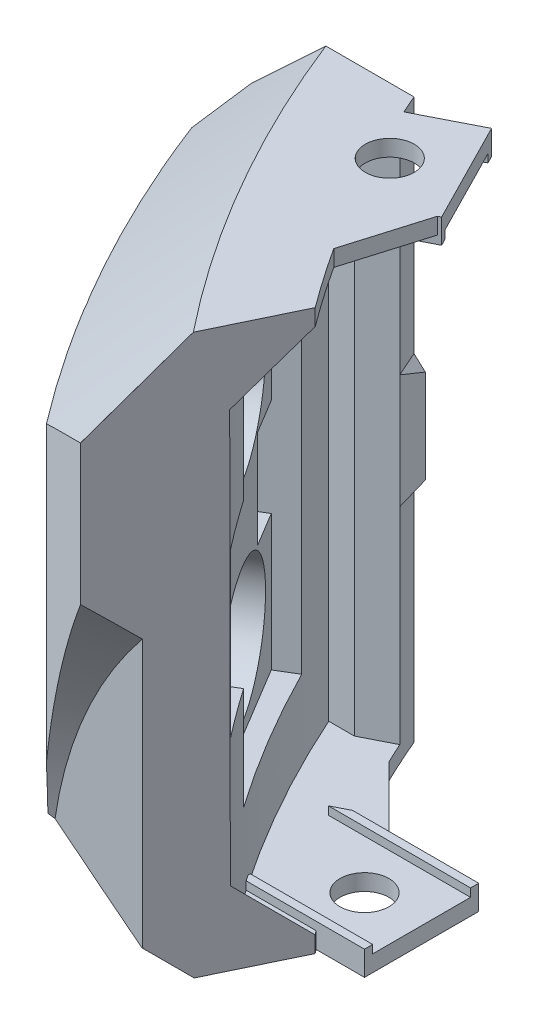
ISO-10303-21;
HEADER;
FILE_DESCRIPTION(('STEP AP214'),'2;1');
FILE_NAME('part.step','',(''),(''),'','','');
FILE_SCHEMA(('AUTOMOTIVE_DESIGN { 1 0 10303 214 1 1 1 1 }'));
ENDSEC;
DATA;
#1=APPLICATION_CONTEXT('core data for automotive mechanical design processes');
#2=APPLICATION_PROTOCOL_DEFINITION('international standard','automotive_design',2000,#1);
#3=PRODUCT_CONTEXT('',#1,'mechanical');
#4=PRODUCT('Part','Part','',(#3));
#5=PRODUCT_RELATED_PRODUCT_CATEGORY('part','',(#4));
#6=PRODUCT_DEFINITION_FORMATION('','',#4);
#7=PRODUCT_DEFINITION_CONTEXT('part definition',#1,'design');
#8=PRODUCT_DEFINITION('design','',#6,#7);
#9=PRODUCT_DEFINITION_SHAPE('','',#8);
#10=(LENGTH_UNIT() NAMED_UNIT(*) SI_UNIT(.MILLI.,.METRE.));
#11=(NAMED_UNIT(*) PLANE_ANGLE_UNIT() SI_UNIT($,.RADIAN.));
#12=(NAMED_UNIT(*) SI_UNIT($,.STERADIAN.) SOLID_ANGLE_UNIT());
#13=UNCERTAINTY_MEASURE_WITH_UNIT(LENGTH_MEASURE(1.E-05),#10,'distance_accuracy_value','');
#14=(GEOMETRIC_REPRESENTATION_CONTEXT(3) GLOBAL_UNCERTAINTY_ASSIGNED_CONTEXT((#13)) GLOBAL_UNIT_ASSIGNED_CONTEXT((#10,
#11,#12)) REPRESENTATION_CONTEXT('',''));
#15=CARTESIAN_POINT('',(0.,0.,0.));
#16=DIRECTION('',(0.,0.,1.));
#17=DIRECTION('',(1.,0.,0.));
#18=AXIS2_PLACEMENT_3D('',#15,#16,#17);
#19=CARTESIAN_POINT('',(0.,0.,0.));
#20=DIRECTION('',(0.,-1.,0.));
#21=DIRECTION('',(0.,0.,-1.));
#22=AXIS2_PLACEMENT_3D('',#19,#20,#21);
#23=CYLINDRICAL_SURFACE('',#22,140.);
#24=DIRECTION('',(0.,-1.,0.));
#25=VECTOR('',#24,1.);
#26=CARTESIAN_POINT('',(-127.363861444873,0.,58.1244079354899));
#27=LINE('',#26,#25);
#28=CARTESIAN_POINT('',(-127.363861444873,-3.,58.1244079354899));
#29=VERTEX_POINT('',#28);
#30=CARTESIAN_POINT('',(-127.363861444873,-27.2500000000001,58.1244079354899));
#31=VERTEX_POINT('',#30);
#32=EDGE_CURVE('E1809',#29,#31,#27,.T.);
#33=ORIENTED_EDGE('',*,*,#32,.T.);
#34=CARTESIAN_POINT('',(0.,-27.2500000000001,0.));
#35=DIRECTION('',(0.,-1.,0.));
#36=DIRECTION('',(0.,0.,-1.));
#37=AXIS2_PLACEMENT_3D('',#34,#35,#36);
#38=CIRCLE('',#37,140.);
#39=CARTESIAN_POINT('',(-128.743931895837,-27.2500000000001,55.));
#40=VERTEX_POINT('',#39);
#41=EDGE_CURVE('E585',#31,#40,#38,.T.);
#42=ORIENTED_EDGE('',*,*,#41,.T.);
#43=DIRECTION('',(0.,-1.,0.));
#44=VECTOR('',#43,1.);
#45=CARTESIAN_POINT('',(-128.743931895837,0.,55.));
#46=LINE('',#45,#44);
#47=CARTESIAN_POINT('',(-128.743931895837,0.,55.));
#48=VERTEX_POINT('',#47);
#49=EDGE_CURVE('E470',#40,#48,#46,.F.);
#50=ORIENTED_EDGE('',*,*,#49,.T.);
#51=CARTESIAN_POINT('',(0.,0.,0.));
#52=DIRECTION('',(0.,-1.,0.));
#53=DIRECTION('',(-0.781956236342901,0.,0.623333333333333));
#54=AXIS2_PLACEMENT_3D('',#51,#52,#53);
#55=CIRCLE('',#54,140.);
#56=CARTESIAN_POINT('',(-127.77622524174,0.,57.212203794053));
#57=VERTEX_POINT('',#56);
#58=EDGE_CURVE('E1648',#57,#48,#55,.T.);
#59=ORIENTED_EDGE('',*,*,#58,.F.);
#60=DIRECTION('',(0.,-1.,0.));
#61=VECTOR('',#60,1.);
#62=CARTESIAN_POINT('',(-127.77622524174,0.,57.212203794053));
#63=LINE('',#62,#61);
#64=CARTESIAN_POINT('',(-127.77622524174,-3.,57.212203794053));
#65=VERTEX_POINT('',#64);
#66=EDGE_CURVE('E1867',#57,#65,#63,.T.);
#67=ORIENTED_EDGE('',*,*,#66,.T.);
#68=CARTESIAN_POINT('',(0.,-3.,0.));
#69=DIRECTION('',(0.,1.,0.));
#70=DIRECTION('',(0.,0.,1.));
#71=AXIS2_PLACEMENT_3D('',#68,#69,#70);
#72=CIRCLE('',#71,140.);
#73=EDGE_CURVE('E1844',#29,#65,#72,.F.);
#74=ORIENTED_EDGE('',*,*,#73,.F.);
#75=EDGE_LOOP('',(#33,#42,#50,#59,#67,#74));
#76=FACE_BOUND('',#75,.T.);
#77=ADVANCED_FACE('F47',(#76),#23,.F.);
#78=CARTESIAN_POINT('',(15.9628656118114,3.58939962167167E-13,-183.138749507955));
#79=DIRECTION('',(-0.900924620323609,-0.00135723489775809,-0.433973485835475));
#80=DIRECTION('',(-0.433973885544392,0.,0.900925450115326));
#81=AXIS2_PLACEMENT_3D('',#78,#79,#80);
#82=PLANE('',#81);
#83=DIRECTION('',(-0.00122276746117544,0.999999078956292,-0.000589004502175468));
#84=VECTOR('',#83,1.);
#85=CARTESIAN_POINT('',(-121.750704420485,-34.2621645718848,102.860399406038));
#86=LINE('',#85,#84);
#87=CARTESIAN_POINT('',(-121.781171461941,-9.3457234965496,102.84572349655));
#88=VERTEX_POINT('',#87);
#89=CARTESIAN_POINT('',(-121.76023387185,-26.4688245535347,102.855809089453));
#90=VERTEX_POINT('',#89);
#91=EDGE_CURVE('E690',#88,#90,#86,.F.);
#92=ORIENTED_EDGE('',*,*,#91,.T.);
#93=CARTESIAN_POINT('',(-126.264945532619,-17.6447087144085,112.179948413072));
#94=CARTESIAN_POINT('',(-125.950323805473,-18.2524164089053,111.528697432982));
#95=CARTESIAN_POINT('',(-125.636009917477,-18.8609702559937,110.878088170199));
#96=CARTESIAN_POINT('',(-125.008082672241,-20.0799985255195,109.578329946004));
#97=CARTESIAN_POINT('',(-124.694469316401,-20.6904729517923,108.929180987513));
#98=CARTESIAN_POINT('',(-123.754851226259,-22.525033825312,106.984280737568));
#99=CARTESIAN_POINT('',(-123.130026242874,-23.7523393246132,105.69098866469));
#100=CARTESIAN_POINT('',(-122.195871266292,-25.6016132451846,103.757475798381));
#101=CARTESIAN_POINT('',(-121.88499533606,-26.2194332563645,103.114032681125));
#102=CARTESIAN_POINT('',(-121.264439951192,-27.4582557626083,101.829640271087));
#103=CARTESIAN_POINT('',(-120.954760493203,-28.0792582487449,101.188690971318));
#104=CARTESIAN_POINT('',(-120.336767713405,-29.3249597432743,99.9096400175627));
#105=CARTESIAN_POINT('',(-120.028454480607,-29.9496589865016,99.2715385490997));
#106=CARTESIAN_POINT('',(-119.413464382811,-31.2033358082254,97.9987460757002));
#107=CARTESIAN_POINT('',(-119.106787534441,-31.8323134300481,97.3640551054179));
#108=CARTESIAN_POINT('',(-118.80105711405,-32.4637345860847,96.7313365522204));
#109=B_SPLINE_CURVE_WITH_KNOTS('',3,(#93,#94,#95,#96,#97,#98,#99,#100,#101,#102,#103,#104,#105,
#106,#107,#108),.UNSPECIFIED.,.F.,.F.,(4,2,2,2,2,2,2,4),(0.,2.83404251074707,5.66809068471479,
11.33580687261,14.1697508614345,17.0036869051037,19.8378049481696,22.6719517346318),.UNSPECIFIED.);
#110=CARTESIAN_POINT('',(-119.293271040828,-31.4508533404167,97.75));
#111=VERTEX_POINT('',#110);
#112=EDGE_CURVE('E694',#90,#111,#109,.T.);
#113=ORIENTED_EDGE('',*,*,#112,.T.);
#114=DIRECTION('',(0.00150648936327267,-0.999998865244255,0.));
#115=VECTOR('',#114,1.);
#116=CARTESIAN_POINT('',(-119.24565460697,-63.0583648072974,97.75));
#117=LINE('',#116,#115);
#118=CARTESIAN_POINT('',(-119.24385941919,-64.2500000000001,97.75));
#119=VERTEX_POINT('',#118);
#120=EDGE_CURVE('E702',#111,#119,#117,.T.);
#121=ORIENTED_EDGE('',*,*,#120,.T.);
#122=DIRECTION('',(-0.323324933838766,0.669126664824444,0.669126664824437));
#123=VECTOR('',#122,1.);
#124=CARTESIAN_POINT('',(-91.9331529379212,-120.769989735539,41.2300102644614));
#125=LINE('',#124,#123);
#126=CARTESIAN_POINT('',(-117.19024081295,-68.5000000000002,93.5));
#127=VERTEX_POINT('',#126);
#128=EDGE_CURVE('E1770',#127,#119,#125,.T.);
#129=ORIENTED_EDGE('',*,*,#128,.F.);
#130=DIRECTION('',(-0.433973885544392,0.,0.900925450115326));
#131=VECTOR('',#130,1.);
#132=CARTESIAN_POINT('',(-67.7782933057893,-68.5000000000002,-9.07870929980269));
#133=LINE('',#132,#131);
#134=CARTESIAN_POINT('',(-112.37326194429,-68.5000000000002,83.5));
#135=VERTEX_POINT('',#134);
#136=EDGE_CURVE('E673',#135,#127,#133,.T.);
#137=ORIENTED_EDGE('',*,*,#136,.F.);
#138=CARTESIAN_POINT('',(0.,-47962.2377691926,0.));
#139=DIRECTION('',(-0.900924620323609,-0.00135723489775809,-0.433973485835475));
#140=DIRECTION('',(0.00122276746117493,-0.999999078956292,0.000589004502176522));
#141=AXIS2_PLACEMENT_3D('',#138,#139,#140);
#142=ELLIPSE('',#141,103150.899104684,140.);
#143=CARTESIAN_POINT('',(-112.375089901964,-66.4999999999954,83.4975399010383));
#144=VERTEX_POINT('',#143);
#145=EDGE_CURVE('E675',#144,#135,#142,.F.);
#146=ORIENTED_EDGE('',*,*,#145,.F.);
#147=DIRECTION('',(0.433973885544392,0.,-0.900925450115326));
#148=VECTOR('',#147,1.);
#149=CARTESIAN_POINT('',(-117.380260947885,-66.5000000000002,93.8882249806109));
#150=LINE('',#149,#148);
#151=CARTESIAN_POINT('',(-112.376274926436,-66.5000000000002,83.5000000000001));
#152=VERTEX_POINT('',#151);
#153=EDGE_CURVE('E722',#152,#144,#150,.T.);
#154=ORIENTED_EDGE('',*,*,#153,.F.);
#155=DIRECTION('',(-0.323324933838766,0.669126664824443,0.669126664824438));
#156=VECTOR('',#155,1.);
#157=CARTESIAN_POINT('',(-90.6512689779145,-111.460283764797,38.5397162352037));
#158=LINE('',#157,#156);
#159=CARTESIAN_POINT('',(-115.758705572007,-59.5000000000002,90.5));
#160=VERTEX_POINT('',#159);
#161=EDGE_CURVE('E1769',#160,#152,#158,.F.);
#162=ORIENTED_EDGE('',*,*,#161,.F.);
#163=DIRECTION('',(0.00150648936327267,-0.999998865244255,0.));
#164=VECTOR('',#163,1.);
#165=CARTESIAN_POINT('',(-115.747615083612,-66.8618016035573,90.5));
#166=LINE('',#165,#164);
#167=CARTESIAN_POINT('',(-115.834783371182,-9.00000000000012,90.5));
#168=VERTEX_POINT('',#167);
#169=EDGE_CURVE('E1767',#168,#160,#166,.T.);
#170=ORIENTED_EDGE('',*,*,#169,.F.);
#171=DIRECTION('',(0.321517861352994,0.669561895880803,-0.669561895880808));
#172=VECTOR('',#171,1.);
#173=CARTESIAN_POINT('',(-87.9854849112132,48.9962462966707,32.5037537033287));
#174=LINE('',#173,#172);
#175=CARTESIAN_POINT('',(-115.566291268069,-8.44086440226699,89.9408644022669));
#176=VERTEX_POINT('',#175);
#177=EDGE_CURVE('E693',#176,#168,#174,.F.);
#178=ORIENTED_EDGE('',*,*,#177,.F.);
#179=CARTESIAN_POINT('',(-112.433875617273,-1.99969692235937,83.4178563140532));
#180=CARTESIAN_POINT('',(-112.718116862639,-2.580650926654,84.0097552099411));
#181=CARTESIAN_POINT('',(-113.002141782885,-3.16216637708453,84.6012067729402));
#182=CARTESIAN_POINT('',(-113.569774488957,-4.3262733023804,85.7832472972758));
#183=CARTESIAN_POINT('',(-113.85338227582,-4.90886477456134,86.3738362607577));
#184=CARTESIAN_POINT('',(-114.420197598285,-6.07507967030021,87.5541864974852));
#185=CARTESIAN_POINT('',(-114.703405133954,-6.65870309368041,88.1439477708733));
#186=CARTESIAN_POINT('',(-115.269435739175,-7.82694170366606,89.3226752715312));
#187=CARTESIAN_POINT('',(-115.552258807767,-8.41155689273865,89.9116414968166));
#188=CARTESIAN_POINT('',(-115.834896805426,-8.99664636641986,90.500225));
#189=B_SPLINE_CURVE_WITH_KNOTS('',3,(#179,#180,#181,#182,#183,#184,#185,#186,#187,#188),
.UNSPECIFIED.,.F.,.F.,(4,2,2,2,4),(0.,2.63017148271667,5.26033641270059,7.89050088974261,
10.5206719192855),.UNSPECIFIED.);
#190=CARTESIAN_POINT('',(-112.434023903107,-1.99999999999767,83.4181651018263));
#191=VERTEX_POINT('',#190);
#192=EDGE_CURVE('E715',#191,#176,#189,.T.);
#193=ORIENTED_EDGE('',*,*,#192,.F.);
#194=CARTESIAN_POINT('',(0.,-47962.2377691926,0.));
#195=DIRECTION('',(-0.900924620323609,-0.00135723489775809,-0.433973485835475));
#196=DIRECTION('',(0.00122276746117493,-0.999999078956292,0.000589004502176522));
#197=AXIS2_PLACEMENT_3D('',#194,#195,#196);
#198=ELLIPSE('',#197,103150.899104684,140.);
#199=CARTESIAN_POINT('',(-112.435850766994,0.,83.4157027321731));
#200=VERTEX_POINT('',#199);
#201=EDGE_CURVE('E676',#200,#191,#198,.F.);
#202=ORIENTED_EDGE('',*,*,#201,.F.);
#203=DIRECTION('',(0.433973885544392,0.,-0.900925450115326));
#204=VECTOR('',#203,1.);
#205=CARTESIAN_POINT('',(-114.724728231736,0.,88.1673894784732));
#206=LINE('',#205,#204);
#207=CARTESIAN_POINT('',(-117.293435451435,0.,93.5));
#208=VERTEX_POINT('',#207);
#209=EDGE_CURVE('E1783',#208,#200,#206,.T.);
#210=ORIENTED_EDGE('',*,*,#209,.F.);
#211=DIRECTION('',(0.321517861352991,0.66956189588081,-0.669561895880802));
#212=VECTOR('',#211,1.);
#213=CARTESIAN_POINT('',(-92.3072162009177,52.0338753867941,41.4661246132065));
#214=LINE('',#213,#212);
#215=EDGE_CURVE('E668',#88,#208,#214,.T.);
#216=ORIENTED_EDGE('',*,*,#215,.F.);
#217=EDGE_LOOP('',(#92,#113,#121,#129,#137,#146,#154,#162,#170,#178,#193,#202,#210,#216));
#218=FACE_BOUND('',#217,.T.);
#219=ADVANCED_FACE('F515',(#218),#82,.F.);
#220=CARTESIAN_POINT('',(-131.433062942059,0.,78.9596399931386));
#221=DIRECTION('',(0.85720562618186,0.,-0.51497428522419));
#222=DIRECTION('',(-0.51497428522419,0.,-0.85720562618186));
#223=AXIS2_PLACEMENT_3D('',#220,#221,#222);
#224=PLANE('',#223);
#225=DIRECTION('',(0.51497428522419,0.,0.85720562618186));
#226=VECTOR('',#225,1.);
#227=CARTESIAN_POINT('',(-131.433062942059,-28.2500000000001,78.9596399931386));
#228=LINE('',#227,#226);
#229=CARTESIAN_POINT('',(-136.947062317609,-28.2500000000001,69.7812568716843));
#230=VERTEX_POINT('',#229);
#231=CARTESIAN_POINT('',(-134.372190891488,-28.2500000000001,74.0672850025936));
#232=VERTEX_POINT('',#231);
#233=EDGE_CURVE('E654',#230,#232,#228,.T.);
#234=ORIENTED_EDGE('',*,*,#233,.T.);
#235=DIRECTION('',(0.,-1.,0.));
#236=VECTOR('',#235,1.);
#237=CARTESIAN_POINT('',(-134.372190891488,0.,74.0672850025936));
#238=LINE('',#237,#236);
#239=CARTESIAN_POINT('',(-134.372190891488,-40.2500000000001,74.0672850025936));
#240=VERTEX_POINT('',#239);
#241=EDGE_CURVE('E1912',#232,#240,#238,.T.);
#242=ORIENTED_EDGE('',*,*,#241,.T.);
#243=DIRECTION('',(0.51497428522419,0.,0.85720562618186));
#244=VECTOR('',#243,1.);
#245=CARTESIAN_POINT('',(-131.433062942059,-40.2500000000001,78.9596399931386));
#246=LINE('',#245,#244);
#247=CARTESIAN_POINT('',(-136.947062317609,-40.2500000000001,69.7812568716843));
#248=VERTEX_POINT('',#247);
#249=EDGE_CURVE('E1915',#248,#240,#246,.T.);
#250=ORIENTED_EDGE('',*,*,#249,.F.);
#251=DIRECTION('',(0.,-1.,0.));
#252=VECTOR('',#251,1.);
#253=CARTESIAN_POINT('',(-136.947062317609,0.,69.7812568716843));
#254=LINE('',#253,#252);
#255=EDGE_CURVE('E1917',#230,#248,#254,.T.);
#256=ORIENTED_EDGE('',*,*,#255,.F.);
#257=EDGE_LOOP('',(#234,#242,#250,#256));
#258=FACE_BOUND('',#257,.T.);
#259=ADVANCED_FACE('F525',(#258),#224,.T.);
#260=CARTESIAN_POINT('',(-134.372190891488,0.,74.0672850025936));
#261=DIRECTION('',(0.51497428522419,0.,0.85720562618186));
#262=DIRECTION('',(0.85720562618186,0.,-0.51497428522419));
#263=AXIS2_PLACEMENT_3D('',#260,#261,#262);
#264=PLANE('',#263);
#265=DIRECTION('',(0.,-1.,0.));
#266=VECTOR('',#265,1.);
#267=CARTESIAN_POINT('',(-130.94336838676,0.,72.0073878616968));
#268=LINE('',#267,#266);
#269=CARTESIAN_POINT('',(-130.94336838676,-28.2500000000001,72.0073878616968));
#270=VERTEX_POINT('',#269);
#271=CARTESIAN_POINT('',(-130.94336838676,-40.2500000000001,72.0073878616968));
#272=VERTEX_POINT('',#271);
#273=EDGE_CURVE('E1991',#270,#272,#268,.T.);
#274=ORIENTED_EDGE('',*,*,#273,.T.);
#275=DIRECTION('',(0.85720562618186,0.,-0.51497428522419));
#276=VECTOR('',#275,1.);
#277=CARTESIAN_POINT('',(-134.372190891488,-40.2500000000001,74.0672850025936));
#278=LINE('',#277,#276);
#279=EDGE_CURVE('E1926',#240,#272,#278,.T.);
#280=ORIENTED_EDGE('',*,*,#279,.F.);
#281=ORIENTED_EDGE('',*,*,#241,.F.);
#282=DIRECTION('',(0.85720562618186,0.,-0.51497428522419));
#283=VECTOR('',#282,1.);
#284=CARTESIAN_POINT('',(-134.372190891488,-28.2500000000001,74.0672850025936));
#285=LINE('',#284,#283);
#286=EDGE_CURVE('E1919',#232,#270,#285,.T.);
#287=ORIENTED_EDGE('',*,*,#286,.T.);
#288=EDGE_LOOP('',(#274,#280,#281,#287));
#289=FACE_BOUND('',#288,.T.);
#290=ADVANCED_FACE('F817',(#289),#264,.F.);
#291=CARTESIAN_POINT('',(-131.433062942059,-40.2500000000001,78.9596399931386));
#292=DIRECTION('',(0.,1.,0.));
#293=DIRECTION('',(0.,0.,1.));
#294=AXIS2_PLACEMENT_3D('',#291,#292,#293);
#295=PLANE('',#294);
#296=DIRECTION('',(0.85720562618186,0.,-0.51497428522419));
#297=VECTOR('',#296,1.);
#298=CARTESIAN_POINT('',(-136.947062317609,-40.2500000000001,69.7812568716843));
#299=LINE('',#298,#297);
#300=CARTESIAN_POINT('',(-133.518239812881,-40.2500000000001,67.7213597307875));
#301=VERTEX_POINT('',#300);
#302=EDGE_CURVE('E1923',#248,#301,#299,.T.);
#303=ORIENTED_EDGE('',*,*,#302,.F.);
#304=ORIENTED_EDGE('',*,*,#249,.T.);
#305=ORIENTED_EDGE('',*,*,#279,.T.);
#306=DIRECTION('',(0.51497428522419,0.,0.85720562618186));
#307=VECTOR('',#306,1.);
#308=CARTESIAN_POINT('',(-128.004240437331,-40.2500000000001,76.8997428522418));
#309=LINE('',#308,#307);
#310=EDGE_CURVE('E2009',#301,#272,#309,.T.);
#311=ORIENTED_EDGE('',*,*,#310,.F.);
#312=EDGE_LOOP('',(#303,#304,#305,#311));
#313=FACE_BOUND('',#312,.T.);
#314=ADVANCED_FACE('F820',(#313),#295,.T.);
#315=CARTESIAN_POINT('',(-131.433062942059,-28.2500000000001,78.9596399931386));
#316=DIRECTION('',(0.,1.,0.));
#317=DIRECTION('',(0.,0.,1.));
#318=AXIS2_PLACEMENT_3D('',#315,#316,#317);
#319=PLANE('',#318);
#320=DIRECTION('',(0.51497428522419,0.,0.85720562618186));
#321=VECTOR('',#320,1.);
#322=CARTESIAN_POINT('',(-128.004240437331,-28.2500000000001,76.8997428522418));
#323=LINE('',#322,#321);
#324=CARTESIAN_POINT('',(-133.518239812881,-28.2500000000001,67.7213597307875));
#325=VERTEX_POINT('',#324);
#326=EDGE_CURVE('E2012',#325,#270,#323,.T.);
#327=ORIENTED_EDGE('',*,*,#326,.T.);
#328=ORIENTED_EDGE('',*,*,#286,.F.);
#329=ORIENTED_EDGE('',*,*,#233,.F.);
#330=DIRECTION('',(0.85720562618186,0.,-0.51497428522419));
#331=VECTOR('',#330,1.);
#332=CARTESIAN_POINT('',(-136.947062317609,-28.2500000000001,69.7812568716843));
#333=LINE('',#332,#331);
#334=EDGE_CURVE('E1920',#230,#325,#333,.T.);
#335=ORIENTED_EDGE('',*,*,#334,.T.);
#336=EDGE_LOOP('',(#327,#328,#329,#335));
#337=FACE_BOUND('',#336,.T.);
#338=ADVANCED_FACE('F823',(#337),#319,.F.);
#339=CARTESIAN_POINT('',(-133.518239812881,0.,67.7213597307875));
#340=DIRECTION('',(0.51497428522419,0.,0.85720562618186));
#341=DIRECTION('',(0.85720562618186,0.,-0.51497428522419));
#342=AXIS2_PLACEMENT_3D('',#339,#340,#341);
#343=PLANE('',#342);
#344=DIRECTION('',(0.,-1.,0.));
#345=VECTOR('',#344,1.);
#346=CARTESIAN_POINT('',(-133.518239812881,0.,67.7213597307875));
#347=LINE('',#346,#345);
#348=CARTESIAN_POINT('',(-133.518239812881,-11.6500000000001,67.7213597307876));
#349=VERTEX_POINT('',#348);
#350=EDGE_CURVE('E1939',#349,#325,#347,.T.);
#351=ORIENTED_EDGE('',*,*,#350,.T.);
#352=ORIENTED_EDGE('',*,*,#334,.F.);
#353=ORIENTED_EDGE('',*,*,#255,.T.);
#354=ORIENTED_EDGE('',*,*,#302,.T.);
#355=CARTESIAN_POINT('',(-133.518239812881,-56.8500000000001,67.7213597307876));
#356=VERTEX_POINT('',#355);
#357=EDGE_CURVE('E1938',#301,#356,#347,.T.);
#358=ORIENTED_EDGE('',*,*,#357,.T.);
#359=DIRECTION('',(0.85720562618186,0.,-0.51497428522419));
#360=VECTOR('',#359,1.);
#361=CARTESIAN_POINT('',(-133.518239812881,-56.8500000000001,67.7213597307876));
#362=LINE('',#361,#360);
#363=CARTESIAN_POINT('',(-131.188509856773,-56.8500000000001,66.3217527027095));
#364=VERTEX_POINT('',#363);
#365=EDGE_CURVE('E890',#356,#364,#362,.T.);
#366=ORIENTED_EDGE('',*,*,#365,.T.);
#367=DIRECTION('',(0.,-1.,0.));
#368=VECTOR('',#367,1.);
#369=CARTESIAN_POINT('',(-131.188509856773,0.,66.3217527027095));
#370=LINE('',#369,#368);
#371=CARTESIAN_POINT('',(-131.188509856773,-11.6500000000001,66.3217527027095));
#372=VERTEX_POINT('',#371);
#373=EDGE_CURVE('E1623',#364,#372,#370,.F.);
#374=ORIENTED_EDGE('',*,*,#373,.T.);
#375=DIRECTION('',(0.85720562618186,0.,-0.51497428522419));
#376=VECTOR('',#375,1.);
#377=CARTESIAN_POINT('',(-133.518239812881,-11.6500000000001,67.7213597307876));
#378=LINE('',#377,#376);
#379=EDGE_CURVE('E1973',#349,#372,#378,.T.);
#380=ORIENTED_EDGE('',*,*,#379,.F.);
#381=EDGE_LOOP('',(#351,#352,#353,#354,#358,#366,#374,#380));
#382=FACE_BOUND('',#381,.T.);
#383=ADVANCED_FACE('F830',(#382),#343,.T.);
#384=CARTESIAN_POINT('',(-128.004240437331,-11.6500000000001,76.8997428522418));
#385=DIRECTION('',(0.,-1.,0.));
#386=DIRECTION('',(0.,0.,-1.));
#387=AXIS2_PLACEMENT_3D('',#384,#385,#386);
#388=PLANE('',#387);
#389=CARTESIAN_POINT('',(0.,-11.6500000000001,0.));
#390=DIRECTION('',(0.,-1.,0.));
#391=DIRECTION('',(0.,0.,-1.));
#392=AXIS2_PLACEMENT_3D('',#389,#390,#391);
#393=CIRCLE('',#392,147.);
#394=CARTESIAN_POINT('',(-120.629090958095,-11.6500000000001,84.009656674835));
#395=VERTEX_POINT('',#394);
#396=EDGE_CURVE('E1994',#372,#395,#393,.F.);
#397=ORIENTED_EDGE('',*,*,#396,.T.);
#398=DIRECTION('',(0.85720562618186,0.,-0.51497428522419));
#399=VECTOR('',#398,1.);
#400=CARTESIAN_POINT('',(-122.909769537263,-11.6500000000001,85.3797956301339));
#401=LINE('',#400,#399);
#402=CARTESIAN_POINT('',(-122.909769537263,-11.6500000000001,85.3797956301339));
#403=VERTEX_POINT('',#402);
#404=EDGE_CURVE('E1971',#403,#395,#401,.T.);
#405=ORIENTED_EDGE('',*,*,#404,.F.);
#406=DIRECTION('',(-0.51497428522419,0.,-0.85720562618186));
#407=VECTOR('',#406,1.);
#408=CARTESIAN_POINT('',(-128.004240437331,-11.6500000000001,76.8997428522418));
#409=LINE('',#408,#407);
#410=EDGE_CURVE('E1942',#403,#349,#409,.T.);
#411=ORIENTED_EDGE('',*,*,#410,.T.);
#412=ORIENTED_EDGE('',*,*,#379,.T.);
#413=EDGE_LOOP('',(#397,#405,#411,#412));
#414=FACE_BOUND('',#413,.T.);
#415=ADVANCED_FACE('F856',(#414),#388,.T.);
#416=CARTESIAN_POINT('',(-122.909769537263,0.,85.3797956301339));
#417=DIRECTION('',(0.51497428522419,0.,0.85720562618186));
#418=DIRECTION('',(0.85720562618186,0.,-0.51497428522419));
#419=AXIS2_PLACEMENT_3D('',#416,#417,#418);
#420=PLANE('',#419);
#421=DIRECTION('',(0.85720562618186,0.,-0.51497428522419));
#422=VECTOR('',#421,1.);
#423=CARTESIAN_POINT('',(-122.909769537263,-24.2500000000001,85.3797956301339));
#424=LINE('',#423,#422);
#425=CARTESIAN_POINT('',(-122.909769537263,-24.2500000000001,85.3797956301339));
#426=VERTEX_POINT('',#425);
#427=CARTESIAN_POINT('',(-120.629090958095,-24.2500000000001,84.009656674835));
#428=VERTEX_POINT('',#427);
#429=EDGE_CURVE('E1968',#426,#428,#424,.T.);
#430=ORIENTED_EDGE('',*,*,#429,.F.);
#431=DIRECTION('',(0.,-1.,0.));
#432=VECTOR('',#431,1.);
#433=CARTESIAN_POINT('',(-122.909769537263,0.,85.3797956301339));
#434=LINE('',#433,#432);
#435=EDGE_CURVE('E1945',#403,#426,#434,.T.);
#436=ORIENTED_EDGE('',*,*,#435,.F.);
#437=ORIENTED_EDGE('',*,*,#404,.T.);
#438=DIRECTION('',(0.,-1.,0.));
#439=VECTOR('',#438,1.);
#440=CARTESIAN_POINT('',(-120.629090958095,0.,84.009656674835));
#441=LINE('',#440,#439);
#442=EDGE_CURVE('E1995',#428,#395,#441,.F.);
#443=ORIENTED_EDGE('',*,*,#442,.F.);
#444=EDGE_LOOP('',(#430,#436,#437,#443));
#445=FACE_BOUND('',#444,.T.);
#446=ADVANCED_FACE('F844',(#445),#420,.F.);
#447=CARTESIAN_POINT('',(-128.004240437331,-24.2500000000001,76.8997428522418));
#448=DIRECTION('',(0.,1.,0.));
#449=DIRECTION('',(0.,0.,1.));
#450=AXIS2_PLACEMENT_3D('',#447,#448,#449);
#451=PLANE('',#450);
#452=DIRECTION('',(0.85720562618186,0.,-0.51497428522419));
#453=VECTOR('',#452,1.);
#454=CARTESIAN_POINT('',(-119.047462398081,-24.2500000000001,91.8088378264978));
#455=LINE('',#454,#453);
#456=CARTESIAN_POINT('',(-119.047462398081,-24.2500000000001,91.8088378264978));
#457=VERTEX_POINT('',#456);
#458=CARTESIAN_POINT('',(-116.167337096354,-24.2500000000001,90.0785756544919));
#459=VERTEX_POINT('',#458);
#460=EDGE_CURVE('E1965',#457,#459,#455,.T.);
#461=ORIENTED_EDGE('',*,*,#460,.F.);
#462=DIRECTION('',(0.51497428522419,0.,0.85720562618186));
#463=VECTOR('',#462,1.);
#464=CARTESIAN_POINT('',(-128.004240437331,-24.2500000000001,76.8997428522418));
#465=LINE('',#464,#463);
#466=EDGE_CURVE('E1948',#426,#457,#465,.T.);
#467=ORIENTED_EDGE('',*,*,#466,.F.);
#468=ORIENTED_EDGE('',*,*,#429,.T.);
#469=CARTESIAN_POINT('',(0.,-24.2500000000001,0.));
#470=DIRECTION('',(0.,1.,0.));
#471=DIRECTION('',(0.,0.,1.));
#472=AXIS2_PLACEMENT_3D('',#469,#470,#471);
#473=CIRCLE('',#472,147.);
#474=EDGE_CURVE('E1999',#459,#428,#473,.F.);
#475=ORIENTED_EDGE('',*,*,#474,.F.);
#476=EDGE_LOOP('',(#461,#467,#468,#475));
#477=FACE_BOUND('',#476,.T.);
#478=ADVANCED_FACE('F851',(#477),#451,.F.);
#479=CARTESIAN_POINT('',(-119.047462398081,0.,91.8088378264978));
#480=DIRECTION('',(0.51497428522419,0.,0.85720562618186));
#481=DIRECTION('',(0.85720562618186,0.,-0.51497428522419));
#482=AXIS2_PLACEMENT_3D('',#479,#480,#481);
#483=PLANE('',#482);
#484=DIRECTION('',(0.85720562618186,0.,-0.51497428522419));
#485=VECTOR('',#484,1.);
#486=CARTESIAN_POINT('',(-119.047462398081,-44.2500000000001,91.8088378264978));
#487=LINE('',#486,#485);
#488=CARTESIAN_POINT('',(-119.047462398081,-44.2500000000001,91.8088378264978));
#489=VERTEX_POINT('',#488);
#490=CARTESIAN_POINT('',(-116.167337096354,-44.2500000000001,90.0785756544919));
#491=VERTEX_POINT('',#490);
#492=EDGE_CURVE('E1962',#489,#491,#487,.T.);
#493=ORIENTED_EDGE('',*,*,#492,.F.);
#494=DIRECTION('',(0.,-1.,0.));
#495=VECTOR('',#494,1.);
#496=CARTESIAN_POINT('',(-119.047462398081,0.,91.8088378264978));
#497=LINE('',#496,#495);
#498=EDGE_CURVE('E1952',#457,#489,#497,.T.);
#499=ORIENTED_EDGE('',*,*,#498,.F.);
#500=ORIENTED_EDGE('',*,*,#460,.T.);
#501=DIRECTION('',(0.,-1.,0.));
#502=VECTOR('',#501,1.);
#503=CARTESIAN_POINT('',(-116.167337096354,0.,90.0785756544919));
#504=LINE('',#503,#502);
#505=EDGE_CURVE('E2002',#491,#459,#504,.F.);
#506=ORIENTED_EDGE('',*,*,#505,.F.);
#507=EDGE_LOOP('',(#493,#499,#500,#506));
#508=FACE_BOUND('',#507,.T.);
#509=ADVANCED_FACE('F847',(#508),#483,.F.);
#510=CARTESIAN_POINT('',(-128.004240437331,-44.2500000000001,76.8997428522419));
#511=DIRECTION('',(0.,1.,0.));
#512=DIRECTION('',(0.,0.,1.));
#513=AXIS2_PLACEMENT_3D('',#510,#511,#512);
#514=PLANE('',#513);
#515=CARTESIAN_POINT('',(0.,-44.2500000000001,0.));
#516=DIRECTION('',(0.,1.,0.));
#517=DIRECTION('',(0.,0.,1.));
#518=AXIS2_PLACEMENT_3D('',#515,#516,#517);
#519=CIRCLE('',#518,147.);
#520=CARTESIAN_POINT('',(-120.629090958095,-44.2500000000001,84.009656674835));
#521=VERTEX_POINT('',#520);
#522=EDGE_CURVE('E2005',#491,#521,#519,.F.);
#523=ORIENTED_EDGE('',*,*,#522,.T.);
#524=DIRECTION('',(0.85720562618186,0.,-0.51497428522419));
#525=VECTOR('',#524,1.);
#526=CARTESIAN_POINT('',(-122.909769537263,-44.2500000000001,85.3797956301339));
#527=LINE('',#526,#525);
#528=CARTESIAN_POINT('',(-122.909769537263,-44.2500000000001,85.3797956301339));
#529=VERTEX_POINT('',#528);
#530=EDGE_CURVE('E1959',#529,#521,#527,.T.);
#531=ORIENTED_EDGE('',*,*,#530,.F.);
#532=DIRECTION('',(0.51497428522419,0.,0.85720562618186));
#533=VECTOR('',#532,1.);
#534=CARTESIAN_POINT('',(-128.004240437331,-44.2500000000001,76.8997428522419));
#535=LINE('',#534,#533);
#536=EDGE_CURVE('E1955',#529,#489,#535,.T.);
#537=ORIENTED_EDGE('',*,*,#536,.T.);
#538=ORIENTED_EDGE('',*,*,#492,.T.);
#539=EDGE_LOOP('',(#523,#531,#537,#538));
#540=FACE_BOUND('',#539,.T.);
#541=ADVANCED_FACE('F842',(#540),#514,.T.);
#542=DIRECTION('',(0.85720562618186,0.,-0.51497428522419));
#543=VECTOR('',#542,1.);
#544=CARTESIAN_POINT('',(-122.909769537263,-56.8500000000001,85.3797956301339));
#545=LINE('',#544,#543);
#546=CARTESIAN_POINT('',(-122.909769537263,-56.8500000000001,85.3797956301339));
#547=VERTEX_POINT('',#546);
#548=CARTESIAN_POINT('',(-120.629090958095,-56.8500000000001,84.009656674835));
#549=VERTEX_POINT('',#548);
#550=EDGE_CURVE('E924',#547,#549,#545,.T.);
#551=ORIENTED_EDGE('',*,*,#550,.F.);
#552=EDGE_CURVE('E1949',#529,#547,#434,.T.);
#553=ORIENTED_EDGE('',*,*,#552,.F.);
#554=ORIENTED_EDGE('',*,*,#530,.T.);
#555=DIRECTION('',(0.,-1.,0.));
#556=VECTOR('',#555,1.);
#557=CARTESIAN_POINT('',(-120.629090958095,0.,84.009656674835));
#558=LINE('',#557,#556);
#559=EDGE_CURVE('E1988',#549,#521,#558,.F.);
#560=ORIENTED_EDGE('',*,*,#559,.F.);
#561=EDGE_LOOP('',(#551,#553,#554,#560));
#562=FACE_BOUND('',#561,.T.);
#563=ADVANCED_FACE('F838',(#562),#420,.F.);
#564=CARTESIAN_POINT('',(-128.004240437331,-56.8500000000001,76.8997428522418));
#565=DIRECTION('',(0.,-1.,0.));
#566=DIRECTION('',(0.,0.,-1.));
#567=AXIS2_PLACEMENT_3D('',#564,#565,#566);
#568=PLANE('',#567);
#569=ORIENTED_EDGE('',*,*,#365,.F.);
#570=DIRECTION('',(-0.51497428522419,0.,-0.85720562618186));
#571=VECTOR('',#570,1.);
#572=CARTESIAN_POINT('',(-128.004240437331,-56.8500000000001,76.8997428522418));
#573=LINE('',#572,#571);
#574=EDGE_CURVE('E1935',#547,#356,#573,.T.);
#575=ORIENTED_EDGE('',*,*,#574,.F.);
#576=ORIENTED_EDGE('',*,*,#550,.T.);
#577=CARTESIAN_POINT('',(0.,-56.8500000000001,0.));
#578=DIRECTION('',(0.,-1.,0.));
#579=DIRECTION('',(0.,0.,-1.));
#580=AXIS2_PLACEMENT_3D('',#577,#578,#579);
#581=CIRCLE('',#580,147.);
#582=EDGE_CURVE('E1989',#364,#549,#581,.F.);
#583=ORIENTED_EDGE('',*,*,#582,.F.);
#584=EDGE_LOOP('',(#569,#575,#576,#583));
#585=FACE_BOUND('',#584,.T.);
#586=ADVANCED_FACE('F841',(#585),#568,.F.);
#587=CARTESIAN_POINT('',(-110.508967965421,-2.,97.198112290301));
#588=DIRECTION('',(0.,1.,0.));
#589=DIRECTION('',(0.,0.,1.));
#590=AXIS2_PLACEMENT_3D('',#587,#588,#589);
#591=PLANE('',#590);
#592=DIRECTION('',(1.,0.,0.));
#593=VECTOR('',#592,1.);
#594=CARTESIAN_POINT('',(-110.508967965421,-2.,60.));
#595=LINE('',#594,#593);
#596=CARTESIAN_POINT('',(-134.19761547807,-2.,60.));
#597=VERTEX_POINT('',#596);
#598=CARTESIAN_POINT('',(-133.250752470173,-2.,60.));
#599=VERTEX_POINT('',#598);
#600=EDGE_CURVE('E2140',#597,#599,#595,.T.);
#601=ORIENTED_EDGE('',*,*,#600,.T.);
#602=DIRECTION('',(-0.891112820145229,0.,0.453781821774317));
#603=VECTOR('',#602,1.);
#604=CARTESIAN_POINT('',(-130.23373980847,-2.,58.4636451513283));
#605=LINE('',#604,#603);
#606=CARTESIAN_POINT('',(-134.021454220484,-2.,60.3924648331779));
#607=VERTEX_POINT('',#606);
#608=EDGE_CURVE('E1821',#599,#607,#605,.T.);
#609=ORIENTED_EDGE('',*,*,#608,.T.);
#610=CARTESIAN_POINT('',(0.,-2.,0.));
#611=DIRECTION('',(0.,-1.,0.));
#612=DIRECTION('',(-0.781956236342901,0.,0.623333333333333));
#613=AXIS2_PLACEMENT_3D('',#610,#611,#612);
#614=CIRCLE('',#613,147.);
#615=EDGE_CURVE('E2032',#607,#597,#614,.T.);
#616=ORIENTED_EDGE('',*,*,#615,.T.);
#617=EDGE_LOOP('',(#601,#609,#616));
#618=FACE_BOUND('',#617,.T.);
#619=ADVANCED_FACE('F865',(#618),#591,.F.);
#620=CARTESIAN_POINT('',(-130.23373980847,-3.,58.4636451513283));
#621=DIRECTION('',(-0.453781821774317,0.,-0.891112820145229));
#622=DIRECTION('',(-0.891112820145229,0.,0.453781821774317));
#623=AXIS2_PLACEMENT_3D('',#620,#621,#622);
#624=PLANE('',#623);
#625=ORIENTED_EDGE('',*,*,#608,.F.);
#626=DIRECTION('',(0.,-1.,0.));
#627=VECTOR('',#626,1.);
#628=CARTESIAN_POINT('',(-133.250752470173,-86.4697623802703,60.));
#629=LINE('',#628,#627);
#630=CARTESIAN_POINT('',(-133.250752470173,-3.,60.));
#631=VERTEX_POINT('',#630);
#632=EDGE_CURVE('E1840',#599,#631,#629,.T.);
#633=ORIENTED_EDGE('',*,*,#632,.T.);
#634=DIRECTION('',(-0.891112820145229,0.,0.453781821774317));
#635=VECTOR('',#634,1.);
#636=CARTESIAN_POINT('',(-130.23373980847,-3.,58.4636451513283));
#637=LINE('',#636,#635);
#638=CARTESIAN_POINT('',(-134.021454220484,-3.,60.3924648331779));
#639=VERTEX_POINT('',#638);
#640=EDGE_CURVE('E1836',#631,#639,#637,.T.);
#641=ORIENTED_EDGE('',*,*,#640,.T.);
#642=DIRECTION('',(0.,1.,0.));
#643=VECTOR('',#642,1.);
#644=CARTESIAN_POINT('',(-134.021454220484,-3.,60.3924648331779));
#645=LINE('',#644,#643);
#646=EDGE_CURVE('E1831',#639,#607,#645,.T.);
#647=ORIENTED_EDGE('',*,*,#646,.T.);
#648=EDGE_LOOP('',(#625,#633,#641,#647));
#649=FACE_BOUND('',#648,.T.);
#650=ADVANCED_FACE('F836',(#649),#624,.T.);
#651=CARTESIAN_POINT('',(-128.004240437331,0.,76.8997428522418));
#652=DIRECTION('',(0.85720562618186,0.,-0.51497428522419));
#653=DIRECTION('',(-0.51497428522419,0.,-0.85720562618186));
#654=AXIS2_PLACEMENT_3D('',#651,#652,#653);
#655=PLANE('',#654);
#656=ORIENTED_EDGE('',*,*,#326,.F.);
#657=ORIENTED_EDGE('',*,*,#350,.F.);
#658=ORIENTED_EDGE('',*,*,#410,.F.);
#659=ORIENTED_EDGE('',*,*,#435,.T.);
#660=ORIENTED_EDGE('',*,*,#466,.T.);
#661=ORIENTED_EDGE('',*,*,#498,.T.);
#662=ORIENTED_EDGE('',*,*,#536,.F.);
#663=ORIENTED_EDGE('',*,*,#552,.T.);
#664=ORIENTED_EDGE('',*,*,#574,.T.);
#665=ORIENTED_EDGE('',*,*,#357,.F.);
#666=ORIENTED_EDGE('',*,*,#310,.T.);
#667=ORIENTED_EDGE('',*,*,#273,.F.);
#668=EDGE_LOOP('',(#656,#657,#658,#659,#660,#661,#662,#663,#664,#665,#666,#667));
#669=FACE_BOUND('',#668,.T.);
#670=CARTESIAN_POINT('',(-128.214004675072,-47.0500000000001,76.5505776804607));
#671=DIRECTION('',(0.85720562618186,0.,-0.51497428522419));
#672=DIRECTION('',(-0.51497428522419,0.,-0.85720562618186));
#673=AXIS2_PLACEMENT_3D('',#670,#671,#672);
#674=CIRCLE('',#673,8.25000000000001);
#675=CARTESIAN_POINT('',(-132.462542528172,-47.0500000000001,69.4786312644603));
#676=VERTEX_POINT('',#675);
#677=EDGE_CURVE('E1922',#676,#676,#674,.T.);
#678=ORIENTED_EDGE('',*,*,#677,.F.);
#679=EDGE_LOOP('',(#678));
#680=FACE_BOUND('',#679,.T.);
#681=CARTESIAN_POINT('',(-128.214004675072,-21.4500000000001,76.5505776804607));
#682=DIRECTION('',(0.85720562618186,0.,-0.51497428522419));
#683=DIRECTION('',(-0.51497428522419,0.,-0.85720562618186));
#684=AXIS2_PLACEMENT_3D('',#681,#682,#683);
#685=CIRCLE('',#684,8.25000000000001);
#686=CARTESIAN_POINT('',(-132.462542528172,-21.4500000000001,69.4786312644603));
#687=VERTEX_POINT('',#686);
#688=EDGE_CURVE('E1932',#687,#687,#685,.T.);
#689=ORIENTED_EDGE('',*,*,#688,.F.);
#690=EDGE_LOOP('',(#689));
#691=FACE_BOUND('',#690,.T.);
#692=ADVANCED_FACE('F832',(#669,#680,#691),#655,.T.);
#693=CARTESIAN_POINT('',(0.,-3.,0.));
#694=DIRECTION('',(0.,1.,0.));
#695=DIRECTION('',(0.,0.,1.));
#696=AXIS2_PLACEMENT_3D('',#693,#694,#695);
#697=PLANE('',#696);
#698=DIRECTION('',(-1.,0.,0.));
#699=VECTOR('',#698,1.);
#700=CARTESIAN_POINT('',(-105.035274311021,-3.,60.));
#701=LINE('',#700,#699);
#702=CARTESIAN_POINT('',(-131.04705026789,-3.,60.));
#703=VERTEX_POINT('',#702);
#704=EDGE_CURVE('E1707',#703,#631,#701,.T.);
#705=ORIENTED_EDGE('',*,*,#704,.F.);
#706=DIRECTION('',(0.891112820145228,0.,-0.453781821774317));
#707=VECTOR('',#706,1.);
#708=CARTESIAN_POINT('',(-129.779957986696,-3.,59.3547579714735));
#709=LINE('',#708,#707);
#710=CARTESIAN_POINT('',(-133.607114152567,-3.,61.3036625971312));
#711=VERTEX_POINT('',#710);
#712=EDGE_CURVE('E1828',#711,#703,#709,.T.);
#713=ORIENTED_EDGE('',*,*,#712,.F.);
#714=CARTESIAN_POINT('',(0.,-3.,0.));
#715=DIRECTION('',(0.,1.,0.));
#716=DIRECTION('',(0.,0.,1.));
#717=AXIS2_PLACEMENT_3D('',#714,#715,#716);
#718=CIRCLE('',#717,147.);
#719=EDGE_CURVE('E1824',#639,#711,#718,.T.);
#720=ORIENTED_EDGE('',*,*,#719,.F.);
#721=ORIENTED_EDGE('',*,*,#640,.F.);
#722=EDGE_LOOP('',(#705,#713,#720,#721));
#723=FACE_BOUND('',#722,.T.);
#724=ADVANCED_FACE('F835',(#723),#697,.F.);
#725=CARTESIAN_POINT('',(-169.687801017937,-47.0500000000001,101.466348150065));
#726=DIRECTION('',(0.85720562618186,0.,-0.51497428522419));
#727=DIRECTION('',(-0.51497428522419,0.,-0.85720562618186));
#728=AXIS2_PLACEMENT_3D('',#725,#726,#727);
#729=CYLINDRICAL_SURFACE('',#728,8.25000000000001);
#730=CARTESIAN_POINT('',(-140.611072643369,-55.2500000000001,82.9402386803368));
#731=CARTESIAN_POINT('',(-140.565617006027,-55.2583399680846,83.0008852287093));
#732=CARTESIAN_POINT('',(-140.520891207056,-55.2656486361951,83.0622213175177));
#733=CARTESIAN_POINT('',(-140.433158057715,-55.2781571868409,83.1859234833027));
#734=CARTESIAN_POINT('',(-140.390144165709,-55.28336597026,83.248284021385));
#735=CARTESIAN_POINT('',(-140.305823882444,-55.2916883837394,83.3740267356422));
#736=CARTESIAN_POINT('',(-140.264512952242,-55.2948079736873,83.4374054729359));
#737=CARTESIAN_POINT('',(-140.183590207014,-55.2989628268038,83.5651777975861));
#738=CARTESIAN_POINT('',(-140.143976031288,-55.3000010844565,83.629569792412));
#739=CARTESIAN_POINT('',(-140.066442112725,-55.2999989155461,83.7593657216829));
#740=CARTESIAN_POINT('',(-140.028522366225,-55.2989584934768,83.82476965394));
#741=CARTESIAN_POINT('',(-139.954376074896,-55.2948001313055,83.9565895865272));
#742=CARTESIAN_POINT('',(-139.918152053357,-55.2916791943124,84.0230069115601));
#743=CARTESIAN_POINT('',(-139.847401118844,-55.2833557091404,84.15685536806));
#744=CARTESIAN_POINT('',(-139.812879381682,-55.2781472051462,84.2242888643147));
#745=CARTESIAN_POINT('',(-139.745539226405,-55.2656416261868,84.3601734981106));
#746=CARTESIAN_POINT('',(-139.712728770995,-55.2583356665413,84.4286277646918));
#747=CARTESIAN_POINT('',(-139.68086983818,-55.2500000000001,84.4973973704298));
#748=B_SPLINE_CURVE_WITH_KNOTS('',3,(#730,#731,#732,#733,#734,#735,#736,#737,#738,#739,#740,
#741,#742,#743,#744,#745,#746,#747),.UNSPECIFIED.,.F.,.F.,(4,2,2,2,2,2,2,2,4),(0.,
0.228731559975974,0.456483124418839,0.683582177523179,0.910354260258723,1.13712585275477,
1.36422480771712,1.59197633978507,1.82070721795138),.UNSPECIFIED.);
#749=CARTESIAN_POINT('',(-140.611072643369,-55.2500000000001,82.9402386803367));
#750=VERTEX_POINT('',#749);
#751=CARTESIAN_POINT('',(-139.68086983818,-55.2500000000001,84.4973973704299));
#752=VERTEX_POINT('',#751);
#753=EDGE_CURVE('E889',#750,#752,#748,.T.);
#754=ORIENTED_EDGE('',*,*,#753,.T.);
#755=CARTESIAN_POINT('',(-139.68086983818,-55.2500000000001,84.4973973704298));
#756=CARTESIAN_POINT('',(-139.561552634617,-55.2245288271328,84.6946468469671));
#757=CARTESIAN_POINT('',(-139.442371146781,-55.1892883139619,84.8907109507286));
#758=CARTESIAN_POINT('',(-139.205173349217,-55.0996315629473,85.2791101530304));
#759=CARTESIAN_POINT('',(-139.087156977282,-55.0452163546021,85.4714454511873));
#760=CARTESIAN_POINT('',(-138.853257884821,-54.9176182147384,85.8509079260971));
#761=CARTESIAN_POINT('',(-138.737373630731,-54.8444493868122,86.0380389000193));
#762=CARTESIAN_POINT('',(-138.508536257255,-54.6798552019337,86.4059529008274));
#763=CARTESIAN_POINT('',(-138.395583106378,-54.5884300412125,86.5867359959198));
#764=CARTESIAN_POINT('',(-138.173436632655,-54.3879284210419,86.9407973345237));
#765=CARTESIAN_POINT('',(-138.064244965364,-54.2788443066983,87.114072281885));
#766=CARTESIAN_POINT('',(-137.850534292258,-54.0438281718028,87.4518615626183));
#767=CARTESIAN_POINT('',(-137.746015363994,-53.9178958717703,87.616375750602));
#768=CARTESIAN_POINT('',(-137.542508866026,-53.6501042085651,87.9355041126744));
#769=CARTESIAN_POINT('',(-137.443520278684,-53.5082477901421,88.0901201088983));
#770=CARTESIAN_POINT('',(-137.251858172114,-53.2095957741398,88.3884524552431));
#771=CARTESIAN_POINT('',(-137.159184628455,-53.0528002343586,88.5321688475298));
#772=CARTESIAN_POINT('',(-136.980859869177,-52.725279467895,88.8078342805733));
#773=CARTESIAN_POINT('',(-136.895213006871,-52.5545457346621,88.9397760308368));
#774=CARTESIAN_POINT('',(-136.731690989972,-52.2003810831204,89.1909650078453));
#775=CARTESIAN_POINT('',(-136.653818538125,-52.0169457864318,89.3102078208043));
#776=CARTESIAN_POINT('',(-136.506538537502,-51.6387374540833,89.535158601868));
#777=CARTESIAN_POINT('',(-136.437130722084,-51.4439647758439,89.6408669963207));
#778=CARTESIAN_POINT('',(-136.307367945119,-51.0444550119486,89.8380619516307));
#779=CARTESIAN_POINT('',(-136.247013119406,-50.8397177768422,89.9295482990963));
#780=CARTESIAN_POINT('',(-136.135873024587,-50.4217197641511,90.0977052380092));
#781=CARTESIAN_POINT('',(-136.085088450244,-50.2084583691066,90.1743747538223));
#782=CARTESIAN_POINT('',(-135.993534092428,-49.7749366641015,90.3123908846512));
#783=CARTESIAN_POINT('',(-135.952764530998,-49.5546761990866,90.3737371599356));
#784=CARTESIAN_POINT('',(-135.881607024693,-49.108784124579,90.480691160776));
#785=CARTESIAN_POINT('',(-135.851216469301,-48.8831538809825,90.5263028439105));
#786=CARTESIAN_POINT('',(-135.801061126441,-48.427995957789,90.6015250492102));
#787=CARTESIAN_POINT('',(-135.781300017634,-48.1984669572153,90.6311300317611));
#788=CARTESIAN_POINT('',(-135.75261052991,-47.7374889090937,90.6740971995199));
#789=CARTESIAN_POINT('',(-135.743669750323,-47.5060423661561,90.6874779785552));
#790=CARTESIAN_POINT('',(-135.736658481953,-47.0426128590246,90.6979717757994));
#791=CARTESIAN_POINT('',(-135.738588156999,-46.8106298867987,90.6950845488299));
#792=CARTESIAN_POINT('',(-135.753301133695,-46.347782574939,90.6730605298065));
#793=CARTESIAN_POINT('',(-135.766084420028,-46.1169182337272,90.6539237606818));
#794=CARTESIAN_POINT('',(-135.802392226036,-45.6579454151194,90.5995244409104));
#795=CARTESIAN_POINT('',(-135.825916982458,-45.4298369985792,90.5642615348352));
#796=CARTESIAN_POINT('',(-135.883480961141,-44.9781592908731,90.4778689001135));
#797=CARTESIAN_POINT('',(-135.91751292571,-44.7545869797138,90.4267501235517));
#798=CARTESIAN_POINT('',(-135.995812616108,-44.3133293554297,90.3089494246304));
#799=CARTESIAN_POINT('',(-136.040083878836,-44.0956461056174,90.2422621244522));
#800=CARTESIAN_POINT('',(-136.138461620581,-43.6678301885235,90.0937813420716));
#801=CARTESIAN_POINT('',(-136.192566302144,-43.4576961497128,90.0119906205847));
#802=CARTESIAN_POINT('',(-136.310150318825,-43.0464216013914,89.8338259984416));
#803=CARTESIAN_POINT('',(-136.373629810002,-42.8452812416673,89.7374518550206));
#804=CARTESIAN_POINT('',(-136.509472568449,-42.453268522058,89.5306696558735));
#805=CARTESIAN_POINT('',(-136.581842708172,-42.2624042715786,89.4202507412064));
#806=CARTESIAN_POINT('',(-136.734815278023,-41.892460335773,89.1861587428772));
#807=CARTESIAN_POINT('',(-136.815417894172,-41.7133809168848,89.0624853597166));
#808=CARTESIAN_POINT('',(-136.984162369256,-41.368310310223,88.8027232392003));
#809=CARTESIAN_POINT('',(-137.07230288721,-41.2023168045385,88.6666367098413));
#810=CARTESIAN_POINT('',(-137.255435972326,-40.8845032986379,88.3828799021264));
#811=CARTESIAN_POINT('',(-137.350430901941,-40.7326882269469,88.2352056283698));
#812=CARTESIAN_POINT('',(-137.546527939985,-40.4442835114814,87.9292015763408));
#813=CARTESIAN_POINT('',(-137.647633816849,-40.3077034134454,87.770865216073));
#814=CARTESIAN_POINT('',(-137.855081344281,-40.050846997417,87.4446787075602));
#815=CARTESIAN_POINT('',(-137.961423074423,-39.9305709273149,87.2768284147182));
#816=CARTESIAN_POINT('',(-138.178488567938,-39.7071841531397,86.9327543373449));
#817=CARTESIAN_POINT('',(-138.289212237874,-39.6040730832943,86.7565307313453));
#818=CARTESIAN_POINT('',(-138.514174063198,-39.415746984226,86.3969036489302));
#819=CARTESIAN_POINT('',(-138.628412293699,-39.3305323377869,86.213500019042));
#820=CARTESIAN_POINT('',(-138.859434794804,-39.1786638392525,85.8409065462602));
#821=CARTESIAN_POINT('',(-138.976217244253,-39.1119971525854,85.6517208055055));
#822=CARTESIAN_POINT('',(-139.211556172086,-38.9976029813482,85.2686854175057));
#823=CARTESIAN_POINT('',(-139.330113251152,-38.9498820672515,85.0748341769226));
#824=CARTESIAN_POINT('',(-139.568052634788,-38.8737611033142,84.6839213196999));
#825=CARTESIAN_POINT('',(-139.687434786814,-38.8453575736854,84.4868602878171));
#826=CARTESIAN_POINT('',(-139.926168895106,-38.8080608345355,84.0908820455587));
#827=CARTESIAN_POINT('',(-140.045520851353,-38.7991676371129,83.8919648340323));
#828=CARTESIAN_POINT('',(-140.283208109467,-38.800953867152,83.4939006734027));
#829=CARTESIAN_POINT('',(-140.401544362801,-38.8116123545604,83.2947541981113));
#830=CARTESIAN_POINT('',(-140.636500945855,-38.8523845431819,82.8974358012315));
#831=CARTESIAN_POINT('',(-140.753121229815,-38.8824987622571,82.6992639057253));
#832=CARTESIAN_POINT('',(-140.983841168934,-38.9619666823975,82.3053251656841));
#833=CARTESIAN_POINT('',(-141.097940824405,-39.0113203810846,82.1095583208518));
#834=CARTESIAN_POINT('',(-141.322850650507,-39.1289121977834,81.7218517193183));
#835=CARTESIAN_POINT('',(-141.433660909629,-39.1971498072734,81.5299118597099));
#836=CARTESIAN_POINT('',(-141.651279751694,-39.3520299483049,81.1512329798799));
#837=CARTESIAN_POINT('',(-141.758087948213,-39.4386742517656,80.9644944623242));
#838=CARTESIAN_POINT('',(-141.967008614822,-39.6297461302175,80.5976051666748));
#839=CARTESIAN_POINT('',(-142.069121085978,-39.7341737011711,80.4174543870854));
#840=CARTESIAN_POINT('',(-142.268031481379,-39.9600898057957,80.0650353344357));
#841=CARTESIAN_POINT('',(-142.364828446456,-40.0815814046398,79.8927684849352));
#842=CARTESIAN_POINT('',(-142.552466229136,-40.3407040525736,79.5574856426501));
#843=CARTESIAN_POINT('',(-142.643309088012,-40.4783295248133,79.3944664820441));
#844=CARTESIAN_POINT('',(-142.818653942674,-40.7689753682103,79.0786145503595));
#845=CARTESIAN_POINT('',(-142.9031472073,-40.9220162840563,78.9257958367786));
#846=CARTESIAN_POINT('',(-143.065162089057,-41.2422490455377,78.6317357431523));
#847=CARTESIAN_POINT('',(-143.142683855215,-41.4094405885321,78.4904941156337));
#848=CARTESIAN_POINT('',(-143.290317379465,-41.7567965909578,78.2206475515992));
#849=CARTESIAN_POINT('',(-143.360428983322,-41.9369613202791,78.0920428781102));
#850=CARTESIAN_POINT('',(-143.492846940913,-42.3089813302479,77.8484516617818));
#851=CARTESIAN_POINT('',(-143.555153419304,-42.5008364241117,77.7334649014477));
#852=CARTESIAN_POINT('',(-143.671657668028,-42.8950090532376,77.5179144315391));
#853=CARTESIAN_POINT('',(-143.725850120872,-43.0973333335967,77.4173601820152));
#854=CARTESIAN_POINT('',(-143.82576601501,-43.510820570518,77.2315691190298));
#855=CARTESIAN_POINT('',(-143.87149238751,-43.7219804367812,77.1463270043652));
#856=CARTESIAN_POINT('',(-143.95426192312,-44.1517442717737,76.9917610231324));
#857=CARTESIAN_POINT('',(-143.991303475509,-44.3703496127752,76.9224401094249));
#858=CARTESIAN_POINT('',(-144.056495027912,-44.8134066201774,76.8002760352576));
#859=CARTESIAN_POINT('',(-144.084645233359,-45.037858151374,76.7474324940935));
#860=CARTESIAN_POINT('',(-144.13188400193,-45.4907933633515,76.6586756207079));
#861=CARTESIAN_POINT('',(-144.15098132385,-45.7192729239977,76.6227459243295));
#862=CARTESIAN_POINT('',(-144.180054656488,-46.1788457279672,76.5680214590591));
#863=CARTESIAN_POINT('',(-144.190030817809,-46.4099389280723,76.5492264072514));
#864=CARTESIAN_POINT('',(-144.200811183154,-46.8731325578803,76.5289154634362));
#865=CARTESIAN_POINT('',(-144.201613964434,-47.1052331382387,76.5274022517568));
#866=CARTESIAN_POINT('',(-144.194041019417,-47.5686712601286,76.5416712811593));
#867=CARTESIAN_POINT('',(-144.185668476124,-47.8000090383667,76.5574475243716));
#868=CARTESIAN_POINT('',(-144.159804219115,-48.2601656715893,76.6061426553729));
#869=CARTESIAN_POINT('',(-144.142320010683,-48.4889864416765,76.6390474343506));
#870=CARTESIAN_POINT('',(-144.098328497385,-48.9426715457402,76.7217343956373));
#871=CARTESIAN_POINT('',(-144.071821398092,-49.1675359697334,76.7715161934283));
#872=CARTESIAN_POINT('',(-144.009920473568,-49.61173567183,76.8875756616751));
#873=CARTESIAN_POINT('',(-143.97452593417,-49.8310705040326,76.9538546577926));
#874=CARTESIAN_POINT('',(-143.895038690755,-50.2626341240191,77.1023928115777));
#875=CARTESIAN_POINT('',(-143.850946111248,-50.4748630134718,77.1846517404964));
#876=CARTESIAN_POINT('',(-143.75426190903,-50.890868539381,77.3645833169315));
#877=CARTESIAN_POINT('',(-143.701664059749,-51.0946388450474,77.4622672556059));
#878=CARTESIAN_POINT('',(-143.588296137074,-51.4920496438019,77.6722196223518));
#879=CARTESIAN_POINT('',(-143.527528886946,-51.6856936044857,77.7844830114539));
#880=CARTESIAN_POINT('',(-143.39813742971,-52.0615680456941,78.0227709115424));
#881=CARTESIAN_POINT('',(-143.329512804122,-52.2437979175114,78.1487961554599));
#882=CARTESIAN_POINT('',(-143.184792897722,-52.5955405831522,78.4136442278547));
#883=CARTESIAN_POINT('',(-143.108697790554,-52.7650536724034,78.552466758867));
#884=CARTESIAN_POINT('',(-142.949366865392,-53.0903731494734,78.842046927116));
#885=CARTESIAN_POINT('',(-142.866122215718,-53.2461620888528,78.9928193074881));
#886=CARTESIAN_POINT('',(-142.693059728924,-53.5426871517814,79.3050122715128));
#887=CARTESIAN_POINT('',(-142.603241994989,-53.6834235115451,79.4664326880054));
#888=CARTESIAN_POINT('',(-142.417533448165,-53.9488924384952,79.7987746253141));
#889=CARTESIAN_POINT('',(-142.321640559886,-54.0736194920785,79.9696993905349));
#890=CARTESIAN_POINT('',(-142.124429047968,-54.3060820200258,80.3196634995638));
#891=CARTESIAN_POINT('',(-142.023112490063,-54.4138239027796,80.4986997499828));
#892=CARTESIAN_POINT('',(-141.81788357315,-54.6094767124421,80.8596967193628));
#893=CARTESIAN_POINT('',(-141.71407381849,-54.6977641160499,81.0415118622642));
#894=CARTESIAN_POINT('',(-141.502467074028,-54.8567868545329,81.4104204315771));
#895=CARTESIAN_POINT('',(-141.394670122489,-54.9275223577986,81.5975138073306));
#896=CARTESIAN_POINT('',(-141.175700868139,-55.0509834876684,81.975774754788));
#897=CARTESIAN_POINT('',(-141.064526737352,-55.103699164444,82.1669445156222));
#898=CARTESIAN_POINT('',(-140.839572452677,-55.1907337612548,82.5519377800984));
#899=CARTESIAN_POINT('',(-140.725792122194,-55.2250514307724,82.7457614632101));
#900=CARTESIAN_POINT('',(-140.611072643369,-55.2500000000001,82.9402386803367));
#901=B_SPLINE_CURVE_WITH_KNOTS('',3,(#755,#756,#757,#758,#759,#760,#761,#762,#763,#764,#765,
#766,#767,#768,#769,#770,#771,#772,#773,#774,#775,#776,#777,#778,#779,#780,#781,#782,#783,#784,
#785,#786,#787,#788,#789,#790,#791,#792,#793,#794,#795,#796,#797,#798,#799,#800,#801,#802,#803,
#804,#805,#806,#807,#808,#809,#810,#811,#812,#813,#814,#815,#816,#817,#818,#819,#820,#821,#822,
#823,#824,#825,#826,#827,#828,#829,#830,#831,#832,#833,#834,#835,#836,#837,#838,#839,#840,#841,
#842,#843,#844,#845,#846,#847,#848,#849,#850,#851,#852,#853,#854,#855,#856,#857,#858,#859,#860,
#861,#862,#863,#864,#865,#866,#867,#868,#869,#870,#871,#872,#873,#874,#875,#876,#877,#878,#879,
#880,#881,#882,#883,#884,#885,#886,#887,#888,#889,#890,#891,#892,#893,#894,#895,#896,#897,#898,
#899,#900),.UNSPECIFIED.,.F.,.F.,(4,2,2,2,2,2,2,2,2,2,2,2,2,2,2,2,2,2,2,2,2,2,2,2,2,2,2,2,2,2,2,
2,2,2,2,2,2,2,2,2,2,2,2,2,2,2,2,2,2,2,2,2,2,2,2,2,2,2,2,2,2,2,2,2,2,2,2,2,2,2,2,2,4),(0.,
0.695584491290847,1.39113164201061,2.08615723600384,2.78117535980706,3.47649557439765,
4.17182732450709,4.86703070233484,5.56223139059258,6.25785958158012,6.95372876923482,
7.64957603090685,8.34543373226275,9.04134193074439,9.73726555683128,10.4330140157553,
11.1290031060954,11.8241937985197,12.5193949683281,13.2145951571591,13.9098106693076,
14.6045470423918,15.2995237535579,15.9943735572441,16.6892349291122,17.3846368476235,
18.0800544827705,18.7753486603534,19.4708836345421,20.1668519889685,20.8628309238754,
21.5587950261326,22.2547740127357,22.9502702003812,23.6460073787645,24.3416191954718,
25.0372314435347,25.7320991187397,26.4269852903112,27.1218713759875,27.8167387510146,
28.511673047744,29.2066071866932,29.9016663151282,30.5964858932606,31.2922440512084,
31.9879873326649,32.6837450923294,33.3794917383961,34.0756923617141,34.7716514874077,
35.4677395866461,36.1638116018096,36.8592087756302,37.5545944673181,38.2500880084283,
38.9453403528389,39.6400209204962,40.334685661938,41.0294062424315,41.724116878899,
42.4193384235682,43.1143203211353,43.8093392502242,44.5043420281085,45.2002160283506,
45.8960791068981,46.5921812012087,47.2880200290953,47.9689022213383,48.6497778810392,
49.3310288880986,50.0123261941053),.UNSPECIFIED.);
#902=EDGE_CURVE('E918',#752,#750,#901,.T.);
#903=ORIENTED_EDGE('',*,*,#902,.T.);
#904=EDGE_LOOP('',(#754,#903));
#905=FACE_BOUND('',#904,.T.);
#906=ORIENTED_EDGE('',*,*,#677,.T.);
#907=EDGE_LOOP('',(#906));
#908=FACE_BOUND('',#907,.T.);
#909=ADVANCED_FACE('F930',(#905,#908),#729,.F.);
#910=CARTESIAN_POINT('',(-80.5034354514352,-63.0000000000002,97.7500000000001));
#911=DIRECTION('',(0.,0.,1.));
#912=DIRECTION('',(1.,0.,0.));
#913=AXIS2_PLACEMENT_3D('',#910,#911,#912);
#914=CONICAL_SURFACE('',#913,50.,0.785398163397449);
#915=ORIENTED_EDGE('',*,*,#112,.F.);
#916=CARTESIAN_POINT('',(-33.4737093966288,-63.0000000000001,145.383241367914));
#917=DIRECTION('',(0.433973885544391,0.,-0.900925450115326));
#918=DIRECTION('',(0.900925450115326,0.,0.433973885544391));
#919=AXIS2_PLACEMENT_3D('',#916,#917,#918);
#920=ELLIPSE('',#919,108.369944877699,85.5596557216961);
#921=CARTESIAN_POINT('',(-129.829670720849,-49.2055889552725,98.9687784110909));
#922=VERTEX_POINT('',#921);
#923=EDGE_CURVE('E1620',#922,#90,#920,.T.);
#924=ORIENTED_EDGE('',*,*,#923,.F.);
#925=CARTESIAN_POINT('',(-130.387585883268,-55.2500000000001,98.2325808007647));
#926=CARTESIAN_POINT('',(-130.370784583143,-54.9965883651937,98.2548816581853));
#927=CARTESIAN_POINT('',(-130.35316650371,-54.7433254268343,98.2782549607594));
#928=CARTESIAN_POINT('',(-130.316309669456,-54.2372063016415,98.3271216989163));
#929=CARTESIAN_POINT('',(-130.29707144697,-53.9843500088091,98.3526144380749));
#930=CARTESIAN_POINT('',(-130.256980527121,-53.4790421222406,98.4057041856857));
#931=CARTESIAN_POINT('',(-130.236128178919,-53.226590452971,98.4333007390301));
#932=CARTESIAN_POINT('',(-130.192815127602,-52.7220895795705,98.4905816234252));
#933=CARTESIAN_POINT('',(-130.170354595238,-52.470040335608,98.5202657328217));
#934=CARTESIAN_POINT('',(-130.123831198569,-51.9663438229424,98.5817048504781));
#935=CARTESIAN_POINT('',(-130.099768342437,-51.7146965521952,98.6134598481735));
#936=CARTESIAN_POINT('',(-130.050045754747,-51.2117993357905,98.6790240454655));
#937=CARTESIAN_POINT('',(-130.024385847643,-50.9605494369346,98.7128334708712));
#938=CARTESIAN_POINT('',(-129.971474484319,-50.4584440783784,98.7824895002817));
#939=CARTESIAN_POINT('',(-129.944222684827,-50.2075887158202,98.8183365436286));
#940=CARTESIAN_POINT('',(-129.888132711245,-49.7062693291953,98.89205034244));
#941=CARTESIAN_POINT('',(-129.859294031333,-49.4558054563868,98.9299177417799));
#942=CARTESIAN_POINT('',(-129.829670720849,-49.2055889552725,98.968778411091));
#943=B_SPLINE_CURVE_WITH_KNOTS('',3,(#925,#926,#927,#928,#929,#930,#931,#932,#933,#934,#935,
#936,#937,#938,#939,#940,#941,#942),.UNSPECIFIED.,.F.,.F.,(4,2,2,2,2,2,2,2,4),(0.,
0.764831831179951,1.52941333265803,2.29382990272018,3.05816543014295,3.82249705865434,
4.58691284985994,5.35149409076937,6.11632047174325),.UNSPECIFIED.);
#944=CARTESIAN_POINT('',(-130.387585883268,-55.2500000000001,98.2325808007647));
#945=VERTEX_POINT('',#944);
#946=EDGE_CURVE('E1614',#945,#922,#943,.T.);
#947=ORIENTED_EDGE('',*,*,#946,.F.);
#948=CARTESIAN_POINT('',(-129.990633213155,-55.8573633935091,97.7500000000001));
#949=CARTESIAN_POINT('',(-130.057033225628,-55.7561006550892,97.8301870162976));
#950=CARTESIAN_POINT('',(-130.123312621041,-55.6548556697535,97.9104955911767));
#951=CARTESIAN_POINT('',(-130.255630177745,-55.4524012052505,98.0713558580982));
#952=CARTESIAN_POINT('',(-130.321668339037,-55.3511917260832,98.1519075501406));
#953=CARTESIAN_POINT('',(-130.387585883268,-55.2500000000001,98.2325808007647));
#954=B_SPLINE_CURVE_WITH_KNOTS('',3,(#948,#949,#950,#951,#952,#953),.UNSPECIFIED.,.F.,.F.,(4,2,
4),(0.,0.435702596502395,0.871405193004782),.UNSPECIFIED.);
#955=CARTESIAN_POINT('',(-129.990633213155,-55.8573633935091,97.75));
#956=VERTEX_POINT('',#955);
#957=EDGE_CURVE('E990',#956,#945,#954,.T.);
#958=ORIENTED_EDGE('',*,*,#957,.F.);
#959=CARTESIAN_POINT('',(-80.5034354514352,-63.0000000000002,97.75));
#960=DIRECTION('',(0.,0.,1.));
#961=DIRECTION('',(1.,0.,0.));
#962=AXIS2_PLACEMENT_3D('',#959,#960,#961);
#963=CIRCLE('',#962,50.);
#964=EDGE_CURVE('E686',#111,#956,#963,.T.);
#965=ORIENTED_EDGE('',*,*,#964,.F.);
#966=EDGE_LOOP('',(#915,#924,#947,#958,#965));
#967=FACE_BOUND('',#966,.T.);
#968=ADVANCED_FACE('F705',(#967),#914,.F.);
#969=CARTESIAN_POINT('',(-80.5034354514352,-63.0000000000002,97.75));
#970=DIRECTION('',(0.,0.,1.));
#971=DIRECTION('',(1.,0.,0.));
#972=AXIS2_PLACEMENT_3D('',#969,#970,#971);
#973=PLANE('',#972);
#974=ORIENTED_EDGE('',*,*,#120,.F.);
#975=ORIENTED_EDGE('',*,*,#964,.T.);
#976=CARTESIAN_POINT('',(-130.749760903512,-55.2500000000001,97.7499999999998));
#977=CARTESIAN_POINT('',(-130.298501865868,-55.6114209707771,97.7499999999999));
#978=CARTESIAN_POINT('',(-129.846915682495,-55.9724335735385,97.75));
#979=CARTESIAN_POINT('',(-128.943076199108,-56.6936182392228,97.7500000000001));
#980=CARTESIAN_POINT('',(-128.490822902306,-57.0537903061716,97.75));
#981=CARTESIAN_POINT('',(-127.585633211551,-57.7732726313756,97.75));
#982=CARTESIAN_POINT('',(-127.132696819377,-58.1325828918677,97.75));
#983=CARTESIAN_POINT('',(-126.226127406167,-58.8503178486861,97.75));
#984=CARTESIAN_POINT('',(-125.772494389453,-59.2087425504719,97.75));
#985=CARTESIAN_POINT('',(-125.091507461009,-59.7456982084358,97.75));
#986=CARTESIAN_POINT('',(-124.864422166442,-59.9245699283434,97.75));
#987=CARTESIAN_POINT('',(-124.410071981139,-60.2820850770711,97.75));
#988=CARTESIAN_POINT('',(-124.182807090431,-60.4607285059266,97.75));
#989=CARTESIAN_POINT('',(-123.728089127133,-60.8177764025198,97.75));
#990=CARTESIAN_POINT('',(-123.500636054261,-60.996180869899,97.75));
#991=CARTESIAN_POINT('',(-123.159326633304,-61.2636219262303,97.75));
#992=CARTESIAN_POINT('',(-123.045535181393,-61.3527413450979,97.75));
#993=CARTESIAN_POINT('',(-122.817896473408,-61.5309088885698,97.75));
#994=CARTESIAN_POINT('',(-122.704049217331,-61.6199570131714,97.75));
#995=CARTESIAN_POINT('',(-122.362480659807,-61.8870882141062,97.75));
#996=CARTESIAN_POINT('',(-122.134742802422,-62.0651501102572,97.75));
#997=CARTESIAN_POINT('',(-121.679278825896,-62.4212888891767,97.75));
#998=CARTESIAN_POINT('',(-121.451552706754,-62.5993657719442,97.75));
#999=CARTESIAN_POINT('',(-120.99609747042,-62.9555155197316,97.75));
#1000=CARTESIAN_POINT('',(-120.768368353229,-63.1335883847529,97.75));
#1001=CARTESIAN_POINT('',(-120.312910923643,-63.4897351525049,97.75));
#1002=CARTESIAN_POINT('',(-120.085182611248,-63.6678090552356,97.75));
#1003=CARTESIAN_POINT('',(-119.401997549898,-64.2020304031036,97.75));
#1004=CARTESIAN_POINT('',(-118.946540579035,-64.5581775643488,97.75));
#1005=CARTESIAN_POINT('',(-118.035622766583,-65.2704752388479,97.75));
#1006=CARTESIAN_POINT('',(-117.580161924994,-65.6266257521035,97.75));
#1007=CARTESIAN_POINT('',(-116.669240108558,-66.3389268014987,97.75));
#1008=CARTESIAN_POINT('',(-116.21377913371,-66.6950773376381,97.75));
#1009=CARTESIAN_POINT('',(-115.302856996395,-67.4073785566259,97.75));
#1010=CARTESIAN_POINT('',(-114.847395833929,-67.7635292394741,97.75));
#1011=CARTESIAN_POINT('',(-114.391934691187,-68.1196799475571,97.75));
#1012=B_SPLINE_CURVE_WITH_KNOTS('',3,(#976,#977,#978,#979,#980,#981,#982,#983,#984,#985,#986,
#987,#988,#989,#990,#991,#992,#993,#994,#995,#996,#997,#998,#999,#1000,#1001,#1002,#1003,#1004,
#1005,#1006,#1007,#1008,#1009,#1010,#1011),.UNSPECIFIED.,.F.,.F.,(4,2,2,2,2,2,2,2,2,2,2,2,2,2,2,
2,2,4),(0.,1.7344561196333,3.46890391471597,5.2033472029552,6.9377797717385,7.80499670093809,
8.67221349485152,9.53943158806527,9.97304070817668,10.4066498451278,11.2739071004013,
12.1411642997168,13.0084211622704,13.8756780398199,15.6101914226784,17.3447201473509,
19.0792492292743,20.8137790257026),.UNSPECIFIED.);
#1013=CARTESIAN_POINT('',(-119.340651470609,-64.2500000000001,97.75));
#1014=VERTEX_POINT('',#1013);
#1015=EDGE_CURVE('E681',#956,#1014,#1012,.T.);
#1016=ORIENTED_EDGE('',*,*,#1015,.T.);
#1017=DIRECTION('',(1.,0.,0.));
#1018=VECTOR('',#1017,1.);
#1019=CARTESIAN_POINT('',(124.414182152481,-64.2500000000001,97.75));
#1020=LINE('',#1019,#1018);
#1021=EDGE_CURVE('E688',#1014,#119,#1020,.T.);
#1022=ORIENTED_EDGE('',*,*,#1021,.T.);
#1023=EDGE_LOOP('',(#974,#975,#1016,#1022));
#1024=FACE_BOUND('',#1023,.T.);
#1025=ADVANCED_FACE('F940',(#1024),#973,.T.);
#1026=CARTESIAN_POINT('',(124.414182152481,-68.5000000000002,93.5));
#1027=DIRECTION('',(0.,0.707106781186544,-0.707106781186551));
#1028=DIRECTION('',(0.,0.707106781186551,0.707106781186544));
#1029=AXIS2_PLACEMENT_3D('',#1026,#1027,#1028);
#1030=PLANE('',#1029);
#1031=DIRECTION('',(-1.,0.,0.));
#1032=VECTOR('',#1031,1.);
#1033=CARTESIAN_POINT('',(124.414182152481,-68.5000000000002,93.5));
#1034=LINE('',#1033,#1032);
#1035=CARTESIAN_POINT('',(-117.293435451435,-68.5000000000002,93.5));
#1036=VERTEX_POINT('',#1035);
#1037=EDGE_CURVE('E677',#127,#1036,#1034,.T.);
#1038=ORIENTED_EDGE('',*,*,#1037,.F.);
#1039=ORIENTED_EDGE('',*,*,#128,.T.);
#1040=ORIENTED_EDGE('',*,*,#1021,.F.);
#1041=CARTESIAN_POINT('',(-123.675932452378,-55.2500000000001,106.75));
#1042=CARTESIAN_POINT('',(-123.144057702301,-56.354166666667,105.645833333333));
#1043=CARTESIAN_POINT('',(-122.612182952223,-57.4583333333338,104.541666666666));
#1044=CARTESIAN_POINT('',(-121.282496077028,-60.2187500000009,101.781249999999));
#1045=CARTESIAN_POINT('',(-120.484683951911,-61.8750000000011,100.124999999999));
#1046=CARTESIAN_POINT('',(-118.889059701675,-65.187500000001,96.8124999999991));
#1047=CARTESIAN_POINT('',(-118.091247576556,-66.8437500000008,95.1562499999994));
#1048=CARTESIAN_POINT('',(-117.293435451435,-68.5000000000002,93.5));
#1049=B_SPLINE_CURVE_WITH_KNOTS('',3,(#1041,#1042,#1043,#1044,#1045,#1046,#1047,#1048),
.UNSPECIFIED.,.F.,.F.,(4,2,2,4),(0.,4.94887151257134,12.3721787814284,19.7954860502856),.UNSPECIFIED.);
#1050=EDGE_CURVE('E1649',#1014,#1036,#1049,.T.);
#1051=ORIENTED_EDGE('',*,*,#1050,.T.);
#1052=EDGE_LOOP('',(#1038,#1039,#1040,#1051));
#1053=FACE_BOUND('',#1052,.T.);
#1054=ADVANCED_FACE('F944',(#1053),#1030,.F.);
#1055=CARTESIAN_POINT('',(-110.508967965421,-66.5000000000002,97.198112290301));
#1056=DIRECTION('',(0.,-1.,0.));
#1057=DIRECTION('',(0.,0.,-1.));
#1058=AXIS2_PLACEMENT_3D('',#1055,#1056,#1057);
#1059=PLANE('',#1058);
#1060=DIRECTION('',(-1.,0.,0.));
#1061=VECTOR('',#1060,1.);
#1062=CARTESIAN_POINT('',(124.414182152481,-66.5000000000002,83.5000000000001));
#1063=LINE('',#1062,#1061);
#1064=CARTESIAN_POINT('',(-120.982436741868,-66.5000000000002,83.5000000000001));
#1065=VERTEX_POINT('',#1064);
#1066=EDGE_CURVE('E1730',#1065,#152,#1063,.F.);
#1067=ORIENTED_EDGE('',*,*,#1066,.T.);
#1068=ORIENTED_EDGE('',*,*,#153,.T.);
#1069=CARTESIAN_POINT('',(0.,-66.5000000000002,0.));
#1070=DIRECTION('',(0.,-1.,0.));
#1071=DIRECTION('',(-0.781956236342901,0.,0.623333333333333));
#1072=AXIS2_PLACEMENT_3D('',#1069,#1070,#1071);
#1073=CIRCLE('',#1072,140.);
#1074=CARTESIAN_POINT('',(-112.743070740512,-66.5000000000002,83.));
#1075=VERTEX_POINT('',#1074);
#1076=EDGE_CURVE('E1776',#144,#1075,#1073,.T.);
#1077=ORIENTED_EDGE('',*,*,#1076,.T.);
#1078=DIRECTION('',(1.,0.,0.));
#1079=VECTOR('',#1078,1.);
#1080=CARTESIAN_POINT('',(0.,-66.5000000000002,83.));
#1081=LINE('',#1080,#1079);
#1082=CARTESIAN_POINT('',(-121.326007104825,-66.5000000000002,83.));
#1083=VERTEX_POINT('',#1082);
#1084=EDGE_CURVE('E643',#1083,#1075,#1081,.T.);
#1085=ORIENTED_EDGE('',*,*,#1084,.F.);
#1086=CARTESIAN_POINT('',(0.,-66.5000000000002,0.));
#1087=DIRECTION('',(0.,-1.,0.));
#1088=DIRECTION('',(-0.781956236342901,0.,0.623333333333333));
#1089=AXIS2_PLACEMENT_3D('',#1086,#1087,#1088);
#1090=CIRCLE('',#1089,147.);
#1091=EDGE_CURVE('E1787',#1065,#1083,#1090,.T.);
#1092=ORIENTED_EDGE('',*,*,#1091,.F.);
#1093=EDGE_LOOP('',(#1067,#1068,#1077,#1085,#1092));
#1094=FACE_BOUND('',#1093,.T.);
#1095=ADVANCED_FACE('F1190',(#1094),#1059,.F.);
#1096=CARTESIAN_POINT('',(0.,-65.5000000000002,0.));
#1097=DIRECTION('',(0.,1.,0.));
#1098=DIRECTION('',(0.,0.,1.));
#1099=AXIS2_PLACEMENT_3D('',#1096,#1097,#1098);
#1100=PLANE('',#1099);
#1101=DIRECTION('',(1.,0.,0.));
#1102=VECTOR('',#1101,1.);
#1103=CARTESIAN_POINT('',(0.,-65.5000000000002,83.));
#1104=LINE('',#1103,#1102);
#1105=CARTESIAN_POINT('',(-121.326007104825,-65.5000000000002,83.));
#1106=VERTEX_POINT('',#1105);
#1107=CARTESIAN_POINT('',(-106.815434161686,-65.5000000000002,83.));
#1108=VERTEX_POINT('',#1107);
#1109=EDGE_CURVE('E644',#1106,#1108,#1104,.T.);
#1110=ORIENTED_EDGE('',*,*,#1109,.T.);
#1111=DIRECTION('',(0.,0.,-1.));
#1112=VECTOR('',#1111,1.);
#1113=CARTESIAN_POINT('',(-106.815434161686,-65.5000000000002,0.));
#1114=LINE('',#1113,#1112);
#1115=CARTESIAN_POINT('',(-106.815434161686,-65.5000000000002,82.));
#1116=VERTEX_POINT('',#1115);
#1117=EDGE_CURVE('E2053',#1108,#1116,#1114,.T.);
#1118=ORIENTED_EDGE('',*,*,#1117,.T.);
#1119=DIRECTION('',(1.,0.,0.));
#1120=VECTOR('',#1119,1.);
#1121=CARTESIAN_POINT('',(0.,-65.5000000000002,82.));
#1122=LINE('',#1121,#1120);
#1123=CARTESIAN_POINT('',(-121.815434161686,-65.5000000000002,82.));
#1124=VERTEX_POINT('',#1123);
#1125=EDGE_CURVE('E640',#1124,#1116,#1122,.T.);
#1126=ORIENTED_EDGE('',*,*,#1125,.F.);
#1127=DIRECTION('',(0.,0.,1.));
#1128=VECTOR('',#1127,1.);
#1129=CARTESIAN_POINT('',(-121.81543416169,-65.5000000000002,6.03739302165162E-12));
#1130=LINE('',#1129,#1128);
#1131=CARTESIAN_POINT('',(-121.815434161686,-65.5000000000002,82.2800097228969));
#1132=VERTEX_POINT('',#1131);
#1133=EDGE_CURVE('E642',#1124,#1132,#1130,.T.);
#1134=ORIENTED_EDGE('',*,*,#1133,.T.);
#1135=CARTESIAN_POINT('',(0.,-65.5000000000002,0.));
#1136=DIRECTION('',(0.,1.,0.));
#1137=DIRECTION('',(0.,0.,1.));
#1138=AXIS2_PLACEMENT_3D('',#1135,#1136,#1137);
#1139=CIRCLE('',#1138,147.);
#1140=EDGE_CURVE('E2016',#1106,#1132,#1139,.F.);
#1141=ORIENTED_EDGE('',*,*,#1140,.F.);
#1142=EDGE_LOOP('',(#1110,#1118,#1126,#1134,#1141));
#1143=FACE_BOUND('',#1142,.T.);
#1144=ADVANCED_FACE('F712',(#1143),#1100,.T.);
#1145=CARTESIAN_POINT('',(0.,-65.5000000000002,0.));
#1146=DIRECTION('',(0.,1.,0.));
#1147=DIRECTION('',(0.,0.,1.));
#1148=AXIS2_PLACEMENT_3D('',#1145,#1146,#1147);
#1149=PLANE('',#1148);
#1150=DIRECTION('',(0.891112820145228,0.,-0.453781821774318));
#1151=VECTOR('',#1150,1.);
#1152=CARTESIAN_POINT('',(2.72269093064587,-65.5000000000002,5.3466769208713));
#1153=LINE('',#1152,#1151);
#1154=CARTESIAN_POINT('',(-124.240096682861,-65.5000000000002,70.));
#1155=VERTEX_POINT('',#1154);
#1156=CARTESIAN_POINT('',(-122.276349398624,-65.5000000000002,69.));
#1157=VERTEX_POINT('',#1156);
#1158=EDGE_CURVE('E1811',#1155,#1157,#1153,.T.);
#1159=ORIENTED_EDGE('',*,*,#1158,.F.);
#1160=DIRECTION('',(-1.,0.,0.));
#1161=VECTOR('',#1160,1.);
#1162=CARTESIAN_POINT('',(0.,-65.5000000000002,70.));
#1163=LINE('',#1162,#1161);
#1164=CARTESIAN_POINT('',(-106.815434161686,-65.5000000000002,70.));
#1165=VERTEX_POINT('',#1164);
#1166=EDGE_CURVE('E1892',#1165,#1155,#1163,.T.);
#1167=ORIENTED_EDGE('',*,*,#1166,.F.);
#1168=DIRECTION('',(0.,0.,-1.));
#1169=VECTOR('',#1168,1.);
#1170=CARTESIAN_POINT('',(-106.815434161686,-65.5000000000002,0.));
#1171=LINE('',#1170,#1169);
#1172=CARTESIAN_POINT('',(-106.815434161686,-65.5000000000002,69.));
#1173=VERTEX_POINT('',#1172);
#1174=EDGE_CURVE('E1896',#1165,#1173,#1171,.T.);
#1175=ORIENTED_EDGE('',*,*,#1174,.T.);
#1176=DIRECTION('',(-1.,0.,0.));
#1177=VECTOR('',#1176,1.);
#1178=CARTESIAN_POINT('',(-1.19929606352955E-13,-65.5000000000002,69.0000000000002));
#1179=LINE('',#1178,#1177);
#1180=EDGE_CURVE('E1889',#1173,#1157,#1179,.T.);
#1181=ORIENTED_EDGE('',*,*,#1180,.T.);
#1182=EDGE_LOOP('',(#1159,#1167,#1175,#1181));
#1183=FACE_BOUND('',#1182,.T.);
#1184=ADVANCED_FACE('F801',(#1183),#1149,.T.);
#1185=CARTESIAN_POINT('',(-121.81543416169,-65.5000000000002,6.03739302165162E-12));
#1186=DIRECTION('',(1.,0.,0.));
#1187=DIRECTION('',(0.,0.,-1.));
#1188=AXIS2_PLACEMENT_3D('',#1185,#1186,#1187);
#1189=PLANE('',#1188);
#1190=DIRECTION('',(0.,0.,1.));
#1191=VECTOR('',#1190,1.);
#1192=CARTESIAN_POINT('',(-121.81543416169,-66.5000000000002,6.03739302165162E-12));
#1193=LINE('',#1192,#1191);
#1194=CARTESIAN_POINT('',(-121.815434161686,-66.5000000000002,82.));
#1195=VERTEX_POINT('',#1194);
#1196=CARTESIAN_POINT('',(-121.815434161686,-66.5000000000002,82.2800097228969));
#1197=VERTEX_POINT('',#1196);
#1198=EDGE_CURVE('E638',#1195,#1197,#1193,.T.);
#1199=ORIENTED_EDGE('',*,*,#1198,.T.);
#1200=DIRECTION('',(0.,-1.,0.));
#1201=VECTOR('',#1200,1.);
#1202=CARTESIAN_POINT('',(-121.815434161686,0.,82.2800097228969));
#1203=LINE('',#1202,#1201);
#1204=EDGE_CURVE('E1885',#1197,#1132,#1203,.F.);
#1205=ORIENTED_EDGE('',*,*,#1204,.T.);
#1206=ORIENTED_EDGE('',*,*,#1133,.F.);
#1207=DIRECTION('',(0.,-1.,0.));
#1208=VECTOR('',#1207,1.);
#1209=CARTESIAN_POINT('',(-121.815434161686,-65.5000000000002,82.));
#1210=LINE('',#1209,#1208);
#1211=EDGE_CURVE('E646',#1124,#1195,#1210,.T.);
#1212=ORIENTED_EDGE('',*,*,#1211,.T.);
#1213=EDGE_LOOP('',(#1199,#1205,#1206,#1212));
#1214=FACE_BOUND('',#1213,.T.);
#1215=ADVANCED_FACE('F797',(#1214),#1189,.F.);
#1216=CARTESIAN_POINT('',(0.,0.,0.));
#1217=DIRECTION('',(0.,-1.,0.));
#1218=DIRECTION('',(0.,0.,-1.));
#1219=AXIS2_PLACEMENT_3D('',#1216,#1217,#1218);
#1220=CYLINDRICAL_SURFACE('',#1219,147.);
#1221=ORIENTED_EDGE('',*,*,#582,.T.);
#1222=ORIENTED_EDGE('',*,*,#559,.T.);
#1223=ORIENTED_EDGE('',*,*,#522,.F.);
#1224=ORIENTED_EDGE('',*,*,#505,.T.);
#1225=ORIENTED_EDGE('',*,*,#474,.T.);
#1226=ORIENTED_EDGE('',*,*,#442,.T.);
#1227=ORIENTED_EDGE('',*,*,#396,.F.);
#1228=ORIENTED_EDGE('',*,*,#373,.F.);
#1229=EDGE_LOOP('',(#1221,#1222,#1223,#1224,#1225,#1226,#1227,#1228));
#1230=FACE_BOUND('',#1229,.T.);
#1231=DIRECTION('',(0.,-1.,0.));
#1232=VECTOR('',#1231,1.);
#1233=CARTESIAN_POINT('',(-115.839328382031,0.,90.5));
#1234=LINE('',#1233,#1232);
#1235=CARTESIAN_POINT('',(-115.839328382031,-9.00000000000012,90.5));
#1236=VERTEX_POINT('',#1235);
#1237=CARTESIAN_POINT('',(-115.839328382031,-59.5000000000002,90.5));
#1238=VERTEX_POINT('',#1237);
#1239=EDGE_CURVE('E666',#1236,#1238,#1234,.T.);
#1240=ORIENTED_EDGE('',*,*,#1239,.T.);
#1241=CARTESIAN_POINT('',(0.,-150.000000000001,0.));
#1242=DIRECTION('',(0.,0.707106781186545,-0.70710678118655));
#1243=DIRECTION('',(0.,-0.70710678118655,-0.707106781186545));
#1244=AXIS2_PLACEMENT_3D('',#1241,#1242,#1243);
#1245=ELLIPSE('',#1244,207.889393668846,147.);
#1246=EDGE_CURVE('E1728',#1238,#1065,#1245,.F.);
#1247=ORIENTED_EDGE('',*,*,#1246,.T.);
#1248=ORIENTED_EDGE('',*,*,#1091,.T.);
#1249=DIRECTION('',(0.,-1.,0.));
#1250=VECTOR('',#1249,1.);
#1251=CARTESIAN_POINT('',(-121.326007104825,0.,83.));
#1252=LINE('',#1251,#1250);
#1253=EDGE_CURVE('E1882',#1106,#1083,#1252,.T.);
#1254=ORIENTED_EDGE('',*,*,#1253,.F.);
#1255=ORIENTED_EDGE('',*,*,#1140,.T.);
#1256=ORIENTED_EDGE('',*,*,#1204,.F.);
#1257=CARTESIAN_POINT('',(-134.19761547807,-66.5000000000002,60.));
#1258=VERTEX_POINT('',#1257);
#1259=EDGE_CURVE('E1786',#1197,#1258,#1090,.T.);
#1260=ORIENTED_EDGE('',*,*,#1259,.T.);
#1261=DIRECTION('',(0.,-1.,0.));
#1262=VECTOR('',#1261,1.);
#1263=CARTESIAN_POINT('',(-134.19761547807,0.,60.));
#1264=LINE('',#1263,#1262);
#1265=EDGE_CURVE('E2138',#1258,#597,#1264,.F.);
#1266=ORIENTED_EDGE('',*,*,#1265,.T.);
#1267=ORIENTED_EDGE('',*,*,#615,.F.);
#1268=ORIENTED_EDGE('',*,*,#646,.F.);
#1269=ORIENTED_EDGE('',*,*,#719,.T.);
#1270=DIRECTION('',(0.,1.,0.));
#1271=VECTOR('',#1270,1.);
#1272=CARTESIAN_POINT('',(-133.607114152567,-3.,61.3036625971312));
#1273=LINE('',#1272,#1271);
#1274=CARTESIAN_POINT('',(-133.607114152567,-2.,61.3036625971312));
#1275=VERTEX_POINT('',#1274);
#1276=EDGE_CURVE('E1837',#711,#1275,#1273,.T.);
#1277=ORIENTED_EDGE('',*,*,#1276,.T.);
#1278=CARTESIAN_POINT('',(-128.161732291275,-2.,71.9970164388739));
#1279=VERTEX_POINT('',#1278);
#1280=EDGE_CURVE('E667',#1279,#1275,#614,.T.);
#1281=ORIENTED_EDGE('',*,*,#1280,.F.);
#1282=DIRECTION('',(0.,1.,0.));
#1283=VECTOR('',#1282,1.);
#1284=CARTESIAN_POINT('',(-128.161732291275,-3.,71.9970164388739));
#1285=LINE('',#1284,#1283);
#1286=CARTESIAN_POINT('',(-128.161732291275,-9.00000000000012,71.9970164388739));
#1287=VERTEX_POINT('',#1286);
#1288=EDGE_CURVE('E1759',#1287,#1279,#1285,.T.);
#1289=ORIENTED_EDGE('',*,*,#1288,.F.);
#1290=CARTESIAN_POINT('',(0.,-9.00000000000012,0.));
#1291=DIRECTION('',(0.,1.,0.));
#1292=DIRECTION('',(0.,0.,1.));
#1293=AXIS2_PLACEMENT_3D('',#1290,#1291,#1292);
#1294=CIRCLE('',#1293,147.);
#1295=EDGE_CURVE('E657',#1287,#1236,#1294,.T.);
#1296=ORIENTED_EDGE('',*,*,#1295,.T.);
#1297=EDGE_LOOP('',(#1240,#1247,#1248,#1254,#1255,#1256,#1260,#1266,#1267,#1268,#1269,#1277,
#1281,#1289,#1296));
#1298=FACE_BOUND('',#1297,.T.);
#1299=ADVANCED_FACE('F800',(#1230,#1298),#1220,.F.);
#1300=CARTESIAN_POINT('',(-105.035274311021,-86.4697623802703,60.));
#1301=DIRECTION('',(0.,0.,1.));
#1302=DIRECTION('',(1.,0.,0.));
#1303=AXIS2_PLACEMENT_3D('',#1300,#1301,#1302);
#1304=PLANE('',#1303);
#1305=DIRECTION('',(0.,-1.,0.));
#1306=VECTOR('',#1305,1.);
#1307=CARTESIAN_POINT('',(-131.04705026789,-86.4697623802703,60.));
#1308=LINE('',#1307,#1306);
#1309=CARTESIAN_POINT('',(-131.04705026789,-66.5000000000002,60.));
#1310=VERTEX_POINT('',#1309);
#1311=EDGE_CURVE('E1802',#703,#1310,#1308,.T.);
#1312=ORIENTED_EDGE('',*,*,#1311,.F.);
#1313=ORIENTED_EDGE('',*,*,#704,.T.);
#1314=ORIENTED_EDGE('',*,*,#632,.F.);
#1315=ORIENTED_EDGE('',*,*,#600,.F.);
#1316=ORIENTED_EDGE('',*,*,#1265,.F.);
#1317=DIRECTION('',(-1.,0.,0.));
#1318=VECTOR('',#1317,1.);
#1319=CARTESIAN_POINT('',(-110.508967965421,-66.5000000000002,60.));
#1320=LINE('',#1319,#1318);
#1321=EDGE_CURVE('E689',#1310,#1258,#1320,.T.);
#1322=ORIENTED_EDGE('',*,*,#1321,.F.);
#1323=EDGE_LOOP('',(#1312,#1313,#1314,#1315,#1316,#1322));
#1324=FACE_BOUND('',#1323,.T.);
#1325=ADVANCED_FACE('F935',(#1324),#1304,.T.);
#1326=CARTESIAN_POINT('',(-172.274637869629,-2.,94.4606531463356));
#1327=DIRECTION('',(0.453781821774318,0.,0.891112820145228));
#1328=DIRECTION('',(0.891112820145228,0.,-0.453781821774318));
#1329=AXIS2_PLACEMENT_3D('',#1326,#1327,#1328);
#1330=PLANE('',#1329);
#1331=DIRECTION('',(0.,-1.,0.));
#1332=VECTOR('',#1331,1.);
#1333=CARTESIAN_POINT('',(-122.276349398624,-68.5000000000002,69.));
#1334=LINE('',#1333,#1332);
#1335=CARTESIAN_POINT('',(-122.276349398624,-66.5000000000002,69.));
#1336=VERTEX_POINT('',#1335);
#1337=EDGE_CURVE('E1815',#1157,#1336,#1334,.T.);
#1338=ORIENTED_EDGE('',*,*,#1337,.T.);
#1339=DIRECTION('',(0.891112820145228,0.,-0.453781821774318));
#1340=VECTOR('',#1339,1.);
#1341=CARTESIAN_POINT('',(-172.274637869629,-66.5000000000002,94.4606531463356));
#1342=LINE('',#1341,#1340);
#1343=CARTESIAN_POINT('',(-124.240096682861,-66.5000000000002,70.));
#1344=VERTEX_POINT('',#1343);
#1345=EDGE_CURVE('E1798',#1344,#1336,#1342,.T.);
#1346=ORIENTED_EDGE('',*,*,#1345,.F.);
#1347=DIRECTION('',(0.,1.,0.));
#1348=VECTOR('',#1347,1.);
#1349=CARTESIAN_POINT('',(-124.240096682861,-65.5000000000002,70.));
#1350=LINE('',#1349,#1348);
#1351=EDGE_CURVE('E1813',#1344,#1155,#1350,.T.);
#1352=ORIENTED_EDGE('',*,*,#1351,.T.);
#1353=ORIENTED_EDGE('',*,*,#1158,.T.);
#1354=EDGE_LOOP('',(#1338,#1346,#1352,#1353));
#1355=FACE_BOUND('',#1354,.T.);
#1356=ADVANCED_FACE('F810',(#1355),#1330,.F.);
#1357=CARTESIAN_POINT('',(0.,-65.5000000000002,70.));
#1358=DIRECTION('',(0.,0.,1.));
#1359=DIRECTION('',(1.,0.,0.));
#1360=AXIS2_PLACEMENT_3D('',#1357,#1358,#1359);
#1361=PLANE('',#1360);
#1362=ORIENTED_EDGE('',*,*,#1351,.F.);
#1363=DIRECTION('',(-1.,0.,0.));
#1364=VECTOR('',#1363,1.);
#1365=CARTESIAN_POINT('',(0.,-66.5000000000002,70.));
#1366=LINE('',#1365,#1364);
#1367=CARTESIAN_POINT('',(-106.815434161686,-66.5000000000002,70.));
#1368=VERTEX_POINT('',#1367);
#1369=EDGE_CURVE('E1893',#1368,#1344,#1366,.T.);
#1370=ORIENTED_EDGE('',*,*,#1369,.F.);
#1371=DIRECTION('',(0.,-1.,0.));
#1372=VECTOR('',#1371,1.);
#1373=CARTESIAN_POINT('',(-106.815434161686,-65.5000000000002,70.));
#1374=LINE('',#1373,#1372);
#1375=EDGE_CURVE('E1899',#1165,#1368,#1374,.T.);
#1376=ORIENTED_EDGE('',*,*,#1375,.F.);
#1377=ORIENTED_EDGE('',*,*,#1166,.T.);
#1378=EDGE_LOOP('',(#1362,#1370,#1376,#1377));
#1379=FACE_BOUND('',#1378,.T.);
#1380=ADVANCED_FACE('F806',(#1379),#1361,.T.);
#1381=CARTESIAN_POINT('',(0.,-65.5000000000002,82.));
#1382=DIRECTION('',(0.,0.,-1.));
#1383=DIRECTION('',(-1.,0.,0.));
#1384=AXIS2_PLACEMENT_3D('',#1381,#1382,#1383);
#1385=PLANE('',#1384);
#1386=ORIENTED_EDGE('',*,*,#1125,.T.);
#1387=DIRECTION('',(0.,-1.,0.));
#1388=VECTOR('',#1387,1.);
#1389=CARTESIAN_POINT('',(-106.815434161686,-65.5000000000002,82.));
#1390=LINE('',#1389,#1388);
#1391=CARTESIAN_POINT('',(-106.815434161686,-66.5000000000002,82.));
#1392=VERTEX_POINT('',#1391);
#1393=EDGE_CURVE('E2073',#1116,#1392,#1390,.T.);
#1394=ORIENTED_EDGE('',*,*,#1393,.T.);
#1395=DIRECTION('',(1.,0.,0.));
#1396=VECTOR('',#1395,1.);
#1397=CARTESIAN_POINT('',(0.,-66.5000000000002,82.));
#1398=LINE('',#1397,#1396);
#1399=EDGE_CURVE('E635',#1195,#1392,#1398,.T.);
#1400=ORIENTED_EDGE('',*,*,#1399,.F.);
#1401=ORIENTED_EDGE('',*,*,#1211,.F.);
#1402=EDGE_LOOP('',(#1386,#1394,#1400,#1401));
#1403=FACE_BOUND('',#1402,.T.);
#1404=ADVANCED_FACE('F809',(#1403),#1385,.T.);
#1405=CARTESIAN_POINT('',(-163.260025,-34.2500000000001,57.5));
#1406=DIRECTION('',(0.,-0.447213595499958,0.894427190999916));
#1407=DIRECTION('',(0.,-0.894427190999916,-0.447213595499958));
#1408=AXIS2_PLACEMENT_3D('',#1405,#1406,#1407);
#1409=PLANE('',#1408);
#1410=DIRECTION('',(1.,0.,0.));
#1411=VECTOR('',#1410,1.);
#1412=CARTESIAN_POINT('',(-163.260025,-39.2500000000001,55.));
#1413=LINE('',#1412,#1411);
#1414=CARTESIAN_POINT('',(-148.706082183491,-39.2500000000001,55.));
#1415=VERTEX_POINT('',#1414);
#1416=CARTESIAN_POINT('',(-128.743930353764,-39.2499927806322,55.000003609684));
#1417=VERTEX_POINT('',#1416);
#1418=EDGE_CURVE('E602',#1415,#1417,#1413,.T.);
#1419=ORIENTED_EDGE('',*,*,#1418,.F.);
#1420=DIRECTION('',(0.408248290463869,-0.816496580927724,-0.408248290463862));
#1421=VECTOR('',#1420,1.);
#1422=CARTESIAN_POINT('',(-155.921426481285,-24.8193114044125,62.2153442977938));
#1423=LINE('',#1422,#1421);
#1424=CARTESIAN_POINT('',(-151.206082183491,-34.2500000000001,57.5));
#1425=VERTEX_POINT('',#1424);
#1426=EDGE_CURVE('E2118',#1415,#1425,#1423,.F.);
#1427=ORIENTED_EDGE('',*,*,#1426,.T.);
#1428=DIRECTION('',(1.,0.,0.));
#1429=VECTOR('',#1428,1.);
#1430=CARTESIAN_POINT('',(-163.260025,-34.2500000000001,57.5));
#1431=LINE('',#1430,#1429);
#1432=CARTESIAN_POINT('',(-127.646974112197,-34.2500000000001,57.5));
#1433=VERTEX_POINT('',#1432);
#1434=EDGE_CURVE('E469',#1425,#1433,#1431,.T.);
#1435=ORIENTED_EDGE('',*,*,#1434,.T.);
#1436=CARTESIAN_POINT('',(0.,-149.25,0.));
#1437=DIRECTION('',(0.,-0.447213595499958,0.894427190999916));
#1438=DIRECTION('',(0.,0.894427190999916,0.447213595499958));
#1439=AXIS2_PLACEMENT_3D('',#1436,#1437,#1438);
#1440=ELLIPSE('',#1439,313.049516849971,140.);
#1441=EDGE_CURVE('E477',#1433,#1417,#1440,.T.);
#1442=ORIENTED_EDGE('',*,*,#1441,.T.);
#1443=EDGE_LOOP('',(#1419,#1427,#1435,#1442));
#1444=FACE_BOUND('',#1443,.T.);
#1445=ADVANCED_FACE('F1015',(#1444),#1409,.F.);
#1446=CARTESIAN_POINT('',(-113.815434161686,-66.5000000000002,76.));
#1447=DIRECTION('',(0.,1.,0.));
#1448=DIRECTION('',(0.,0.,1.));
#1449=AXIS2_PLACEMENT_3D('',#1446,#1447,#1448);
#1450=CIRCLE('',#1449,3.00000000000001);
#1451=CARTESIAN_POINT('',(-113.815434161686,-66.5000000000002,79.));
#1452=VERTEX_POINT('',#1451);
#1453=EDGE_CURVE('E639',#1452,#1452,#1450,.F.);
#1454=ORIENTED_EDGE('',*,*,#1453,.T.);
#1455=EDGE_LOOP('',(#1454));
#1456=FACE_BOUND('',#1455,.T.);
#1457=ORIENTED_EDGE('',*,*,#1399,.T.);
#1458=DIRECTION('',(0.,0.,-1.));
#1459=VECTOR('',#1458,1.);
#1460=CARTESIAN_POINT('',(-106.815434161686,-66.5000000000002,83.));
#1461=LINE('',#1460,#1459);
#1462=EDGE_CURVE('E652',#1392,#1368,#1461,.T.);
#1463=ORIENTED_EDGE('',*,*,#1462,.T.);
#1464=ORIENTED_EDGE('',*,*,#1369,.T.);
#1465=ORIENTED_EDGE('',*,*,#1345,.T.);
#1466=DIRECTION('',(-1.,0.,0.));
#1467=VECTOR('',#1466,1.);
#1468=CARTESIAN_POINT('',(-1.19929606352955E-13,-66.5000000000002,69.0000000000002));
#1469=LINE('',#1468,#1467);
#1470=CARTESIAN_POINT('',(-117.815434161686,-66.5000000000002,69.));
#1471=VERTEX_POINT('',#1470);
#1472=EDGE_CURVE('E1888',#1471,#1336,#1469,.T.);
#1473=ORIENTED_EDGE('',*,*,#1472,.F.);
#1474=DIRECTION('',(-0.707106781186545,0.,-0.70710678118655));
#1475=VECTOR('',#1474,1.);
#1476=CARTESIAN_POINT('',(-100.063144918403,-66.5000000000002,86.7522892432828));
#1477=LINE('',#1476,#1475);
#1478=CARTESIAN_POINT('',(-126.194885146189,-66.5000000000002,60.6205490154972));
#1479=VERTEX_POINT('',#1478);
#1480=EDGE_CURVE('E1712',#1471,#1479,#1477,.T.);
#1481=ORIENTED_EDGE('',*,*,#1480,.T.);
#1482=CARTESIAN_POINT('',(-127.363861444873,-66.5000000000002,58.1244079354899));
#1483=VERTEX_POINT('',#1482);
#1484=EDGE_CURVE('E1697',#1479,#1483,#1073,.T.);
#1485=ORIENTED_EDGE('',*,*,#1484,.T.);
#1486=DIRECTION('',(0.891112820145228,0.,-0.453781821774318));
#1487=VECTOR('',#1486,1.);
#1488=CARTESIAN_POINT('',(-177.720019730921,-66.5000000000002,83.7672993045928));
#1489=LINE('',#1488,#1487);
#1490=EDGE_CURVE('E1796',#1310,#1483,#1489,.T.);
#1491=ORIENTED_EDGE('',*,*,#1490,.F.);
#1492=ORIENTED_EDGE('',*,*,#1321,.T.);
#1493=ORIENTED_EDGE('',*,*,#1259,.F.);
#1494=ORIENTED_EDGE('',*,*,#1198,.F.);
#1495=EDGE_LOOP('',(#1457,#1463,#1464,#1465,#1473,#1481,#1485,#1491,#1492,#1493,#1494));
#1496=FACE_BOUND('',#1495,.T.);
#1497=ADVANCED_FACE('F533',(#1456,#1496),#1059,.F.);
#1498=CARTESIAN_POINT('',(-117.56287679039,0.,76.0195369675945));
#1499=VERTEX_POINT('',#1498);
#1500=EDGE_CURVE('E615',#200,#1499,#55,.T.);
#1501=ORIENTED_EDGE('',*,*,#1500,.F.);
#1502=ORIENTED_EDGE('',*,*,#201,.T.);
#1503=CARTESIAN_POINT('',(0.,-2.,0.));
#1504=DIRECTION('',(0.,-1.,0.));
#1505=DIRECTION('',(-0.781956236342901,0.,0.623333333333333));
#1506=AXIS2_PLACEMENT_3D('',#1503,#1504,#1505);
#1507=CIRCLE('',#1506,140.);
#1508=CARTESIAN_POINT('',(-117.56287679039,-2.,76.0195369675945));
#1509=VERTEX_POINT('',#1508);
#1510=EDGE_CURVE('E663',#191,#1509,#1507,.T.);
#1511=ORIENTED_EDGE('',*,*,#1510,.T.);
#1512=DIRECTION('',(0.,-1.,0.));
#1513=VECTOR('',#1512,1.);
#1514=CARTESIAN_POINT('',(-117.56287679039,0.,76.0195369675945));
#1515=LINE('',#1514,#1513);
#1516=EDGE_CURVE('E1714',#1509,#1499,#1515,.F.);
#1517=ORIENTED_EDGE('',*,*,#1516,.T.);
#1518=EDGE_LOOP('',(#1501,#1502,#1511,#1517));
#1519=FACE_BOUND('',#1518,.T.);
#1520=ADVANCED_FACE('F518',(#1519),#23,.F.);
#1521=CARTESIAN_POINT('',(-117.56287679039,0.,76.0195369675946));
#1522=DIRECTION('',(0.958420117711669,0.,0.285360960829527));
#1523=DIRECTION('',(0.,-1.,0.));
#1524=AXIS2_PLACEMENT_3D('',#1521,#1522,#1523);
#1525=PLANE('',#1524);
#1526=DIRECTION('',(0.285360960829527,0.,-0.958420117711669));
#1527=VECTOR('',#1526,1.);
#1528=CARTESIAN_POINT('',(-122.780719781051,-2.,93.5443086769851));
#1529=LINE('',#1528,#1527);
#1530=CARTESIAN_POINT('',(-114.650822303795,-2.,66.2390414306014));
#1531=VERTEX_POINT('',#1530);
#1532=EDGE_CURVE('E1722',#1531,#1509,#1529,.F.);
#1533=ORIENTED_EDGE('',*,*,#1532,.F.);
#1534=DIRECTION('',(0.,-1.,0.));
#1535=VECTOR('',#1534,1.);
#1536=CARTESIAN_POINT('',(-114.650822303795,-2.,66.2390414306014));
#1537=LINE('',#1536,#1535);
#1538=CARTESIAN_POINT('',(-114.650822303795,0.,66.2390414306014));
#1539=VERTEX_POINT('',#1538);
#1540=EDGE_CURVE('E1717',#1539,#1531,#1537,.T.);
#1541=ORIENTED_EDGE('',*,*,#1540,.F.);
#1542=DIRECTION('',(-0.285360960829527,0.,0.958420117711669));
#1543=VECTOR('',#1542,1.);
#1544=CARTESIAN_POINT('',(-121.141639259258,0.,88.0392538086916));
#1545=LINE('',#1544,#1543);
#1546=EDGE_CURVE('E1720',#1499,#1539,#1545,.F.);
#1547=ORIENTED_EDGE('',*,*,#1546,.F.);
#1548=ORIENTED_EDGE('',*,*,#1516,.F.);
#1549=EDGE_LOOP('',(#1533,#1541,#1547,#1548));
#1550=FACE_BOUND('',#1549,.T.);
#1551=ADVANCED_FACE('F532',(#1550),#1525,.T.);
#1552=CARTESIAN_POINT('',(0.,-2.,0.));
#1553=DIRECTION('',(0.,-1.,0.));
#1554=DIRECTION('',(0.,0.,-1.));
#1555=AXIS2_PLACEMENT_3D('',#1552,#1553,#1554);
#1556=CONICAL_SURFACE('',#1555,140.,0.78539816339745);
#1557=ORIENTED_EDGE('',*,*,#1510,.F.);
#1558=ORIENTED_EDGE('',*,*,#192,.T.);
#1559=CARTESIAN_POINT('',(-112.37326194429,-2.,83.4999999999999));
#1560=CARTESIAN_POINT('',(-112.666060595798,-2.58234988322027,84.0823498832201));
#1561=CARTESIAN_POINT('',(-112.957843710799,-3.16495498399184,84.6649549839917));
#1562=CARTESIAN_POINT('',(-113.539416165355,-4.33065887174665,85.8306588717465));
#1563=CARTESIAN_POINT('',(-113.829205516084,-4.91375765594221,86.4137576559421));
#1564=CARTESIAN_POINT('',(-114.406830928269,-6.08043850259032,87.5804385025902));
#1565=CARTESIAN_POINT('',(-114.69466699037,-6.66402056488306,88.1640205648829));
#1566=CARTESIAN_POINT('',(-115.268424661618,-7.83165873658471,89.3316587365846));
#1567=CARTESIAN_POINT('',(-115.554346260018,-8.41571484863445,89.9157148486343));
#1568=CARTESIAN_POINT('',(-115.839328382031,-9.00000000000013,90.5));
#1569=B_SPLINE_CURVE_WITH_KNOTS('',3,(#1559,#1560,#1561,#1562,#1563,#1564,#1565,#1566,#1567,
#1568),.UNSPECIFIED.,.F.,.F.,(4,2,2,2,4),(0.,2.62220138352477,5.24438805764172,7.86657386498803,
10.4887743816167),.UNSPECIFIED.);
#1570=EDGE_CURVE('E769',#1236,#176,#1569,.F.);
#1571=ORIENTED_EDGE('',*,*,#1570,.F.);
#1572=ORIENTED_EDGE('',*,*,#1295,.F.);
#1573=CARTESIAN_POINT('',(-122.810406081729,-3.,69.2719579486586));
#1574=CARTESIAN_POINT('',(-123.702309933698,-3.99998186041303,69.7261425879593));
#1575=CARTESIAN_POINT('',(-124.594205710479,-4.99997279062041,70.180323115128));
#1576=CARTESIAN_POINT('',(-126.377981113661,-6.99997279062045,71.0886759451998));
#1577=CARTESIAN_POINT('',(-127.269860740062,-7.99998186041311,71.5428482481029));
#1578=CARTESIAN_POINT('',(-128.161732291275,-9.00000000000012,71.9970164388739));
#1579=B_SPLINE_CURVE_WITH_KNOTS('',3,(#1573,#1574,#1575,#1576,#1577,#1578),.UNSPECIFIED.,.F.,
.F.,(4,2,4),(0.,4.24448571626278,8.48897143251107),.UNSPECIFIED.);
#1580=CARTESIAN_POINT('',(-122.810406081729,-3.,69.2719579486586));
#1581=VERTEX_POINT('',#1580);
#1582=EDGE_CURVE('E760',#1581,#1287,#1579,.T.);
#1583=ORIENTED_EDGE('',*,*,#1582,.F.);
#1584=CARTESIAN_POINT('',(0.,-3.,0.));
#1585=DIRECTION('',(0.,1.,0.));
#1586=DIRECTION('',(0.,0.,1.));
#1587=AXIS2_PLACEMENT_3D('',#1584,#1585,#1586);
#1588=CIRCLE('',#1587,141.);
#1589=CARTESIAN_POINT('',(-122.315500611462,-3.,70.1421293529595));
#1590=VERTEX_POINT('',#1589);
#1591=EDGE_CURVE('E768',#1590,#1581,#1588,.F.);
#1592=ORIENTED_EDGE('',*,*,#1591,.F.);
#1593=CARTESIAN_POINT('',(-121.423279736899,-2.,69.6877832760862));
#1594=CARTESIAN_POINT('',(-121.57198387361,-2.16666592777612,69.7635079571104));
#1595=CARTESIAN_POINT('',(-121.720687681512,-2.33333222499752,69.8392324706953));
#1596=CARTESIAN_POINT('',(-122.0180946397,-2.66666555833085,69.9906811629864));
#1597=CARTESIAN_POINT('',(-122.166797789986,-2.83333259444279,70.0664053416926));
#1598=CARTESIAN_POINT('',(-122.315500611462,-3.,70.1421293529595));
#1599=B_SPLINE_CURVE_WITH_KNOTS('',3,(#1593,#1594,#1595,#1596,#1597,#1598),.UNSPECIFIED.,.F.,
.F.,(4,2,4),(0.,0.7075465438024,1.41509308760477),.UNSPECIFIED.);
#1600=CARTESIAN_POINT('',(-121.423279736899,-2.,69.6877832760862));
#1601=VERTEX_POINT('',#1600);
#1602=EDGE_CURVE('E751',#1601,#1590,#1599,.T.);
#1603=ORIENTED_EDGE('',*,*,#1602,.F.);
#1604=CARTESIAN_POINT('',(0.,-2.,0.));
#1605=DIRECTION('',(0.,1.,0.));
#1606=DIRECTION('',(0.,0.,1.));
#1607=AXIS2_PLACEMENT_3D('',#1604,#1605,#1606);
#1608=CIRCLE('',#1607,140.);
#1609=EDGE_CURVE('E1733',#1509,#1601,#1608,.F.);
#1610=ORIENTED_EDGE('',*,*,#1609,.F.);
#1611=EDGE_LOOP('',(#1557,#1558,#1571,#1572,#1583,#1592,#1603,#1610));
#1612=FACE_BOUND('',#1611,.T.);
#1613=ADVANCED_FACE('F726',(#1612),#1556,.F.);
#1614=ORIENTED_EDGE('',*,*,#1532,.T.);
#1615=ORIENTED_EDGE('',*,*,#1609,.T.);
#1616=DIRECTION('',(0.891112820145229,0.,-0.453781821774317));
#1617=VECTOR('',#1616,1.);
#1618=CARTESIAN_POINT('',(-123.88079430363,-2.,70.9392246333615));
#1619=LINE('',#1618,#1617);
#1620=EDGE_CURVE('E1848',#1601,#1531,#1619,.T.);
#1621=ORIENTED_EDGE('',*,*,#1620,.T.);
#1622=EDGE_LOOP('',(#1614,#1615,#1621));
#1623=FACE_BOUND('',#1622,.T.);
#1624=ADVANCED_FACE('F734',(#1623),#591,.F.);
#1625=CARTESIAN_POINT('',(-124.334576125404,-3.,70.0481118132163));
#1626=DIRECTION('',(0.453781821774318,0.,0.891112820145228));
#1627=DIRECTION('',(0.891112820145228,0.,-0.453781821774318));
#1628=AXIS2_PLACEMENT_3D('',#1625,#1626,#1627);
#1629=PLANE('',#1628);
#1630=DIRECTION('',(0.891112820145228,0.,-0.453781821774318));
#1631=VECTOR('',#1630,1.);
#1632=CARTESIAN_POINT('',(-124.334576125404,-2.,70.0481118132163));
#1633=LINE('',#1632,#1631);
#1634=CARTESIAN_POINT('',(-114.75559823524,-2.,65.1702041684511));
#1635=VERTEX_POINT('',#1634);
#1636=EDGE_CURVE('E1847',#1279,#1635,#1633,.T.);
#1637=ORIENTED_EDGE('',*,*,#1636,.T.);
#1638=DIRECTION('',(0.,1.,0.));
#1639=VECTOR('',#1638,1.);
#1640=CARTESIAN_POINT('',(-114.75559823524,-3.,65.1702041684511));
#1641=LINE('',#1640,#1639);
#1642=CARTESIAN_POINT('',(-114.75559823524,-3.,65.1702041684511));
#1643=VERTEX_POINT('',#1642);
#1644=EDGE_CURVE('E1748',#1643,#1635,#1641,.T.);
#1645=ORIENTED_EDGE('',*,*,#1644,.F.);
#1646=DIRECTION('',(0.891112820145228,0.,-0.453781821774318));
#1647=VECTOR('',#1646,1.);
#1648=CARTESIAN_POINT('',(-124.334576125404,-3.,70.0481118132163));
#1649=LINE('',#1648,#1647);
#1650=EDGE_CURVE('E1742',#1581,#1643,#1649,.T.);
#1651=ORIENTED_EDGE('',*,*,#1650,.F.);
#1652=ORIENTED_EDGE('',*,*,#1582,.T.);
#1653=ORIENTED_EDGE('',*,*,#1288,.T.);
#1654=EDGE_LOOP('',(#1637,#1645,#1651,#1652,#1653));
#1655=FACE_BOUND('',#1654,.T.);
#1656=ADVANCED_FACE('F770',(#1655),#1629,.F.);
#1657=CARTESIAN_POINT('',(0.,-3.,0.));
#1658=DIRECTION('',(0.,1.,0.));
#1659=DIRECTION('',(0.,0.,1.));
#1660=AXIS2_PLACEMENT_3D('',#1657,#1658,#1659);
#1661=PLANE('',#1660);
#1662=DIRECTION('',(0.891112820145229,0.,-0.453781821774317));
#1663=VECTOR('',#1662,1.);
#1664=CARTESIAN_POINT('',(-123.88079430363,-3.,70.9392246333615));
#1665=LINE('',#1664,#1663);
#1666=CARTESIAN_POINT('',(-114.301816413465,-3.,66.0613169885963));
#1667=VERTEX_POINT('',#1666);
#1668=EDGE_CURVE('E1744',#1590,#1667,#1665,.T.);
#1669=ORIENTED_EDGE('',*,*,#1668,.F.);
#1670=ORIENTED_EDGE('',*,*,#1591,.T.);
#1671=ORIENTED_EDGE('',*,*,#1650,.T.);
#1672=DIRECTION('',(-0.453781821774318,0.,-0.891112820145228));
#1673=VECTOR('',#1672,1.);
#1674=CARTESIAN_POINT('',(-100.929990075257,-3.,92.3202046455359));
#1675=LINE('',#1674,#1673);
#1676=EDGE_CURVE('E1750',#1667,#1643,#1675,.T.);
#1677=ORIENTED_EDGE('',*,*,#1676,.F.);
#1678=EDGE_LOOP('',(#1669,#1670,#1671,#1677));
#1679=FACE_BOUND('',#1678,.T.);
#1680=ADVANCED_FACE('F775',(#1679),#1661,.F.);
#1681=CARTESIAN_POINT('',(-127.668508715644,-2.,72.8680443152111));
#1682=DIRECTION('',(0.453781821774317,0.,0.891112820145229));
#1683=DIRECTION('',(0.891112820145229,0.,-0.453781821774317));
#1684=AXIS2_PLACEMENT_3D('',#1681,#1682,#1683);
#1685=PLANE('',#1684);
#1686=ORIENTED_EDGE('',*,*,#1620,.F.);
#1687=ORIENTED_EDGE('',*,*,#1602,.T.);
#1688=ORIENTED_EDGE('',*,*,#1668,.T.);
#1689=DIRECTION('',(0.,1.,0.));
#1690=VECTOR('',#1689,1.);
#1691=CARTESIAN_POINT('',(-114.301816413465,-2.,66.0613169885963));
#1692=LINE('',#1691,#1690);
#1693=CARTESIAN_POINT('',(-114.301816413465,0.,66.0613169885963));
#1694=VERTEX_POINT('',#1693);
#1695=EDGE_CURVE('E1854',#1667,#1694,#1692,.T.);
#1696=ORIENTED_EDGE('',*,*,#1695,.T.);
#1697=DIRECTION('',(0.891112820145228,0.,-0.453781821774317));
#1698=VECTOR('',#1697,1.);
#1699=CARTESIAN_POINT('',(-127.668508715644,0.,72.8680443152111));
#1700=LINE('',#1699,#1698);
#1701=EDGE_CURVE('E1859',#1539,#1694,#1700,.T.);
#1702=ORIENTED_EDGE('',*,*,#1701,.F.);
#1703=ORIENTED_EDGE('',*,*,#1540,.T.);
#1704=EDGE_LOOP('',(#1686,#1687,#1688,#1696,#1702,#1703));
#1705=FACE_BOUND('',#1704,.T.);
#1706=ADVANCED_FACE('F782',(#1705),#1685,.T.);
#1707=CARTESIAN_POINT('',(-120.654761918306,-2.,53.5857375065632));
#1708=DIRECTION('',(-0.453781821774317,0.,-0.891112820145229));
#1709=DIRECTION('',(-0.891112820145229,0.,0.453781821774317));
#1710=AXIS2_PLACEMENT_3D('',#1707,#1708,#1709);
#1711=PLANE('',#1710);
#1712=DIRECTION('',(-0.891112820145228,0.,0.453781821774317));
#1713=VECTOR('',#1712,1.);
#1714=CARTESIAN_POINT('',(-120.654761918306,0.,53.5857375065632));
#1715=LINE('',#1714,#1713);
#1716=CARTESIAN_POINT('',(-120.654761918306,0.,53.5857375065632));
#1717=VERTEX_POINT('',#1716);
#1718=EDGE_CURVE('E1864',#1717,#57,#1715,.T.);
#1719=ORIENTED_EDGE('',*,*,#1718,.F.);
#1720=DIRECTION('',(0.,1.,0.));
#1721=VECTOR('',#1720,1.);
#1722=CARTESIAN_POINT('',(-120.654761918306,-2.,53.5857375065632));
#1723=LINE('',#1722,#1721);
#1724=CARTESIAN_POINT('',(-120.654761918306,-3.,53.5857375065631));
#1725=VERTEX_POINT('',#1724);
#1726=EDGE_CURVE('E631',#1725,#1717,#1723,.T.);
#1727=ORIENTED_EDGE('',*,*,#1726,.F.);
#1728=EDGE_CURVE('E1805',#1725,#65,#637,.T.);
#1729=ORIENTED_EDGE('',*,*,#1728,.T.);
#1730=ORIENTED_EDGE('',*,*,#66,.F.);
#1731=EDGE_LOOP('',(#1719,#1727,#1729,#1730));
#1732=FACE_BOUND('',#1731,.T.);
#1733=ADVANCED_FACE('F778',(#1732),#1711,.T.);
#1734=ORIENTED_EDGE('',*,*,#1728,.F.);
#1735=DIRECTION('',(-0.453781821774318,0.,-0.891112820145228));
#1736=VECTOR('',#1735,1.);
#1737=CARTESIAN_POINT('',(-100.929990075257,-3.,92.3202046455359));
#1738=LINE('',#1737,#1736);
#1739=CARTESIAN_POINT('',(-120.200980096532,-3.,54.4768503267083));
#1740=VERTEX_POINT('',#1739);
#1741=EDGE_CURVE('E605',#1740,#1725,#1738,.T.);
#1742=ORIENTED_EDGE('',*,*,#1741,.F.);
#1743=EDGE_CURVE('E1827',#29,#1740,#709,.T.);
#1744=ORIENTED_EDGE('',*,*,#1743,.F.);
#1745=ORIENTED_EDGE('',*,*,#73,.T.);
#1746=EDGE_LOOP('',(#1734,#1742,#1744,#1745));
#1747=FACE_BOUND('',#1746,.T.);
#1748=ADVANCED_FACE('F781',(#1747),#697,.F.);
#1749=CARTESIAN_POINT('',(-129.779957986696,-3.,59.3547579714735));
#1750=DIRECTION('',(0.453781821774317,0.,0.891112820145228));
#1751=DIRECTION('',(0.891112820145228,0.,-0.453781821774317));
#1752=AXIS2_PLACEMENT_3D('',#1749,#1750,#1751);
#1753=PLANE('',#1752);
#1754=ORIENTED_EDGE('',*,*,#1743,.T.);
#1755=DIRECTION('',(0.,1.,0.));
#1756=VECTOR('',#1755,1.);
#1757=CARTESIAN_POINT('',(-120.200980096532,-3.,54.4768503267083));
#1758=LINE('',#1757,#1756);
#1759=CARTESIAN_POINT('',(-120.200980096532,-2.,54.4768503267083));
#1760=VERTEX_POINT('',#1759);
#1761=EDGE_CURVE('E609',#1740,#1760,#1758,.T.);
#1762=ORIENTED_EDGE('',*,*,#1761,.T.);
#1763=DIRECTION('',(0.891112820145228,0.,-0.453781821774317));
#1764=VECTOR('',#1763,1.);
#1765=CARTESIAN_POINT('',(-129.779957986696,-2.,59.3547579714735));
#1766=LINE('',#1765,#1764);
#1767=EDGE_CURVE('E1834',#1275,#1760,#1766,.T.);
#1768=ORIENTED_EDGE('',*,*,#1767,.F.);
#1769=ORIENTED_EDGE('',*,*,#1276,.F.);
#1770=ORIENTED_EDGE('',*,*,#712,.T.);
#1771=ORIENTED_EDGE('',*,*,#1311,.T.);
#1772=ORIENTED_EDGE('',*,*,#1490,.T.);
#1773=CARTESIAN_POINT('',(-127.363861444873,-41.2500000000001,58.1244079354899));
#1774=VERTEX_POINT('',#1773);
#1775=EDGE_CURVE('E1808',#1774,#1483,#27,.T.);
#1776=ORIENTED_EDGE('',*,*,#1775,.F.);
#1777=DIRECTION('',(0.,1.,0.));
#1778=VECTOR('',#1777,1.);
#1779=CARTESIAN_POINT('',(-127.363861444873,-39.2500000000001,58.1244079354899));
#1780=LINE('',#1779,#1778);
#1781=EDGE_CURVE('E71',#1774,#31,#1780,.T.);
#1782=ORIENTED_EDGE('',*,*,#1781,.T.);
#1783=ORIENTED_EDGE('',*,*,#32,.F.);
#1784=EDGE_LOOP('',(#1754,#1762,#1768,#1769,#1770,#1771,#1772,#1776,#1782,#1783));
#1785=FACE_BOUND('',#1784,.T.);
#1786=ADVANCED_FACE('F1357',(#1785),#1753,.T.);
#1787=CARTESIAN_POINT('',(-123.716078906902,-2.,63.));
#1788=DIRECTION('',(0.,1.,0.));
#1789=DIRECTION('',(0.,0.,1.));
#1790=AXIS2_PLACEMENT_3D('',#1787,#1788,#1789);
#1791=CIRCLE('',#1790,3.00000000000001);
#1792=CARTESIAN_POINT('',(-123.716078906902,-2.00000000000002,66.));
#1793=VERTEX_POINT('',#1792);
#1794=EDGE_CURVE('E1817',#1793,#1793,#1791,.F.);
#1795=ORIENTED_EDGE('',*,*,#1794,.F.);
#1796=EDGE_LOOP('',(#1795));
#1797=FACE_BOUND('',#1796,.T.);
#1798=ORIENTED_EDGE('',*,*,#1767,.T.);
#1799=DIRECTION('',(-0.453781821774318,0.,-0.891112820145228));
#1800=VECTOR('',#1799,1.);
#1801=CARTESIAN_POINT('',(-114.301816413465,-2.,66.0613169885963));
#1802=LINE('',#1801,#1800);
#1803=EDGE_CURVE('E1858',#1635,#1760,#1802,.T.);
#1804=ORIENTED_EDGE('',*,*,#1803,.F.);
#1805=ORIENTED_EDGE('',*,*,#1636,.F.);
#1806=ORIENTED_EDGE('',*,*,#1280,.T.);
#1807=EDGE_LOOP('',(#1798,#1804,#1805,#1806));
#1808=FACE_BOUND('',#1807,.T.);
#1809=ADVANCED_FACE('F786',(#1797,#1808),#591,.F.);
#1810=CARTESIAN_POINT('',(-114.301816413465,-2.,66.0613169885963));
#1811=DIRECTION('',(0.891112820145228,0.,-0.453781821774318));
#1812=DIRECTION('',(-0.453781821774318,0.,-0.891112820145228));
#1813=AXIS2_PLACEMENT_3D('',#1810,#1811,#1812);
#1814=PLANE('',#1813);
#1815=ORIENTED_EDGE('',*,*,#1803,.T.);
#1816=ORIENTED_EDGE('',*,*,#1761,.F.);
#1817=ORIENTED_EDGE('',*,*,#1741,.T.);
#1818=ORIENTED_EDGE('',*,*,#1726,.T.);
#1819=DIRECTION('',(-0.453781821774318,0.,-0.891112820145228));
#1820=VECTOR('',#1819,1.);
#1821=CARTESIAN_POINT('',(-114.301816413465,0.,66.0613169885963));
#1822=LINE('',#1821,#1820);
#1823=EDGE_CURVE('E1861',#1694,#1717,#1822,.T.);
#1824=ORIENTED_EDGE('',*,*,#1823,.F.);
#1825=ORIENTED_EDGE('',*,*,#1695,.F.);
#1826=ORIENTED_EDGE('',*,*,#1676,.T.);
#1827=ORIENTED_EDGE('',*,*,#1644,.T.);
#1828=EDGE_LOOP('',(#1815,#1816,#1817,#1818,#1824,#1825,#1826,#1827));
#1829=FACE_BOUND('',#1828,.T.);
#1830=ADVANCED_FACE('F784',(#1829),#1814,.T.);
#1831=CARTESIAN_POINT('',(-121.815434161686,-68.5000000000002,69.));
#1832=DIRECTION('',(0.,0.,-1.));
#1833=DIRECTION('',(-1.,0.,0.));
#1834=AXIS2_PLACEMENT_3D('',#1831,#1832,#1833);
#1835=PLANE('',#1834);
#1836=ORIENTED_EDGE('',*,*,#1337,.F.);
#1837=ORIENTED_EDGE('',*,*,#1180,.F.);
#1838=DIRECTION('',(0.,1.,0.));
#1839=VECTOR('',#1838,1.);
#1840=CARTESIAN_POINT('',(-106.815434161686,-68.5000000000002,69.));
#1841=LINE('',#1840,#1839);
#1842=CARTESIAN_POINT('',(-106.815434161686,-68.5000000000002,69.));
#1843=VERTEX_POINT('',#1842);
#1844=EDGE_CURVE('E1906',#1843,#1173,#1841,.T.);
#1845=ORIENTED_EDGE('',*,*,#1844,.F.);
#1846=DIRECTION('',(1.,0.,0.));
#1847=VECTOR('',#1846,1.);
#1848=CARTESIAN_POINT('',(-121.815434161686,-68.5000000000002,69.));
#1849=LINE('',#1848,#1847);
#1850=CARTESIAN_POINT('',(-117.815434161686,-68.5000000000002,69.));
#1851=VERTEX_POINT('',#1850);
#1852=EDGE_CURVE('E650',#1851,#1843,#1849,.T.);
#1853=ORIENTED_EDGE('',*,*,#1852,.F.);
#1854=DIRECTION('',(0.,1.,0.));
#1855=VECTOR('',#1854,1.);
#1856=CARTESIAN_POINT('',(-117.815434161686,-68.5000000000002,69.));
#1857=LINE('',#1856,#1855);
#1858=EDGE_CURVE('E1706',#1851,#1471,#1857,.T.);
#1859=ORIENTED_EDGE('',*,*,#1858,.T.);
#1860=ORIENTED_EDGE('',*,*,#1472,.T.);
#1861=EDGE_LOOP('',(#1836,#1837,#1845,#1853,#1859,#1860));
#1862=FACE_BOUND('',#1861,.T.);
#1863=ADVANCED_FACE('F563',(#1862),#1835,.T.);
#1864=CARTESIAN_POINT('',(-126.194885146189,0.,60.6205490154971));
#1865=DIRECTION('',(-0.70710678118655,0.,0.707106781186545));
#1866=DIRECTION('',(0.,-1.,0.));
#1867=AXIS2_PLACEMENT_3D('',#1864,#1865,#1866);
#1868=PLANE('',#1867);
#1869=ORIENTED_EDGE('',*,*,#1480,.F.);
#1870=ORIENTED_EDGE('',*,*,#1858,.F.);
#1871=DIRECTION('',(0.707106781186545,0.,0.70710678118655));
#1872=VECTOR('',#1871,1.);
#1873=CARTESIAN_POINT('',(-99.5079647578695,-68.5000000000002,87.3074694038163));
#1874=LINE('',#1873,#1872);
#1875=CARTESIAN_POINT('',(-126.194885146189,-68.5000000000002,60.6205490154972));
#1876=VERTEX_POINT('',#1875);
#1877=EDGE_CURVE('E1710',#1876,#1851,#1874,.T.);
#1878=ORIENTED_EDGE('',*,*,#1877,.F.);
#1879=DIRECTION('',(0.,-1.,0.));
#1880=VECTOR('',#1879,1.);
#1881=CARTESIAN_POINT('',(-126.194885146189,0.,60.6205490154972));
#1882=LINE('',#1881,#1880);
#1883=EDGE_CURVE('E1704',#1479,#1876,#1882,.T.);
#1884=ORIENTED_EDGE('',*,*,#1883,.F.);
#1885=EDGE_LOOP('',(#1869,#1870,#1878,#1884));
#1886=FACE_BOUND('',#1885,.T.);
#1887=ADVANCED_FACE('F555',(#1886),#1868,.F.);
#1888=DIRECTION('',(0.,-1.,0.));
#1889=VECTOR('',#1888,1.);
#1890=CARTESIAN_POINT('',(-128.743931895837,0.,55.));
#1891=LINE('',#1890,#1889);
#1892=CARTESIAN_POINT('',(-128.743931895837,-68.5000000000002,55.));
#1893=VERTEX_POINT('',#1892);
#1894=CARTESIAN_POINT('',(-128.743931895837,-41.2500000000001,55.));
#1895=VERTEX_POINT('',#1894);
#1896=EDGE_CURVE('E478',#1893,#1895,#1891,.F.);
#1897=ORIENTED_EDGE('',*,*,#1896,.T.);
#1898=CARTESIAN_POINT('',(0.,-41.2500000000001,0.));
#1899=DIRECTION('',(0.,-1.,0.));
#1900=DIRECTION('',(0.,0.,-1.));
#1901=AXIS2_PLACEMENT_3D('',#1898,#1899,#1900);
#1902=CIRCLE('',#1901,140.);
#1903=EDGE_CURVE('E570',#1895,#1774,#1902,.F.);
#1904=ORIENTED_EDGE('',*,*,#1903,.T.);
#1905=ORIENTED_EDGE('',*,*,#1775,.T.);
#1906=ORIENTED_EDGE('',*,*,#1484,.F.);
#1907=ORIENTED_EDGE('',*,*,#1883,.T.);
#1908=CARTESIAN_POINT('',(0.,-68.5000000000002,0.));
#1909=DIRECTION('',(0.,-1.,0.));
#1910=DIRECTION('',(-0.781956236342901,0.,0.623333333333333));
#1911=AXIS2_PLACEMENT_3D('',#1908,#1909,#1910);
#1912=CIRCLE('',#1911,140.);
#1913=EDGE_CURVE('E573',#1876,#1893,#1912,.T.);
#1914=ORIENTED_EDGE('',*,*,#1913,.T.);
#1915=EDGE_LOOP('',(#1897,#1904,#1905,#1906,#1907,#1914));
#1916=FACE_BOUND('',#1915,.T.);
#1917=ADVANCED_FACE('F535',(#1916),#23,.F.);
#1918=CARTESIAN_POINT('',(-163.260025,-39.2500000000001,55.));
#1919=DIRECTION('',(0.,0.,1.));
#1920=DIRECTION('',(1.,0.,0.));
#1921=AXIS2_PLACEMENT_3D('',#1918,#1919,#1920);
#1922=PLANE('',#1921);
#1923=CARTESIAN_POINT('',(-138.743931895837,-49.2500000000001,55.));
#1924=DIRECTION('',(0.,0.,1.));
#1925=DIRECTION('',(1.,0.,0.));
#1926=AXIS2_PLACEMENT_3D('',#1923,#1924,#1925);
#1927=CIRCLE('',#1926,3.59999999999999);
#1928=CARTESIAN_POINT('',(-135.143931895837,-49.2500000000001,55.));
#1929=VERTEX_POINT('',#1928);
#1930=EDGE_CURVE('E457',#1929,#1929,#1927,.T.);
#1931=ORIENTED_EDGE('',*,*,#1930,.T.);
#1932=EDGE_LOOP('',(#1931));
#1933=FACE_BOUND('',#1932,.T.);
#1934=CARTESIAN_POINT('',(-153.706082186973,-55.2500000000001,54.9999999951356));
#1935=CARTESIAN_POINT('',(-152.529786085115,-56.3575157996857,54.9999999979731));
#1936=CARTESIAN_POINT('',(-151.352773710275,-57.4642712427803,54.9999999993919));
#1937=CARTESIAN_POINT('',(-148.997210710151,-59.6761439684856,55.0000000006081));
#1938=CARTESIAN_POINT('',(-147.818660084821,-60.7812612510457,55.0000000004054));
#1939=CARTESIAN_POINT('',(-144.280518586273,-64.0940018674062,54.9999999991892));
#1940=CARTESIAN_POINT('',(-141.918461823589,-66.2989916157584,54.9999999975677));
#1941=CARTESIAN_POINT('',(-139.552694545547,-68.5000000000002,55.));
#1942=B_SPLINE_CURVE_WITH_KNOTS('',3,(#1934,#1935,#1936,#1937,#1938,#1939,#1940,#1941),
.UNSPECIFIED.,.F.,.F.,(4,2,2,4),(0.,4.8468933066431,9.6937867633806,19.3876714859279),.UNSPECIFIED.);
#1943=CARTESIAN_POINT('',(-148.706082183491,-59.9487049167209,55.));
#1944=VERTEX_POINT('',#1943);
#1945=CARTESIAN_POINT('',(-139.553036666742,-68.5000000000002,54.999999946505));
#1946=VERTEX_POINT('',#1945);
#1947=EDGE_CURVE('E2105',#1944,#1946,#1942,.T.);
#1948=ORIENTED_EDGE('',*,*,#1947,.F.);
#1949=DIRECTION('',(0.,-1.,0.));
#1950=VECTOR('',#1949,1.);
#1951=CARTESIAN_POINT('',(-148.706082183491,-21.2499999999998,55.));
#1952=LINE('',#1951,#1950);
#1953=EDGE_CURVE('E2116',#1944,#1415,#1952,.F.);
#1954=ORIENTED_EDGE('',*,*,#1953,.T.);
#1955=ORIENTED_EDGE('',*,*,#1418,.T.);
#1956=CARTESIAN_POINT('',(-128.743930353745,-39.2499927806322,55.000007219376));
#1957=CARTESIAN_POINT('',(-127.363861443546,-39.98194730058,55.));
#1958=B_SPLINE_CURVE_WITH_KNOTS('',1,(#1956,#1957),.UNSPECIFIED.,.F.,.F.,(2,2),(0.,1.),.UNSPECIFIED.);
#1959=CARTESIAN_POINT('',(-127.363861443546,-39.98194730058,55.));
#1960=VERTEX_POINT('',#1959);
#1961=EDGE_CURVE('E458',#1417,#1960,#1958,.T.);
#1962=ORIENTED_EDGE('',*,*,#1961,.T.);
#1963=CARTESIAN_POINT('',(-127.363861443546,-39.98194730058,55.));
#1964=CARTESIAN_POINT('',(-127.593961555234,-40.1931932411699,55.));
#1965=CARTESIAN_POINT('',(-127.824017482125,-40.4044872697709,55.));
#1966=CARTESIAN_POINT('',(-128.284040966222,-40.827171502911,55.));
#1967=CARTESIAN_POINT('',(-128.514008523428,-41.03856170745,55.));
#1968=CARTESIAN_POINT('',(-128.743931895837,-41.2500000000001,55.));
#1969=B_SPLINE_CURVE_WITH_KNOTS('',3,(#1963,#1964,#1965,#1966,#1967,#1968),.UNSPECIFIED.,.F.,
.F.,(4,2,4),(0.,0.937090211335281,1.87418042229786),.UNSPECIFIED.);
#1970=EDGE_CURVE('E583',#1960,#1895,#1969,.T.);
#1971=ORIENTED_EDGE('',*,*,#1970,.T.);
#1972=ORIENTED_EDGE('',*,*,#1896,.F.);
#1973=DIRECTION('',(1.,0.,0.));
#1974=VECTOR('',#1973,1.);
#1975=CARTESIAN_POINT('',(-105.035274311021,-68.5000000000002,55.));
#1976=LINE('',#1975,#1974);
#1977=EDGE_CURVE('E767',#1946,#1893,#1976,.T.);
#1978=ORIENTED_EDGE('',*,*,#1977,.F.);
#1979=EDGE_LOOP('',(#1948,#1954,#1955,#1962,#1971,#1972,#1978));
#1980=FACE_BOUND('',#1979,.T.);
#1981=ADVANCED_FACE('F554',(#1933,#1980),#1922,.F.);
#1982=CARTESIAN_POINT('',(-123.215756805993,-55.2500000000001,107.327278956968));
#1983=CARTESIAN_POINT('',(-123.955523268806,-55.2500000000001,106.399260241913));
#1984=CARTESIAN_POINT('',(-124.695289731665,-55.2500000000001,105.471241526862));
#1985=CARTESIAN_POINT('',(-125.804939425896,-55.2500000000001,104.079213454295));
#1986=CARTESIAN_POINT('',(-126.174822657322,-55.2500000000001,103.615204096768));
#1987=CARTESIAN_POINT('',(-126.729647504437,-55.2500000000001,102.919190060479));
#1988=CARTESIAN_POINT('',(-126.91458912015,-55.2500000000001,102.687185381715));
#1989=CARTESIAN_POINT('',(-127.284472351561,-55.2500000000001,102.223176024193));
#1990=CARTESIAN_POINT('',(-127.461246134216,-55.2500000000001,102.001418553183));
#1991=CARTESIAN_POINT('',(-127.825477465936,-55.2500000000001,101.544497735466));
#1992=CARTESIAN_POINT('',(-128.010487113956,-55.2500000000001,101.311201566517));
#1993=CARTESIAN_POINT('',(-128.364845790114,-55.2500000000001,100.861839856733));
#1994=CARTESIAN_POINT('',(-128.541433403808,-55.2500000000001,100.636694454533));
#1995=CARTESIAN_POINT('',(-129.069414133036,-55.2500000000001,99.9598735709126));
#1996=CARTESIAN_POINT('',(-129.419025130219,-55.2500000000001,99.5068133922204));
#1997=CARTESIAN_POINT('',(-130.460674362,-55.2500000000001,98.1421665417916));
#1998=CARTESIAN_POINT('',(-131.145528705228,-55.2500000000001,97.2251132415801));
#1999=CARTESIAN_POINT('',(-133.170918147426,-55.2500000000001,94.4526782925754));
#2000=CARTESIAN_POINT('',(-134.482276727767,-55.2500000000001,92.5760169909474));
#2001=CARTESIAN_POINT('',(-138.296233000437,-55.2500000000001,86.8658226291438));
#2002=CARTESIAN_POINT('',(-140.678642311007,-55.2500000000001,82.9520243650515));
#2003=CARTESIAN_POINT('',(-147.319893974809,-55.2500000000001,70.9312084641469));
#2004=CARTESIAN_POINT('',(-151.071315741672,-55.2500000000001,62.5447417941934));
#2005=CARTESIAN_POINT('',(-160.140411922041,-55.2500000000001,36.6184329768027));
#2006=CARTESIAN_POINT('',(-163.25,-55.2500000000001,18.3127813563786));
#2007=CARTESIAN_POINT('',(-163.25,-55.2500000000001,0.));
#2008=CARTESIAN_POINT('',(-112.85483667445,-68.5000000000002,99.068112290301));
#2009=CARTESIAN_POINT('',(-113.594603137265,-68.5000000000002,98.1400935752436));
#2010=CARTESIAN_POINT('',(-114.334369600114,-68.5000000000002,97.2120748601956));
#2011=CARTESIAN_POINT('',(-115.444019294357,-68.5000000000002,95.820046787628));
#2012=CARTESIAN_POINT('',(-115.813902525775,-68.5000000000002,95.3560374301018));
#2013=CARTESIAN_POINT('',(-116.368727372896,-68.5000000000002,94.660023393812));
#2014=CARTESIAN_POINT('',(-116.553668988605,-68.5000000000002,94.4280187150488));
#2015=CARTESIAN_POINT('',(-116.923552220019,-68.5000000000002,93.9640093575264));
#2016=CARTESIAN_POINT('',(-117.108494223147,-68.5000000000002,93.7320049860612));
#2017=CARTESIAN_POINT('',(-117.457319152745,-68.5000000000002,93.2944112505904));
#2018=CARTESIAN_POINT('',(-117.620661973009,-68.5000000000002,93.0883934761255));
#2019=CARTESIAN_POINT('',(-117.946259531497,-68.5000000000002,92.6755036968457));
#2020=CARTESIAN_POINT('',(-118.108514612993,-68.5000000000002,92.4686319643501));
#2021=CARTESIAN_POINT('',(-118.593642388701,-68.5000000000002,91.8467444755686));
#2022=CARTESIAN_POINT('',(-118.91487760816,-68.5000000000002,91.4304564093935));
#2023=CARTESIAN_POINT('',(-119.871982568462,-68.5000000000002,90.1765695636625));
#2024=CARTESIAN_POINT('',(-120.501251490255,-68.5000000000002,89.3339478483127));
#2025=CARTESIAN_POINT('',(-122.362252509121,-68.5000000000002,86.7865344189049));
#2026=CARTESIAN_POINT('',(-123.567176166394,-68.5000000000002,85.0621901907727));
#2027=CARTESIAN_POINT('',(-127.071577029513,-68.5000000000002,79.8154572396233));
#2028=CARTESIAN_POINT('',(-129.260620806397,-68.5000000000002,76.219317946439));
#2029=CARTESIAN_POINT('',(-135.362842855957,-68.5000000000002,65.174157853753));
#2030=CARTESIAN_POINT('',(-138.809784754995,-68.5000000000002,57.4683691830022));
#2031=CARTESIAN_POINT('',(-147.14279809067,-68.5000000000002,33.6463396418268));
#2032=CARTESIAN_POINT('',(-150.,-68.5000000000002,16.8264453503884));
#2033=CARTESIAN_POINT('',(-150.,-68.5000000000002,0.));
#2034=B_SPLINE_SURFACE_WITH_KNOTS('',1,3,((#1982,#1983,#1984,#1985,#1986,#1987,#1988,#1989,
#1990,#1991,#1992,#1993,#1994,#1995,#1996,#1997,#1998,#1999,#2000,#2001,#2002,#2003,#2004,#2005,
#2006,#2007),(#2008,#2009,#2010,#2011,#2012,#2013,#2014,#2015,#2016,#2017,#2018,#2019,#2020,
#2021,#2022,#2023,#2024,#2025,#2026,#2027,#2028,#2029,#2030,#2031,#2032,#2033)),.UNSPECIFIED.,
.F.,.F.,.F.,(2,2),(4,2,2,2,2,2,2,2,2,2,2,2,4),(0.,1.),(-0.0352653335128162,-0.0176326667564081,
-0.00881633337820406,-0.00440816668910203,0.,0.00390625,0.00781250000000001,0.015625,0.03125,
0.0625,0.125,0.25,0.5),.UNSPECIFIED.);
#2035=CARTESIAN_POINT('',(-123.215756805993,-55.2500000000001,107.327278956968));
#2036=CARTESIAN_POINT('',(-123.955523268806,-55.2500000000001,106.399260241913));
#2037=CARTESIAN_POINT('',(-124.695289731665,-55.2500000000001,105.471241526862));
#2038=CARTESIAN_POINT('',(-125.804939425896,-55.2500000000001,104.079213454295));
#2039=CARTESIAN_POINT('',(-126.174822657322,-55.2500000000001,103.615204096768));
#2040=CARTESIAN_POINT('',(-126.729647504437,-55.2500000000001,102.919190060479));
#2041=CARTESIAN_POINT('',(-126.91458912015,-55.2500000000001,102.687185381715));
#2042=CARTESIAN_POINT('',(-127.284472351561,-55.2500000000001,102.223176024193));
#2043=CARTESIAN_POINT('',(-127.461246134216,-55.2500000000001,102.001418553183));
#2044=CARTESIAN_POINT('',(-127.825477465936,-55.2500000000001,101.544497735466));
#2045=CARTESIAN_POINT('',(-128.010487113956,-55.2500000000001,101.311201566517));
#2046=CARTESIAN_POINT('',(-128.364845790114,-55.2500000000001,100.861839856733));
#2047=CARTESIAN_POINT('',(-128.541433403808,-55.2500000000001,100.636694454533));
#2048=CARTESIAN_POINT('',(-129.069414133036,-55.2500000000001,99.9598735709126));
#2049=CARTESIAN_POINT('',(-129.419025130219,-55.2500000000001,99.5068133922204));
#2050=CARTESIAN_POINT('',(-130.460674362,-55.2500000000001,98.1421665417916));
#2051=CARTESIAN_POINT('',(-131.145528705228,-55.2500000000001,97.2251132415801));
#2052=CARTESIAN_POINT('',(-133.170918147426,-55.2500000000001,94.4526782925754));
#2053=CARTESIAN_POINT('',(-134.482276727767,-55.2500000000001,92.5760169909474));
#2054=CARTESIAN_POINT('',(-138.296233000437,-55.2500000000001,86.8658226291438));
#2055=CARTESIAN_POINT('',(-140.678642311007,-55.2500000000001,82.9520243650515));
#2056=CARTESIAN_POINT('',(-147.319893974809,-55.2500000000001,70.9312084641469));
#2057=CARTESIAN_POINT('',(-151.071315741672,-55.2500000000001,62.5447417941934));
#2058=CARTESIAN_POINT('',(-160.140411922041,-55.2500000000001,36.6184329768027));
#2059=CARTESIAN_POINT('',(-163.25,-55.2500000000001,18.3127813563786));
#2060=CARTESIAN_POINT('',(-163.25,-55.2500000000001,0.));
#2061=B_SPLINE_CURVE_WITH_KNOTS('',3,(#2035,#2036,#2037,#2038,#2039,#2040,#2041,#2042,#2043,
#2044,#2045,#2046,#2047,#2048,#2049,#2050,#2051,#2052,#2053,#2054,#2055,#2056,#2057,#2058,#2059,
#2060),.UNSPECIFIED.,.F.,.F.,(4,2,2,2,2,2,2,2,2,2,2,2,4),(-0.0352653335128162,
-0.0176326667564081,-0.00881633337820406,-0.00440816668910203,0.,0.00390625,0.00781250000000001,
0.015625,0.03125,0.0625,0.125,0.25,0.5),.UNSPECIFIED.);
#2062=CARTESIAN_POINT('',(-152.352115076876,-55.2500000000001,58.6460328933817));
#2063=VERTEX_POINT('',#2062);
#2064=EDGE_CURVE('E1624',#750,#2063,#2061,.T.);
#2065=CARTESIAN_POINT('',(-152.352115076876,-55.2500000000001,58.6460328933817));
#2066=CARTESIAN_POINT('',(-151.7452656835,-56.0343943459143,58.0391835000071));
#2067=CARTESIAN_POINT('',(-151.138004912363,-56.8181502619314,57.4319227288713));
#2068=CARTESIAN_POINT('',(-149.922660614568,-58.3843852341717,56.2165784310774));
#2069=CARTESIAN_POINT('',(-149.31457708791,-59.1668642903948,55.6084949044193));
#2070=CARTESIAN_POINT('',(-148.706082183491,-59.9487049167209,55.));
#2071=B_SPLINE_CURVE_WITH_KNOTS('',3,(#2065,#2066,#2067,#2068,#2069,#2070),.UNSPECIFIED.,.F.,
.F.,(4,2,4),(0.,3.48801399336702,6.97602798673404),.UNSPECIFIED.);
#2072=EDGE_CURVE('E2110',#2063,#1944,#2071,.T.);
#2073=CARTESIAN_POINT('',(0.,-68.5000000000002,0.));
#2074=DIRECTION('',(0.,-1.,0.));
#2075=DIRECTION('',(-0.781956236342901,0.,0.623333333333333));
#2076=AXIS2_PLACEMENT_3D('',#2073,#2074,#2075);
#2077=CIRCLE('',#2076,150.);
#2078=EDGE_CURVE('E623',#1036,#1946,#2077,.T.);
#2079=EDGE_CURVE('E1628',#945,#752,#2061,.T.);
#2080=ORIENTED_EDGE('',*,*,#2064,.T.);
#2081=ORIENTED_EDGE('',*,*,#2072,.T.);
#2082=ORIENTED_EDGE('',*,*,#1947,.T.);
#2083=ORIENTED_EDGE('',*,*,#2078,.F.);
#2084=ORIENTED_EDGE('',*,*,#1050,.F.);
#2085=ORIENTED_EDGE('',*,*,#1015,.F.);
#2086=ORIENTED_EDGE('',*,*,#957,.T.);
#2087=ORIENTED_EDGE('',*,*,#2079,.T.);
#2088=ORIENTED_EDGE('',*,*,#753,.F.);
#2089=EDGE_LOOP('',(#2080,#2081,#2082,#2083,#2084,#2085,#2086,#2087,#2088));
#2090=FACE_BOUND('',#2089,.T.);
#2091=ADVANCED_FACE('F549',(#2090),#2034,.F.);
#2092=CARTESIAN_POINT('',(124.414182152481,-68.5000000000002,83.5));
#2093=DIRECTION('',(0.,1.,0.));
#2094=DIRECTION('',(0.,0.,1.));
#2095=AXIS2_PLACEMENT_3D('',#2092,#2093,#2094);
#2096=PLANE('',#2095);
#2097=DIRECTION('',(-0.441474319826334,0.,0.897273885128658));
#2098=VECTOR('',#2097,1.);
#2099=CARTESIAN_POINT('',(-112.37326194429,-68.5000000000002,83.5));
#2100=LINE('',#2099,#2098);
#2101=EDGE_CURVE('E1689',#135,#1036,#2100,.T.);
#2102=ORIENTED_EDGE('',*,*,#2101,.F.);
#2103=ORIENTED_EDGE('',*,*,#136,.T.);
#2104=ORIENTED_EDGE('',*,*,#1037,.T.);
#2105=EDGE_LOOP('',(#2102,#2103,#2104));
#2106=FACE_BOUND('',#2105,.T.);
#2107=ADVANCED_FACE('F538',(#2106),#2096,.F.);
#2108=ORIENTED_EDGE('',*,*,#1076,.F.);
#2109=ORIENTED_EDGE('',*,*,#145,.T.);
#2110=CARTESIAN_POINT('',(-112.743070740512,-68.5000000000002,83.));
#2111=VERTEX_POINT('',#2110);
#2112=EDGE_CURVE('E1694',#135,#2111,#1912,.T.);
#2113=ORIENTED_EDGE('',*,*,#2112,.T.);
#2114=DIRECTION('',(0.,-1.,0.));
#2115=VECTOR('',#2114,1.);
#2116=CARTESIAN_POINT('',(-112.743070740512,0.,83.));
#2117=LINE('',#2116,#2115);
#2118=EDGE_CURVE('E1784',#2111,#1075,#2117,.F.);
#2119=ORIENTED_EDGE('',*,*,#2118,.T.);
#2120=EDGE_LOOP('',(#2108,#2109,#2113,#2119));
#2121=FACE_BOUND('',#2120,.T.);
#2122=ADVANCED_FACE('F519',(#2121),#23,.F.);
#2123=CARTESIAN_POINT('',(-121.815434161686,-68.5000000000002,83.));
#2124=DIRECTION('',(0.,0.,1.));
#2125=DIRECTION('',(1.,0.,0.));
#2126=AXIS2_PLACEMENT_3D('',#2123,#2124,#2125);
#2127=PLANE('',#2126);
#2128=DIRECTION('',(1.,0.,0.));
#2129=VECTOR('',#2128,1.);
#2130=CARTESIAN_POINT('',(-121.815434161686,-68.5000000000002,83.));
#2131=LINE('',#2130,#2129);
#2132=CARTESIAN_POINT('',(-106.815434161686,-68.5000000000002,83.));
#2133=VERTEX_POINT('',#2132);
#2134=EDGE_CURVE('E649',#2111,#2133,#2131,.T.);
#2135=ORIENTED_EDGE('',*,*,#2134,.T.);
#2136=DIRECTION('',(0.,1.,0.));
#2137=VECTOR('',#2136,1.);
#2138=CARTESIAN_POINT('',(-106.815434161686,-68.5000000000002,83.));
#2139=LINE('',#2138,#2137);
#2140=EDGE_CURVE('E483',#2133,#1108,#2139,.T.);
#2141=ORIENTED_EDGE('',*,*,#2140,.T.);
#2142=ORIENTED_EDGE('',*,*,#1109,.F.);
#2143=ORIENTED_EDGE('',*,*,#1253,.T.);
#2144=ORIENTED_EDGE('',*,*,#1084,.T.);
#2145=ORIENTED_EDGE('',*,*,#2118,.F.);
#2146=EDGE_LOOP('',(#2135,#2141,#2142,#2143,#2144,#2145));
#2147=FACE_BOUND('',#2146,.T.);
#2148=ADVANCED_FACE('F537',(#2147),#2127,.T.);
#2149=CARTESIAN_POINT('',(-106.815434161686,-68.5000000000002,83.));
#2150=DIRECTION('',(1.,0.,0.));
#2151=DIRECTION('',(0.,0.,-1.));
#2152=AXIS2_PLACEMENT_3D('',#2149,#2150,#2151);
#2153=PLANE('',#2152);
#2154=ORIENTED_EDGE('',*,*,#1462,.F.);
#2155=ORIENTED_EDGE('',*,*,#1393,.F.);
#2156=ORIENTED_EDGE('',*,*,#1117,.F.);
#2157=ORIENTED_EDGE('',*,*,#2140,.F.);
#2158=DIRECTION('',(0.,0.,-1.));
#2159=VECTOR('',#2158,1.);
#2160=CARTESIAN_POINT('',(-106.815434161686,-68.5000000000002,83.));
#2161=LINE('',#2160,#2159);
#2162=EDGE_CURVE('E647',#2133,#1843,#2161,.T.);
#2163=ORIENTED_EDGE('',*,*,#2162,.T.);
#2164=ORIENTED_EDGE('',*,*,#1844,.T.);
#2165=ORIENTED_EDGE('',*,*,#1174,.F.);
#2166=ORIENTED_EDGE('',*,*,#1375,.T.);
#2167=EDGE_LOOP('',(#2154,#2155,#2156,#2157,#2163,#2164,#2165,#2166));
#2168=FACE_BOUND('',#2167,.T.);
#2169=ADVANCED_FACE('F545',(#2168),#2153,.T.);
#2170=CARTESIAN_POINT('',(-113.815434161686,-68.5421498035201,76.));
#2171=DIRECTION('',(0.,1.,0.));
#2172=DIRECTION('',(0.,0.,1.));
#2173=AXIS2_PLACEMENT_3D('',#2170,#2171,#2172);
#2174=CYLINDRICAL_SURFACE('',#2173,3.00000000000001);
#2175=ORIENTED_EDGE('',*,*,#1453,.F.);
#2176=EDGE_LOOP('',(#2175));
#2177=FACE_BOUND('',#2176,.T.);
#2178=CARTESIAN_POINT('',(-113.815434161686,-68.5000000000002,76.));
#2179=DIRECTION('',(0.,1.,0.));
#2180=DIRECTION('',(0.,0.,1.));
#2181=AXIS2_PLACEMENT_3D('',#2178,#2179,#2180);
#2182=CIRCLE('',#2181,3.00000000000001);
#2183=CARTESIAN_POINT('',(-113.815434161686,-68.5000000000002,79.));
#2184=VERTEX_POINT('',#2183);
#2185=EDGE_CURVE('E1870',#2184,#2184,#2182,.T.);
#2186=ORIENTED_EDGE('',*,*,#2185,.F.);
#2187=EDGE_LOOP('',(#2186));
#2188=FACE_BOUND('',#2187,.T.);
#2189=ADVANCED_FACE('F792',(#2177,#2188),#2174,.F.);
#2190=CARTESIAN_POINT('',(-105.035274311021,-68.5000000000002,92.8347789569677));
#2191=DIRECTION('',(0.,1.,0.));
#2192=DIRECTION('',(0.,0.,1.));
#2193=AXIS2_PLACEMENT_3D('',#2190,#2191,#2192);
#2194=PLANE('',#2193);
#2195=ORIENTED_EDGE('',*,*,#2185,.T.);
#2196=EDGE_LOOP('',(#2195));
#2197=FACE_BOUND('',#2196,.T.);
#2198=ORIENTED_EDGE('',*,*,#2162,.F.);
#2199=ORIENTED_EDGE('',*,*,#2134,.F.);
#2200=ORIENTED_EDGE('',*,*,#2112,.F.);
#2201=ORIENTED_EDGE('',*,*,#2101,.T.);
#2202=ORIENTED_EDGE('',*,*,#2078,.T.);
#2203=ORIENTED_EDGE('',*,*,#1977,.T.);
#2204=ORIENTED_EDGE('',*,*,#1913,.F.);
#2205=ORIENTED_EDGE('',*,*,#1877,.T.);
#2206=ORIENTED_EDGE('',*,*,#1852,.T.);
#2207=EDGE_LOOP('',(#2198,#2199,#2200,#2201,#2202,#2203,#2204,#2205,#2206));
#2208=FACE_BOUND('',#2207,.T.);
#2209=ADVANCED_FACE('F795',(#2197,#2208),#2194,.F.);
#2210=CARTESIAN_POINT('',(-163.260025,-29.2500000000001,55.));
#2211=DIRECTION('',(0.,0.447213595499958,0.894427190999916));
#2212=DIRECTION('',(0.,-0.894427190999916,0.447213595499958));
#2213=AXIS2_PLACEMENT_3D('',#2210,#2211,#2212);
#2214=PLANE('',#2213);
#2215=ORIENTED_EDGE('',*,*,#1434,.F.);
#2216=DIRECTION('',(-0.408248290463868,-0.816496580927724,0.408248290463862));
#2217=VECTOR('',#2216,1.);
#2218=CARTESIAN_POINT('',(-147.254759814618,-26.3473552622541,53.548677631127));
#2219=LINE('',#2218,#2217);
#2220=CARTESIAN_POINT('',(-148.706082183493,-29.2500000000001,55.));
#2221=VERTEX_POINT('',#2220);
#2222=EDGE_CURVE('E468',#1425,#2221,#2219,.F.);
#2223=ORIENTED_EDGE('',*,*,#2222,.T.);
#2224=DIRECTION('',(1.,0.,0.));
#2225=VECTOR('',#2224,1.);
#2226=CARTESIAN_POINT('',(-163.260025,-29.2500000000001,55.));
#2227=LINE('',#2226,#2225);
#2228=CARTESIAN_POINT('',(-128.74392881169,-29.250007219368,55.0000072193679));
#2229=VERTEX_POINT('',#2228);
#2230=EDGE_CURVE('E450',#2221,#2229,#2227,.T.);
#2231=ORIENTED_EDGE('',*,*,#2230,.T.);
#2232=CARTESIAN_POINT('',(0.,80.7499999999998,0.));
#2233=DIRECTION('',(0.,0.447213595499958,0.894427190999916));
#2234=DIRECTION('',(0.,-0.894427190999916,0.447213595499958));
#2235=AXIS2_PLACEMENT_3D('',#2232,#2233,#2234);
#2236=ELLIPSE('',#2235,313.04951684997,140.);
#2237=EDGE_CURVE('E465',#1433,#2229,#2236,.F.);
#2238=ORIENTED_EDGE('',*,*,#2237,.F.);
#2239=EDGE_LOOP('',(#2215,#2223,#2231,#2238));
#2240=FACE_BOUND('',#2239,.T.);
#2241=ADVANCED_FACE('F464',(#2240),#2214,.F.);
#2242=CARTESIAN_POINT('',(124.414182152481,0.,93.5));
#2243=DIRECTION('',(0.,-0.707106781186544,-0.707106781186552));
#2244=DIRECTION('',(0.,0.707106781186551,-0.707106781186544));
#2245=AXIS2_PLACEMENT_3D('',#2242,#2243,#2244);
#2246=PLANE('',#2245);
#2247=DIRECTION('',(-0.826455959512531,0.398102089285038,-0.398102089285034));
#2248=VECTOR('',#2247,1.);
#2249=CARTESIAN_POINT('',(-106.766641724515,-16.5781907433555,110.078190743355));
#2250=LINE('',#2249,#2248);
#2251=CARTESIAN_POINT('',(-121.792599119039,-9.34021881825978,102.84021881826));
#2252=VERTEX_POINT('',#2251);
#2253=EDGE_CURVE('E1653',#2252,#88,#2250,.F.);
#2254=ORIENTED_EDGE('',*,*,#2253,.T.);
#2255=ORIENTED_EDGE('',*,*,#215,.T.);
#2256=CARTESIAN_POINT('',(-117.293435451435,0.,93.5));
#2257=CARTESIAN_POINT('',(-118.357184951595,-2.20833333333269,95.7083333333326));
#2258=CARTESIAN_POINT('',(-119.420934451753,-4.41666666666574,97.9166666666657));
#2259=CARTESIAN_POINT('',(-121.016558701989,-7.72916666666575,101.229166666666));
#2260=CARTESIAN_POINT('',(-121.548433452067,-8.8333333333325,102.333333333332));
#2261=CARTESIAN_POINT('',(-122.612182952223,-11.0416666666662,104.541666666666));
#2262=CARTESIAN_POINT('',(-123.144057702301,-12.1458333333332,105.645833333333));
#2263=CARTESIAN_POINT('',(-123.675932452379,-13.2500000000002,106.75));
#2264=B_SPLINE_CURVE_WITH_KNOTS('',3,(#2256,#2257,#2258,#2259,#2260,#2261,#2262,#2263),
.UNSPECIFIED.,.F.,.F.,(4,2,2,4),(0.,9.89774302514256,14.8466145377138,19.7954860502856),.UNSPECIFIED.);
#2265=EDGE_CURVE('E1652',#208,#2252,#2264,.T.);
#2266=ORIENTED_EDGE('',*,*,#2265,.T.);
#2267=EDGE_LOOP('',(#2254,#2255,#2266));
#2268=FACE_BOUND('',#2267,.T.);
#2269=ADVANCED_FACE('F1175',(#2268),#2246,.F.);
#2270=CARTESIAN_POINT('',(-113.675932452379,-34.2500000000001,106.75));
#2271=DIRECTION('',(0.433973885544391,0.,-0.900925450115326));
#2272=DIRECTION('',(0.,-1.,0.));
#2273=AXIS2_PLACEMENT_3D('',#2270,#2271,#2272);
#2274=PLANE('',#2273);
#2275=ORIENTED_EDGE('',*,*,#91,.F.);
#2276=ORIENTED_EDGE('',*,*,#2253,.F.);
#2277=CARTESIAN_POINT('',(-129.829670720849,-13.2500000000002,98.968778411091));
#2278=CARTESIAN_POINT('',(-129.607663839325,-13.1382732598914,99.0757186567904));
#2279=CARTESIAN_POINT('',(-129.385506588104,-13.0269146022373,99.1827313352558));
#2280=CARTESIAN_POINT('',(-128.940889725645,-12.8049407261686,99.396902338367));
#2281=CARTESIAN_POINT('',(-128.718430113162,-12.6943255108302,99.5040606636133));
#2282=CARTESIAN_POINT('',(-128.273214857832,-12.4738497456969,99.7185199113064));
#2283=CARTESIAN_POINT('',(-128.050459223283,-12.3639891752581,99.8258208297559));
#2284=CARTESIAN_POINT('',(-127.604643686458,-12.1450330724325,100.040569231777));
#2285=CARTESIAN_POINT('',(-127.381583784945,-12.0359375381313,100.14801671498));
#2286=CARTESIAN_POINT('',(-126.935162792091,-11.8185022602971,100.363056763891));
#2287=CARTESIAN_POINT('',(-126.711801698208,-11.7101625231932,100.470649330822));
#2288=CARTESIAN_POINT('',(-126.376513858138,-11.5482810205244,100.632156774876));
#2289=CARTESIAN_POINT('',(-126.264710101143,-11.4944251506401,100.686012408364));
#2290=CARTESIAN_POINT('',(-126.041102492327,-11.3867136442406,100.793723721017));
#2291=CARTESIAN_POINT('',(-125.929298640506,-11.3328580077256,100.847579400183));
#2292=CARTESIAN_POINT('',(-125.593891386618,-11.1712931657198,101.009144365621));
#2293=CARTESIAN_POINT('',(-125.370287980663,-11.0635839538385,101.116853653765));
#2294=CARTESIAN_POINT('',(-124.923081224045,-10.8481654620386,101.33227220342));
#2295=CARTESIAN_POINT('',(-124.699477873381,-10.74045618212,101.439981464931));
#2296=CARTESIAN_POINT('',(-124.028663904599,-10.4173264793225,101.763111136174));
#2297=CARTESIAN_POINT('',(-123.58145327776,-10.2019060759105,101.978531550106));
#2298=CARTESIAN_POINT('',(-122.687028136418,-9.77106339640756,102.409374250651));
#2299=CARTESIAN_POINT('',(-122.239813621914,-9.55564112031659,102.624796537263));
#2300=CARTESIAN_POINT('',(-121.79259911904,-9.34021881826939,102.840218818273));
#2301=B_SPLINE_CURVE_WITH_KNOTS('',3,(#2277,#2278,#2279,#2280,#2281,#2282,#2283,#2284,#2285,
#2286,#2287,#2288,#2289,#2290,#2291,#2292,#2293,#2294,#2295,#2296,#2297,#2298,#2299,#2300),
.UNSPECIFIED.,.F.,.F.,(4,2,2,2,2,2,2,2,2,2,2,4),(0.,0.811698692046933,1.6234007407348,
2.43508049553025,3.24675821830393,4.05844283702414,4.46428594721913,4.87012913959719,
5.68179989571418,6.49347057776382,8.11682612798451,9.74019579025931),.UNSPECIFIED.);
#2302=CARTESIAN_POINT('',(-129.829670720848,-13.2500000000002,98.968778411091));
#2303=VERTEX_POINT('',#2302);
#2304=EDGE_CURVE('E1656',#2303,#2252,#2301,.T.);
#2305=ORIENTED_EDGE('',*,*,#2304,.F.);
#2306=DIRECTION('',(0.,-1.,0.));
#2307=VECTOR('',#2306,1.);
#2308=CARTESIAN_POINT('',(-129.829670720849,-55.2500000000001,98.9687784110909));
#2309=LINE('',#2308,#2307);
#2310=EDGE_CURVE('E1662',#922,#2303,#2309,.F.);
#2311=ORIENTED_EDGE('',*,*,#2310,.F.);
#2312=ORIENTED_EDGE('',*,*,#923,.T.);
#2313=EDGE_LOOP('',(#2275,#2276,#2305,#2311,#2312));
#2314=FACE_BOUND('',#2313,.T.);
#2315=ADVANCED_FACE('F902',(#2314),#2274,.F.);
#2316=CARTESIAN_POINT('',(-169.687801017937,-21.4500000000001,101.466348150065));
#2317=DIRECTION('',(0.85720562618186,0.,-0.51497428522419));
#2318=DIRECTION('',(-0.51497428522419,0.,-0.85720562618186));
#2319=AXIS2_PLACEMENT_3D('',#2316,#2317,#2318);
#2320=CYLINDRICAL_SURFACE('',#2319,8.25000000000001);
#2321=CARTESIAN_POINT('',(-139.680869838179,-13.2500000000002,84.4973973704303));
#2322=CARTESIAN_POINT('',(-139.712728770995,-13.2416643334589,84.4286277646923));
#2323=CARTESIAN_POINT('',(-139.745539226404,-13.2343583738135,84.360173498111));
#2324=CARTESIAN_POINT('',(-139.812879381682,-13.221852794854,84.2242888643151));
#2325=CARTESIAN_POINT('',(-139.847401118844,-13.2166442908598,84.1568553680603));
#2326=CARTESIAN_POINT('',(-139.918152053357,-13.2083208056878,84.0230069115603));
#2327=CARTESIAN_POINT('',(-139.954376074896,-13.2051998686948,83.9565895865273));
#2328=CARTESIAN_POINT('',(-140.028522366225,-13.2010415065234,83.8247696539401));
#2329=CARTESIAN_POINT('',(-140.066442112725,-13.2000010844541,83.759365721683));
#2330=CARTESIAN_POINT('',(-140.143976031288,-13.1999989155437,83.629569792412));
#2331=CARTESIAN_POINT('',(-140.183590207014,-13.2010371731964,83.565177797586));
#2332=CARTESIAN_POINT('',(-140.264512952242,-13.2051920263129,83.4374054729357));
#2333=CARTESIAN_POINT('',(-140.305823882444,-13.2083116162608,83.374026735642));
#2334=CARTESIAN_POINT('',(-140.390144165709,-13.2166340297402,83.2482840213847));
#2335=CARTESIAN_POINT('',(-140.433158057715,-13.2218428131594,83.1859234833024));
#2336=CARTESIAN_POINT('',(-140.520891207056,-13.2343513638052,83.0622213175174));
#2337=CARTESIAN_POINT('',(-140.565617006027,-13.2416600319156,83.0008852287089));
#2338=CARTESIAN_POINT('',(-140.611072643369,-13.2500000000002,82.9402386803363));
#2339=B_SPLINE_CURVE_WITH_KNOTS('',3,(#2321,#2322,#2323,#2324,#2325,#2326,#2327,#2328,#2329,
#2330,#2331,#2332,#2333,#2334,#2335,#2336,#2337,#2338),.UNSPECIFIED.,.F.,.F.,(4,2,2,2,2,2,2,2,
4),(0.,0.228730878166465,0.456482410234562,0.68358136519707,0.910352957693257,1.13712504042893,
1.36422409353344,1.59197565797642,1.82070721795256),.UNSPECIFIED.);
#2340=CARTESIAN_POINT('',(-139.680869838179,-13.2500000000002,84.4973973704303));
#2341=VERTEX_POINT('',#2340);
#2342=CARTESIAN_POINT('',(-140.611072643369,-13.2500000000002,82.9402386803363));
#2343=VERTEX_POINT('',#2342);
#2344=EDGE_CURVE('E888',#2341,#2343,#2339,.T.);
#2345=ORIENTED_EDGE('',*,*,#2344,.T.);
#2346=CARTESIAN_POINT('',(-140.611072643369,-13.2500000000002,82.9402386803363));
#2347=CARTESIAN_POINT('',(-140.728223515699,-13.2754757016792,82.7416402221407));
#2348=CARTESIAN_POINT('',(-140.844394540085,-13.3107238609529,82.5437233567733));
#2349=CARTESIAN_POINT('',(-141.074004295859,-13.4004010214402,82.1506839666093));
#2350=CARTESIAN_POINT('',(-141.187443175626,-13.454828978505,81.9555612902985));
#2351=CARTESIAN_POINT('',(-141.410745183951,-13.5824566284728,81.56966428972));
#2352=CARTESIAN_POINT('',(-141.520610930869,-13.655642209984,81.37888681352));
#2353=CARTESIAN_POINT('',(-141.736141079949,-13.8202731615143,81.0029226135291));
#2354=CARTESIAN_POINT('',(-141.841805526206,-13.9117183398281,80.8177358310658));
#2355=CARTESIAN_POINT('',(-142.048306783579,-14.112262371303,80.454231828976));
#2356=CARTESIAN_POINT('',(-142.149141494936,-14.2213688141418,80.2759176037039));
#2357=CARTESIAN_POINT('',(-142.345310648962,-14.4564320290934,79.9275570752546));
#2358=CARTESIAN_POINT('',(-142.440645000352,-14.5823890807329,79.7575109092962));
#2359=CARTESIAN_POINT('',(-142.625217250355,-14.8502328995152,79.4269827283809));
#2360=CARTESIAN_POINT('',(-142.71445626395,-14.9921167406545,79.2664989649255));
#2361=CARTESIAN_POINT('',(-142.886328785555,-15.2908263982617,78.9562601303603));
#2362=CARTESIAN_POINT('',(-142.968962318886,-15.4476521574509,78.806505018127));
#2363=CARTESIAN_POINT('',(-143.127197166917,-15.7752427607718,78.5187523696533));
#2364=CARTESIAN_POINT('',(-143.202793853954,-15.9460166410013,78.3807625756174));
#2365=CARTESIAN_POINT('',(-143.346490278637,-16.3002659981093,78.1176476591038));
#2366=CARTESIAN_POINT('',(-143.414587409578,-16.4837458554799,77.9925270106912));
#2367=CARTESIAN_POINT('',(-143.54287290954,-16.8620475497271,77.7561606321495));
#2368=CARTESIAN_POINT('',(-143.603061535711,-17.0568690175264,77.6449144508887));
#2369=CARTESIAN_POINT('',(-143.715203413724,-17.4564805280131,77.4371417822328));
#2370=CARTESIAN_POINT('',(-143.767156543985,-17.6612707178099,77.3406155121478));
#2371=CARTESIAN_POINT('',(-143.862541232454,-18.0793449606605,77.1630348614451));
#2372=CARTESIAN_POINT('',(-143.905973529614,-18.292628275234,77.0819791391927));
#2373=CARTESIAN_POINT('',(-143.984090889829,-18.726194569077,76.9359541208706));
#2374=CARTESIAN_POINT('',(-144.018775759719,-18.946477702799,76.8709851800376));
#2375=CARTESIAN_POINT('',(-144.079205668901,-19.3924150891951,76.7576548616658));
#2376=CARTESIAN_POINT('',(-144.104952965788,-19.6180679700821,76.7092892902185));
#2377=CARTESIAN_POINT('',(-144.147391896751,-20.0732705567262,76.6295058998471));
#2378=CARTESIAN_POINT('',(-144.164080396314,-20.302821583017,76.5980939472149));
#2379=CARTESIAN_POINT('',(-144.188284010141,-20.7637878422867,76.5525203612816));
#2380=CARTESIAN_POINT('',(-144.195811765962,-20.9952000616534,76.5383349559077));
#2381=CARTESIAN_POINT('',(-144.201696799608,-21.4585581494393,76.5272459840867));
#2382=CARTESIAN_POINT('',(-144.200053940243,-21.6905040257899,76.5303426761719));
#2383=CARTESIAN_POINT('',(-144.187605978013,-22.1532741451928,76.5537943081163));
#2384=CARTESIAN_POINT('',(-144.176800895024,-22.3840983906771,76.5741492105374));
#2385=CARTESIAN_POINT('',(-144.146084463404,-22.8429882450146,76.6319590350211));
#2386=CARTESIAN_POINT('',(-144.12617291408,-23.0710537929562,76.6694143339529));
#2387=CARTESIAN_POINT('',(-144.077366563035,-23.5226237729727,76.7610977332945));
#2388=CARTESIAN_POINT('',(-144.048478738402,-23.7461316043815,76.8153128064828));
#2389=CARTESIAN_POINT('',(-143.981854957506,-24.1872593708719,76.9401266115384));
#2390=CARTESIAN_POINT('',(-143.944115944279,-24.4048772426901,77.010731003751));
#2391=CARTESIAN_POINT('',(-143.860002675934,-24.8325628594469,77.1677532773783));
#2392=CARTESIAN_POINT('',(-143.813629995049,-25.0426319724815,77.2541682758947));
#2393=CARTESIAN_POINT('',(-143.712491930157,-25.4537785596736,77.4421574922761));
#2394=CARTESIAN_POINT('',(-143.657726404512,-25.6548558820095,77.5437319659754));
#2395=CARTESIAN_POINT('',(-143.540045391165,-26.0467741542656,77.7613624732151));
#2396=CARTESIAN_POINT('',(-143.477122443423,-26.2376055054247,77.8774317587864));
#2397=CARTESIAN_POINT('',(-143.343510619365,-26.6074856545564,78.1230964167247));
#2398=CARTESIAN_POINT('',(-143.272821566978,-26.7865341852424,78.2526920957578));
#2399=CARTESIAN_POINT('',(-143.12408744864,-27.1315467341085,78.5244013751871));
#2400=CARTESIAN_POINT('',(-143.046043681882,-27.2975130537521,78.6665127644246));
#2401=CARTESIAN_POINT('',(-142.883006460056,-27.6152771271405,78.9622539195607));
#2402=CARTESIAN_POINT('',(-142.798010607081,-27.7670699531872,79.1158876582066));
#2403=CARTESIAN_POINT('',(-142.621513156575,-28.0554705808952,79.4336160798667));
#2404=CARTESIAN_POINT('',(-142.530006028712,-28.1920652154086,79.5977196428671));
#2405=CARTESIAN_POINT('',(-142.341096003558,-28.4489501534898,79.9350462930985));
#2406=CARTESIAN_POINT('',(-142.243693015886,-28.5692402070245,80.1082695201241));
#2407=CARTESIAN_POINT('',(-142.04359055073,-28.7926546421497,80.4625434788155));
#2408=CARTESIAN_POINT('',(-141.940891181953,-28.8957793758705,80.6435940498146));
#2409=CARTESIAN_POINT('',(-141.730835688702,-29.0841322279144,81.0121930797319));
#2410=CARTESIAN_POINT('',(-141.623479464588,-29.1693599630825,81.1997416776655));
#2411=CARTESIAN_POINT('',(-141.404866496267,-29.3212617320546,81.579844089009));
#2412=CARTESIAN_POINT('',(-141.293612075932,-29.3879466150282,81.7723949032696));
#2413=CARTESIAN_POINT('',(-141.067836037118,-29.5023711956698,82.1612704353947));
#2414=CARTESIAN_POINT('',(-140.953313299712,-29.5501043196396,82.3575964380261));
#2415=CARTESIAN_POINT('',(-140.721831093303,-29.6262425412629,82.7524974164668));
#2416=CARTESIAN_POINT('',(-140.604872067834,-29.6546511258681,82.9510719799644));
#2417=CARTESIAN_POINT('',(-140.369304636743,-29.6919495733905,83.3490743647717));
#2418=CARTESIAN_POINT('',(-140.250696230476,-29.7008394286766,83.548502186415));
#2419=CARTESIAN_POINT('',(-140.012809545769,-29.6990369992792,83.9465466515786));
#2420=CARTESIAN_POINT('',(-139.893532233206,-29.6883680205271,84.1451639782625));
#2421=CARTESIAN_POINT('',(-139.655022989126,-29.6475688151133,84.5404244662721));
#2422=CARTESIAN_POINT('',(-139.535791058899,-29.6174380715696,84.737067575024));
#2423=CARTESIAN_POINT('',(-139.298251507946,-29.5379301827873,85.1269919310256));
#2424=CARTESIAN_POINT('',(-139.179943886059,-29.4885530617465,85.3202731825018));
#2425=CARTESIAN_POINT('',(-138.945141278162,-29.3709068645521,85.7021219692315));
#2426=CARTESIAN_POINT('',(-138.828646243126,-29.3026383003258,85.8906896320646));
#2427=CARTESIAN_POINT('',(-138.59836870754,-29.1477067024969,86.2617882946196));
#2428=CARTESIAN_POINT('',(-138.484585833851,-29.0610462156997,86.4443201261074));
#2429=CARTESIAN_POINT('',(-138.260596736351,-28.8699426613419,86.8021247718));
#2430=CARTESIAN_POINT('',(-138.150390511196,-28.7654996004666,86.9773975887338));
#2431=CARTESIAN_POINT('',(-137.934401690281,-28.539553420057,87.3195252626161));
#2432=CARTESIAN_POINT('',(-137.828619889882,-28.4180472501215,87.4863786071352));
#2433=CARTESIAN_POINT('',(-137.622380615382,-28.1588967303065,87.8104539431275));
#2434=CARTESIAN_POINT('',(-137.521921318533,-28.0212579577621,87.9676792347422));
#2435=CARTESIAN_POINT('',(-137.326980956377,-27.7306064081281,88.2716964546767));
#2436=CARTESIAN_POINT('',(-137.232507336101,-27.577575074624,88.4184754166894));
#2437=CARTESIAN_POINT('',(-137.050449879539,-27.2573677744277,88.700409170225));
#2438=CARTESIAN_POINT('',(-136.962865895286,-27.0901921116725,88.8355642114));
#2439=CARTESIAN_POINT('',(-136.795311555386,-26.7428744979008,89.0933628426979));
#2440=CARTESIAN_POINT('',(-136.715341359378,-26.562732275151,89.2160061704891));
#2441=CARTESIAN_POINT('',(-136.563690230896,-26.1907641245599,89.4479692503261));
#2442=CARTESIAN_POINT('',(-136.492009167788,-25.998938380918,89.5572892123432));
#2443=CARTESIAN_POINT('',(-136.357493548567,-25.6048124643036,89.7619678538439));
#2444=CARTESIAN_POINT('',(-136.29466565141,-25.4025045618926,89.8573160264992));
#2445=CARTESIAN_POINT('',(-136.178480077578,-24.989054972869,90.0332987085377));
#2446=CARTESIAN_POINT('',(-136.125119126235,-24.7779163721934,90.1139383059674));
#2447=CARTESIAN_POINT('',(-136.028293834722,-24.3481994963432,90.2600317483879));
#2448=CARTESIAN_POINT('',(-135.984831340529,-24.1296198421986,90.3254827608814));
#2449=CARTESIAN_POINT('',(-135.90819593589,-23.6866181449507,90.44075149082));
#2450=CARTESIAN_POINT('',(-135.875022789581,-23.4621962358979,90.4905695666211));
#2451=CARTESIAN_POINT('',(-135.819276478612,-23.0092698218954,90.574219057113));
#2452=CARTESIAN_POINT('',(-135.796695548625,-22.780768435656,90.6080621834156));
#2453=CARTESIAN_POINT('',(-135.762296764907,-22.3211527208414,90.6595954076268));
#2454=CARTESIAN_POINT('',(-135.750478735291,-22.0900384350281,90.6772857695));
#2455=CARTESIAN_POINT('',(-135.737708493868,-21.6268028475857,90.696400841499));
#2456=CARTESIAN_POINT('',(-135.736757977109,-21.3946813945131,90.6978230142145));
#2457=CARTESIAN_POINT('',(-135.745733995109,-20.9312015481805,90.6843882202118));
#2458=CARTESIAN_POINT('',(-135.755656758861,-20.6998429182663,90.669536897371));
#2459=CARTESIAN_POINT('',(-135.786275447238,-20.2396091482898,90.6236760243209));
#2460=CARTESIAN_POINT('',(-135.80696414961,-20.0107324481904,90.5926773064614));
#2461=CARTESIAN_POINT('',(-135.858927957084,-19.5569363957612,90.5147301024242));
#2462=CARTESIAN_POINT('',(-135.8902028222,-19.3320169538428,90.467781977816));
#2463=CARTESIAN_POINT('',(-135.963068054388,-18.8877088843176,90.3582363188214));
#2464=CARTESIAN_POINT('',(-136.004659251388,-18.6683207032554,90.2956375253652));
#2465=CARTESIAN_POINT('',(-136.097792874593,-18.2366531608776,90.1552004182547));
#2466=CARTESIAN_POINT('',(-136.149335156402,-18.0243736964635,90.0773623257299));
#2467=CARTESIAN_POINT('',(-136.261962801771,-17.6082866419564,89.9068962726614));
#2468=CARTESIAN_POINT('',(-136.323054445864,-17.4044847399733,89.8142585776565));
#2469=CARTESIAN_POINT('',(-136.454208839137,-17.0070148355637,89.6148694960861));
#2470=CARTESIAN_POINT('',(-136.524268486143,-16.8133433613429,89.5081229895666));
#2471=CARTESIAN_POINT('',(-136.672783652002,-16.4374196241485,89.2811840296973));
#2472=CARTESIAN_POINT('',(-136.751239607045,-16.2551679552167,89.1609908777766));
#2473=CARTESIAN_POINT('',(-136.915882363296,-15.9033887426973,88.9079554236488));
#2474=CARTESIAN_POINT('',(-137.002068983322,-15.7338609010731,88.7751134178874));
#2475=CARTESIAN_POINT('',(-137.181549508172,-15.4085581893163,88.497512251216));
#2476=CARTESIAN_POINT('',(-137.274850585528,-15.2527975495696,88.3527410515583));
#2477=CARTESIAN_POINT('',(-137.467712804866,-14.956331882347,88.0523640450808));
#2478=CARTESIAN_POINT('',(-137.567273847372,-14.8156266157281,87.8967584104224));
#2479=CARTESIAN_POINT('',(-137.771882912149,-14.5502232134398,87.5756968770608));
#2480=CARTESIAN_POINT('',(-137.876932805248,-14.4255305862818,87.4102376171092));
#2481=CARTESIAN_POINT('',(-138.091605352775,-14.1931403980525,87.0706964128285));
#2482=CARTESIAN_POINT('',(-138.201226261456,-14.0854364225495,86.896617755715));
#2483=CARTESIAN_POINT('',(-138.421746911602,-13.8899195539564,86.544894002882));
#2484=CARTESIAN_POINT('',(-138.532564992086,-13.8017200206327,86.3674124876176));
#2485=CARTESIAN_POINT('',(-138.756954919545,-13.6428545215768,86.0064453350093));
#2486=CARTESIAN_POINT('',(-138.870526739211,-13.5721883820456,85.8229597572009));
#2487=CARTESIAN_POINT('',(-139.099654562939,-13.4488462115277,85.451093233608));
#2488=CARTESIAN_POINT('',(-139.215211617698,-13.3961800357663,85.262709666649));
#2489=CARTESIAN_POINT('',(-139.447425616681,-13.3092226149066,84.8823950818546));
#2490=CARTESIAN_POINT('',(-139.564082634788,-13.2749326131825,84.6904638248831));
#2491=CARTESIAN_POINT('',(-139.680869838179,-13.2500000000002,84.4973973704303));
#2492=B_SPLINE_CURVE_WITH_KNOTS('',3,(#2346,#2347,#2348,#2349,#2350,#2351,#2352,#2353,#2354,
#2355,#2356,#2357,#2358,#2359,#2360,#2361,#2362,#2363,#2364,#2365,#2366,#2367,#2368,#2369,#2370,
#2371,#2372,#2373,#2374,#2375,#2376,#2377,#2378,#2379,#2380,#2381,#2382,#2383,#2384,#2385,#2386,
#2387,#2388,#2389,#2390,#2391,#2392,#2393,#2394,#2395,#2396,#2397,#2398,#2399,#2400,#2401,#2402,
#2403,#2404,#2405,#2406,#2407,#2408,#2409,#2410,#2411,#2412,#2413,#2414,#2415,#2416,#2417,#2418,
#2419,#2420,#2421,#2422,#2423,#2424,#2425,#2426,#2427,#2428,#2429,#2430,#2431,#2432,#2433,#2434,
#2435,#2436,#2437,#2438,#2439,#2440,#2441,#2442,#2443,#2444,#2445,#2446,#2447,#2448,#2449,#2450,
#2451,#2452,#2453,#2454,#2455,#2456,#2457,#2458,#2459,#2460,#2461,#2462,#2463,#2464,#2465,#2466,
#2467,#2468,#2469,#2470,#2471,#2472,#2473,#2474,#2475,#2476,#2477,#2478,#2479,#2480,#2481,#2482,
#2483,#2484,#2485,#2486,#2487,#2488,#2489,#2490,#2491),.UNSPECIFIED.,.F.,.F.,(4,2,2,2,2,2,2,2,2,
2,2,2,2,2,2,2,2,2,2,2,2,2,2,2,2,2,2,2,2,2,2,2,2,2,2,2,2,2,2,2,2,2,2,2,2,2,2,2,2,2,2,2,2,2,2,2,2,
2,2,2,2,2,2,2,2,2,2,2,2,2,2,2,4),(0.,0.695726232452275,1.3914145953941,2.08658111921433,
2.78174034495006,3.47719910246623,4.17266939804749,4.8680121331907,5.56335220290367,
6.25914636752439,6.95518161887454,7.65119423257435,8.34721712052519,9.04317962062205,
9.73915748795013,10.4349594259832,11.1310019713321,11.8260829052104,12.5211742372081,
13.2162640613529,13.9113692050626,14.6059354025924,15.3007418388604,15.9954217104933,
16.6901133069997,17.3854447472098,18.0807919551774,18.7760165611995,19.4714819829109,
20.16754531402,20.8636193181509,21.5596790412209,22.2557536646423,22.9514201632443,
23.6473277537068,24.3431097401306,25.038891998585,25.7338457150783,26.4288178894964,
27.1237891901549,27.8187416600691,28.5135979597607,29.2084539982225,29.9034344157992,
30.5981752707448,31.293763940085,31.9893376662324,32.6849259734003,33.3805033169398,
34.0766010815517,34.7724575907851,35.4684437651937,36.1644139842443,36.859873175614,
37.5553210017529,38.2508772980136,38.9461924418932,39.6410417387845,40.3358752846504,
41.0307647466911,41.7256441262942,42.4209824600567,43.1160809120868,43.8112154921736,
44.5063337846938,45.2021623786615,45.8979799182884,46.5940361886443,47.2898290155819,
47.9702608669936,48.650685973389,49.3314830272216,50.0123261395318),.UNSPECIFIED.);
#2493=EDGE_CURVE('E881',#2343,#2341,#2492,.T.);
#2494=ORIENTED_EDGE('',*,*,#2493,.T.);
#2495=EDGE_LOOP('',(#2345,#2494));
#2496=FACE_BOUND('',#2495,.T.);
#2497=ORIENTED_EDGE('',*,*,#688,.T.);
#2498=EDGE_LOOP('',(#2497));
#2499=FACE_BOUND('',#2498,.T.);
#2500=ADVANCED_FACE('F897',(#2496,#2499),#2320,.F.);
#2501=CARTESIAN_POINT('',(-123.215756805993,-13.2500000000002,107.327278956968));
#2502=CARTESIAN_POINT('',(-123.955523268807,-13.2500000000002,106.399260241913));
#2503=CARTESIAN_POINT('',(-124.695289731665,-13.2500000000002,105.471241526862));
#2504=CARTESIAN_POINT('',(-125.804939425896,-13.2500000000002,104.079213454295));
#2505=CARTESIAN_POINT('',(-126.174822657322,-13.2500000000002,103.615204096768));
#2506=CARTESIAN_POINT('',(-126.729647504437,-13.2500000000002,102.919190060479));
#2507=CARTESIAN_POINT('',(-126.91458912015,-13.2500000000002,102.687185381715));
#2508=CARTESIAN_POINT('',(-127.284472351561,-13.2500000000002,102.223176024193));
#2509=CARTESIAN_POINT('',(-127.46124613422,-13.2500000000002,102.001418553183));
#2510=CARTESIAN_POINT('',(-127.825477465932,-13.2500000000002,101.544497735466));
#2511=CARTESIAN_POINT('',(-128.01048711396,-13.2500000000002,101.311201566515));
#2512=CARTESIAN_POINT('',(-128.36484579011,-13.2500000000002,100.861839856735));
#2513=CARTESIAN_POINT('',(-128.541433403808,-13.2500000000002,100.636694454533));
#2514=CARTESIAN_POINT('',(-129.069414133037,-13.2500000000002,99.9598735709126));
#2515=CARTESIAN_POINT('',(-129.419025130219,-13.2500000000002,99.5068133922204));
#2516=CARTESIAN_POINT('',(-130.460674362,-13.2500000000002,98.1421665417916));
#2517=CARTESIAN_POINT('',(-131.145528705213,-13.2500000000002,97.2251132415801));
#2518=CARTESIAN_POINT('',(-133.170918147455,-13.2500000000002,94.4526782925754));
#2519=CARTESIAN_POINT('',(-134.482276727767,-13.2500000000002,92.5760169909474));
#2520=CARTESIAN_POINT('',(-138.296233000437,-13.2500000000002,86.8658226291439));
#2521=CARTESIAN_POINT('',(-140.678642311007,-13.2500000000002,82.9520243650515));
#2522=CARTESIAN_POINT('',(-147.319893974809,-13.2500000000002,70.931208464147));
#2523=CARTESIAN_POINT('',(-151.071315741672,-13.2500000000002,62.5447417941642));
#2524=CARTESIAN_POINT('',(-160.140411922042,-13.2500000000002,36.6184329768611));
#2525=CARTESIAN_POINT('',(-163.25,-13.2500000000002,18.3127813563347));
#2526=CARTESIAN_POINT('',(-163.25,-13.2500000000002,0.));
#2527=CARTESIAN_POINT('',(-123.215756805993,-55.2500000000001,107.327278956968));
#2528=CARTESIAN_POINT('',(-123.955523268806,-55.2500000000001,106.399260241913));
#2529=CARTESIAN_POINT('',(-124.695289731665,-55.2500000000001,105.471241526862));
#2530=CARTESIAN_POINT('',(-125.804939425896,-55.2500000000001,104.079213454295));
#2531=CARTESIAN_POINT('',(-126.174822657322,-55.2500000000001,103.615204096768));
#2532=CARTESIAN_POINT('',(-126.729647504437,-55.2500000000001,102.919190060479));
#2533=CARTESIAN_POINT('',(-126.91458912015,-55.2500000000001,102.687185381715));
#2534=CARTESIAN_POINT('',(-127.284472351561,-55.2500000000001,102.223176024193));
#2535=CARTESIAN_POINT('',(-127.461246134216,-55.2500000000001,102.001418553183));
#2536=CARTESIAN_POINT('',(-127.825477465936,-55.2500000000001,101.544497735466));
#2537=CARTESIAN_POINT('',(-128.010487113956,-55.2500000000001,101.311201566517));
#2538=CARTESIAN_POINT('',(-128.364845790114,-55.2500000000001,100.861839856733));
#2539=CARTESIAN_POINT('',(-128.541433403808,-55.2500000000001,100.636694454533));
#2540=CARTESIAN_POINT('',(-129.069414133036,-55.2500000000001,99.9598735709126));
#2541=CARTESIAN_POINT('',(-129.419025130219,-55.2500000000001,99.5068133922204));
#2542=CARTESIAN_POINT('',(-130.460674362,-55.2500000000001,98.1421665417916));
#2543=CARTESIAN_POINT('',(-131.145528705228,-55.2500000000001,97.2251132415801));
#2544=CARTESIAN_POINT('',(-133.170918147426,-55.2500000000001,94.4526782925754));
#2545=CARTESIAN_POINT('',(-134.482276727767,-55.2500000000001,92.5760169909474));
#2546=CARTESIAN_POINT('',(-138.296233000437,-55.2500000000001,86.8658226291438));
#2547=CARTESIAN_POINT('',(-140.678642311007,-55.2500000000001,82.9520243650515));
#2548=CARTESIAN_POINT('',(-147.319893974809,-55.2500000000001,70.9312084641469));
#2549=CARTESIAN_POINT('',(-151.071315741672,-55.2500000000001,62.5447417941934));
#2550=CARTESIAN_POINT('',(-160.140411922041,-55.2500000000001,36.6184329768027));
#2551=CARTESIAN_POINT('',(-163.25,-55.2500000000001,18.3127813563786));
#2552=CARTESIAN_POINT('',(-163.25,-55.2500000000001,0.));
#2553=B_SPLINE_SURFACE_WITH_KNOTS('',1,3,((#2501,#2502,#2503,#2504,#2505,#2506,#2507,#2508,
#2509,#2510,#2511,#2512,#2513,#2514,#2515,#2516,#2517,#2518,#2519,#2520,#2521,#2522,#2523,#2524,
#2525,#2526),(#2527,#2528,#2529,#2530,#2531,#2532,#2533,#2534,#2535,#2536,#2537,#2538,#2539,
#2540,#2541,#2542,#2543,#2544,#2545,#2546,#2547,#2548,#2549,#2550,#2551,#2552)),.UNSPECIFIED.,
.F.,.F.,.F.,(2,2),(4,2,2,2,2,2,2,2,2,2,2,2,4),(0.,1.),(-0.0352653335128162,-0.0176326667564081,
-0.00881633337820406,-0.00440816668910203,0.,0.00390625,0.00781250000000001,0.015625,0.03125,
0.0625,0.125,0.25,0.5),.UNSPECIFIED.);
#2554=CARTESIAN_POINT('',(-123.215756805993,-13.2500000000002,107.327278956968));
#2555=CARTESIAN_POINT('',(-123.955523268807,-13.2500000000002,106.399260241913));
#2556=CARTESIAN_POINT('',(-124.695289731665,-13.2500000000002,105.471241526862));
#2557=CARTESIAN_POINT('',(-125.804939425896,-13.2500000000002,104.079213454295));
#2558=CARTESIAN_POINT('',(-126.174822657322,-13.2500000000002,103.615204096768));
#2559=CARTESIAN_POINT('',(-126.729647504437,-13.2500000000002,102.919190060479));
#2560=CARTESIAN_POINT('',(-126.91458912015,-13.2500000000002,102.687185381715));
#2561=CARTESIAN_POINT('',(-127.284472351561,-13.2500000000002,102.223176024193));
#2562=CARTESIAN_POINT('',(-127.46124613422,-13.2500000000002,102.001418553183));
#2563=CARTESIAN_POINT('',(-127.825477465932,-13.2500000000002,101.544497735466));
#2564=CARTESIAN_POINT('',(-128.01048711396,-13.2500000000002,101.311201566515));
#2565=CARTESIAN_POINT('',(-128.36484579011,-13.2500000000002,100.861839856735));
#2566=CARTESIAN_POINT('',(-128.541433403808,-13.2500000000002,100.636694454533));
#2567=CARTESIAN_POINT('',(-129.069414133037,-13.2500000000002,99.9598735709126));
#2568=CARTESIAN_POINT('',(-129.419025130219,-13.2500000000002,99.5068133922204));
#2569=CARTESIAN_POINT('',(-130.460674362,-13.2500000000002,98.1421665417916));
#2570=CARTESIAN_POINT('',(-131.145528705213,-13.2500000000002,97.2251132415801));
#2571=CARTESIAN_POINT('',(-133.170918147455,-13.2500000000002,94.4526782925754));
#2572=CARTESIAN_POINT('',(-134.482276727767,-13.2500000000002,92.5760169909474));
#2573=CARTESIAN_POINT('',(-138.296233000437,-13.2500000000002,86.8658226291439));
#2574=CARTESIAN_POINT('',(-140.678642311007,-13.2500000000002,82.9520243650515));
#2575=CARTESIAN_POINT('',(-147.319893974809,-13.2500000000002,70.931208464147));
#2576=CARTESIAN_POINT('',(-151.071315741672,-13.2500000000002,62.5447417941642));
#2577=CARTESIAN_POINT('',(-160.140411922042,-13.2500000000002,36.6184329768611));
#2578=CARTESIAN_POINT('',(-163.25,-13.2500000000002,18.3127813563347));
#2579=CARTESIAN_POINT('',(-163.25,-13.2500000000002,0.));
#2580=B_SPLINE_CURVE_WITH_KNOTS('',3,(#2554,#2555,#2556,#2557,#2558,#2559,#2560,#2561,#2562,
#2563,#2564,#2565,#2566,#2567,#2568,#2569,#2570,#2571,#2572,#2573,#2574,#2575,#2576,#2577,#2578,
#2579),.UNSPECIFIED.,.F.,.F.,(4,2,2,2,2,2,2,2,2,2,2,2,4),(-0.0352653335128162,
-0.0176326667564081,-0.00881633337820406,-0.00440816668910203,0.,0.00390625,0.00781250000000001,
0.015625,0.03125,0.0625,0.125,0.25,0.5),.UNSPECIFIED.);
#2581=CARTESIAN_POINT('',(-152.352115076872,-13.2500000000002,58.6460328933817));
#2582=VERTEX_POINT('',#2581);
#2583=EDGE_CURVE('E680',#2343,#2582,#2580,.T.);
#2584=DIRECTION('',(0.,-1.,0.));
#2585=VECTOR('',#2584,1.);
#2586=CARTESIAN_POINT('',(-152.352115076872,-13.2500000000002,58.6460328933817));
#2587=LINE('',#2586,#2585);
#2588=EDGE_CURVE('E634',#2582,#2063,#2587,.T.);
#2589=EDGE_CURVE('E1629',#2303,#2341,#2580,.T.);
#2590=ORIENTED_EDGE('',*,*,#2583,.T.);
#2591=ORIENTED_EDGE('',*,*,#2588,.T.);
#2592=ORIENTED_EDGE('',*,*,#2064,.F.);
#2593=ORIENTED_EDGE('',*,*,#902,.F.);
#2594=ORIENTED_EDGE('',*,*,#2079,.F.);
#2595=ORIENTED_EDGE('',*,*,#946,.T.);
#2596=ORIENTED_EDGE('',*,*,#2310,.T.);
#2597=ORIENTED_EDGE('',*,*,#2589,.T.);
#2598=ORIENTED_EDGE('',*,*,#2493,.F.);
#2599=EDGE_LOOP('',(#2590,#2591,#2592,#2593,#2594,#2595,#2596,#2597,#2598));
#2600=FACE_BOUND('',#2599,.T.);
#2601=ADVANCED_FACE('F901',(#2600),#2553,.F.);
#2602=CARTESIAN_POINT('',(-163.260025,0.,55.));
#2603=DIRECTION('',(0.,0.,1.));
#2604=DIRECTION('',(0.,-1.,0.));
#2605=AXIS2_PLACEMENT_3D('',#2602,#2603,#2604);
#2606=PLANE('',#2605);
#2607=CARTESIAN_POINT('',(-138.743931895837,-19.2500000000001,55.));
#2608=DIRECTION('',(0.,0.,1.));
#2609=DIRECTION('',(0.,-1.,0.));
#2610=AXIS2_PLACEMENT_3D('',#2607,#2608,#2609);
#2611=CIRCLE('',#2610,3.60000000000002);
#2612=CARTESIAN_POINT('',(-138.743931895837,-22.8500000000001,55.));
#2613=VERTEX_POINT('',#2612);
#2614=EDGE_CURVE('E11',#2613,#2613,#2611,.T.);
#2615=ORIENTED_EDGE('',*,*,#2614,.T.);
#2616=EDGE_LOOP('',(#2615));
#2617=FACE_BOUND('',#2616,.T.);
#2618=ORIENTED_EDGE('',*,*,#2230,.F.);
#2619=DIRECTION('',(0.,1.,0.));
#2620=VECTOR('',#2619,1.);
#2621=CARTESIAN_POINT('',(-148.70608218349,-1.41040957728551E-12,55.));
#2622=LINE('',#2621,#2620);
#2623=CARTESIAN_POINT('',(-148.706082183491,-8.55129508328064,55.));
#2624=VERTEX_POINT('',#2623);
#2625=EDGE_CURVE('E590',#2221,#2624,#2622,.T.);
#2626=ORIENTED_EDGE('',*,*,#2625,.T.);
#2627=CARTESIAN_POINT('',(-139.552694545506,0.,55.0000000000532));
#2628=CARTESIAN_POINT('',(-141.918438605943,-2.20098678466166,55.0000000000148));
#2629=CARTESIAN_POINT('',(-144.280472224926,-4.40595485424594,55.000000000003));
#2630=CARTESIAN_POINT('',(-147.818601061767,-7.71868342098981,54.9999999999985));
#2631=CARTESIAN_POINT('',(-148.997162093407,-8.82381041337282,54.9999999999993));
#2632=CARTESIAN_POINT('',(-151.352748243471,-11.0357048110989,55.0000000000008));
#2633=CARTESIAN_POINT('',(-152.529773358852,-12.1424722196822,55.0000000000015));
#2634=CARTESIAN_POINT('',(-153.706082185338,-13.2500000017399,55.));
#2635=B_SPLINE_CURVE_WITH_KNOTS('',3,(#2627,#2628,#2629,#2630,#2631,#2632,#2633,#2634),
.UNSPECIFIED.,.F.,.F.,(4,2,2,4),(0.,9.69378958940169,14.5407257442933,19.3876714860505),.UNSPECIFIED.);
#2636=CARTESIAN_POINT('',(-139.553170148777,0.,55.0000565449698));
#2637=VERTEX_POINT('',#2636);
#2638=EDGE_CURVE('E577',#2637,#2624,#2635,.T.);
#2639=ORIENTED_EDGE('',*,*,#2638,.F.);
#2640=DIRECTION('',(-1.,0.,0.));
#2641=VECTOR('',#2640,1.);
#2642=CARTESIAN_POINT('',(-105.035274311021,0.,55.));
#2643=LINE('',#2642,#2641);
#2644=EDGE_CURVE('E2047',#48,#2637,#2643,.T.);
#2645=ORIENTED_EDGE('',*,*,#2644,.F.);
#2646=ORIENTED_EDGE('',*,*,#49,.F.);
#2647=CARTESIAN_POINT('',(-128.743931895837,-27.2500000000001,55.));
#2648=CARTESIAN_POINT('',(-128.514008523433,-27.4614382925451,55.));
#2649=CARTESIAN_POINT('',(-128.284040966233,-27.6728284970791,55.));
#2650=CARTESIAN_POINT('',(-127.824017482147,-28.095512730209,55.));
#2651=CARTESIAN_POINT('',(-127.593961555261,-28.306806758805,55.));
#2652=CARTESIAN_POINT('',(-127.363861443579,-28.5180526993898,55.));
#2653=B_SPLINE_CURVE_WITH_KNOTS('',3,(#2647,#2648,#2649,#2650,#2651,#2652),.UNSPECIFIED.,.F.,
.F.,(4,2,4),(0.,0.937090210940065,1.87418042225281),.UNSPECIFIED.);
#2654=CARTESIAN_POINT('',(-127.363861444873,-28.5180526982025,55.));
#2655=VERTEX_POINT('',#2654);
#2656=EDGE_CURVE('E453',#40,#2655,#2653,.T.);
#2657=ORIENTED_EDGE('',*,*,#2656,.T.);
#2658=CARTESIAN_POINT('',(-128.74392881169,-29.250007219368,55.));
#2659=CARTESIAN_POINT('',(-127.363861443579,-28.5180526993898,55.));
#2660=B_SPLINE_CURVE_WITH_KNOTS('',1,(#2658,#2659),.UNSPECIFIED.,.F.,.F.,(2,2),(0.,1.),.UNSPECIFIED.);
#2661=EDGE_CURVE('E447',#2229,#2655,#2660,.T.);
#2662=ORIENTED_EDGE('',*,*,#2661,.F.);
#2663=EDGE_LOOP('',(#2618,#2626,#2639,#2645,#2646,#2657,#2662));
#2664=FACE_BOUND('',#2663,.T.);
#2665=ADVANCED_FACE('F449',(#2617,#2664),#2606,.F.);
#2666=CARTESIAN_POINT('',(-112.85483667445,0.,99.068112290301));
#2667=CARTESIAN_POINT('',(-113.594603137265,0.,98.1400935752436));
#2668=CARTESIAN_POINT('',(-114.334369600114,0.,97.2120748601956));
#2669=CARTESIAN_POINT('',(-115.444019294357,0.,95.820046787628));
#2670=CARTESIAN_POINT('',(-115.813902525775,0.,95.3560374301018));
#2671=CARTESIAN_POINT('',(-116.368727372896,0.,94.660023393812));
#2672=CARTESIAN_POINT('',(-116.553668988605,0.,94.4280187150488));
#2673=CARTESIAN_POINT('',(-116.923552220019,0.,93.9640093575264));
#2674=CARTESIAN_POINT('',(-117.108494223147,0.,93.7320049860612));
#2675=CARTESIAN_POINT('',(-117.457319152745,0.,93.2944112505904));
#2676=CARTESIAN_POINT('',(-117.620661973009,0.,93.0883934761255));
#2677=CARTESIAN_POINT('',(-117.946259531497,0.,92.6755036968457));
#2678=CARTESIAN_POINT('',(-118.108514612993,0.,92.4686319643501));
#2679=CARTESIAN_POINT('',(-118.593642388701,0.,91.8467444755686));
#2680=CARTESIAN_POINT('',(-118.91487760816,0.,91.4304564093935));
#2681=CARTESIAN_POINT('',(-119.871982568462,0.,90.1765695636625));
#2682=CARTESIAN_POINT('',(-120.501251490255,0.,89.3339478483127));
#2683=CARTESIAN_POINT('',(-122.362252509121,0.,86.7865344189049));
#2684=CARTESIAN_POINT('',(-123.567176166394,0.,85.0621901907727));
#2685=CARTESIAN_POINT('',(-127.071577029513,0.,79.8154572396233));
#2686=CARTESIAN_POINT('',(-129.260620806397,0.,76.219317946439));
#2687=CARTESIAN_POINT('',(-135.362842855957,0.,65.174157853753));
#2688=CARTESIAN_POINT('',(-138.809784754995,0.,57.4683691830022));
#2689=CARTESIAN_POINT('',(-147.14279809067,0.,33.6463396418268));
#2690=CARTESIAN_POINT('',(-150.,0.,16.8264453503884));
#2691=CARTESIAN_POINT('',(-150.,0.,0.));
#2692=CARTESIAN_POINT('',(-123.215756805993,-13.2500000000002,107.327278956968));
#2693=CARTESIAN_POINT('',(-123.955523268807,-13.2500000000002,106.399260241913));
#2694=CARTESIAN_POINT('',(-124.695289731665,-13.2500000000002,105.471241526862));
#2695=CARTESIAN_POINT('',(-125.804939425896,-13.2500000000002,104.079213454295));
#2696=CARTESIAN_POINT('',(-126.174822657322,-13.2500000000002,103.615204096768));
#2697=CARTESIAN_POINT('',(-126.729647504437,-13.2500000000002,102.919190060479));
#2698=CARTESIAN_POINT('',(-126.91458912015,-13.2500000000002,102.687185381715));
#2699=CARTESIAN_POINT('',(-127.284472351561,-13.2500000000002,102.223176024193));
#2700=CARTESIAN_POINT('',(-127.46124613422,-13.2500000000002,102.001418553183));
#2701=CARTESIAN_POINT('',(-127.825477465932,-13.2500000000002,101.544497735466));
#2702=CARTESIAN_POINT('',(-128.01048711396,-13.2500000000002,101.311201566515));
#2703=CARTESIAN_POINT('',(-128.36484579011,-13.2500000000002,100.861839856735));
#2704=CARTESIAN_POINT('',(-128.541433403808,-13.2500000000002,100.636694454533));
#2705=CARTESIAN_POINT('',(-129.069414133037,-13.2500000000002,99.9598735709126));
#2706=CARTESIAN_POINT('',(-129.419025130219,-13.2500000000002,99.5068133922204));
#2707=CARTESIAN_POINT('',(-130.460674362,-13.2500000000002,98.1421665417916));
#2708=CARTESIAN_POINT('',(-131.145528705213,-13.2500000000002,97.2251132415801));
#2709=CARTESIAN_POINT('',(-133.170918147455,-13.2500000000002,94.4526782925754));
#2710=CARTESIAN_POINT('',(-134.482276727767,-13.2500000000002,92.5760169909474));
#2711=CARTESIAN_POINT('',(-138.296233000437,-13.2500000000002,86.8658226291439));
#2712=CARTESIAN_POINT('',(-140.678642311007,-13.2500000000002,82.9520243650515));
#2713=CARTESIAN_POINT('',(-147.319893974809,-13.2500000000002,70.931208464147));
#2714=CARTESIAN_POINT('',(-151.071315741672,-13.2500000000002,62.5447417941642));
#2715=CARTESIAN_POINT('',(-160.140411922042,-13.2500000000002,36.6184329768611));
#2716=CARTESIAN_POINT('',(-163.25,-13.2500000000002,18.3127813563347));
#2717=CARTESIAN_POINT('',(-163.25,-13.2500000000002,0.));
#2718=B_SPLINE_SURFACE_WITH_KNOTS('',1,3,((#2666,#2667,#2668,#2669,#2670,#2671,#2672,#2673,
#2674,#2675,#2676,#2677,#2678,#2679,#2680,#2681,#2682,#2683,#2684,#2685,#2686,#2687,#2688,#2689,
#2690,#2691),(#2692,#2693,#2694,#2695,#2696,#2697,#2698,#2699,#2700,#2701,#2702,#2703,#2704,
#2705,#2706,#2707,#2708,#2709,#2710,#2711,#2712,#2713,#2714,#2715,#2716,#2717)),.UNSPECIFIED.,
.F.,.F.,.F.,(2,2),(4,2,2,2,2,2,2,2,2,2,2,2,4),(0.,1.),(-0.0352653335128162,-0.0176326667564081,
-0.00881633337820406,-0.00440816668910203,0.,0.00390625,0.00781250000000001,0.015625,0.03125,
0.0625,0.125,0.25,0.5),.UNSPECIFIED.);
#2719=CARTESIAN_POINT('',(-148.706082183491,-8.55129508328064,55.));
#2720=CARTESIAN_POINT('',(-149.31457708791,-9.33313570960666,55.6084949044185));
#2721=CARTESIAN_POINT('',(-149.922660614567,-10.1156147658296,56.2165784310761));
#2722=CARTESIAN_POINT('',(-151.138004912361,-11.6818497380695,57.4319227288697));
#2723=CARTESIAN_POINT('',(-151.745265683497,-12.4656056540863,58.0391835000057));
#2724=CARTESIAN_POINT('',(-152.352115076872,-13.2500000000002,58.6460328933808));
#2725=B_SPLINE_CURVE_WITH_KNOTS('',3,(#2719,#2720,#2721,#2722,#2723,#2724),.UNSPECIFIED.,.F.,
.F.,(4,2,4),(0.,3.48801399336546,6.97602798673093),.UNSPECIFIED.);
#2726=EDGE_CURVE('E586',#2624,#2582,#2725,.T.);
#2727=CARTESIAN_POINT('',(0.,0.,0.));
#2728=DIRECTION('',(0.,-1.,0.));
#2729=DIRECTION('',(-0.781956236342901,0.,0.623333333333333));
#2730=AXIS2_PLACEMENT_3D('',#2727,#2728,#2729);
#2731=CIRCLE('',#2730,150.);
#2732=EDGE_CURVE('E625',#208,#2637,#2731,.T.);
#2733=ORIENTED_EDGE('',*,*,#2638,.T.);
#2734=ORIENTED_EDGE('',*,*,#2726,.T.);
#2735=ORIENTED_EDGE('',*,*,#2583,.F.);
#2736=ORIENTED_EDGE('',*,*,#2344,.F.);
#2737=ORIENTED_EDGE('',*,*,#2589,.F.);
#2738=ORIENTED_EDGE('',*,*,#2304,.T.);
#2739=ORIENTED_EDGE('',*,*,#2265,.F.);
#2740=ORIENTED_EDGE('',*,*,#2732,.T.);
#2741=EDGE_LOOP('',(#2733,#2734,#2735,#2736,#2737,#2738,#2739,#2740));
#2742=FACE_BOUND('',#2741,.T.);
#2743=ADVANCED_FACE('F1065',(#2742),#2718,.F.);
#2744=CARTESIAN_POINT('',(-123.716078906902,-68.5421498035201,63.));
#2745=DIRECTION('',(0.,1.,0.));
#2746=DIRECTION('',(0.,0.,1.));
#2747=AXIS2_PLACEMENT_3D('',#2744,#2745,#2746);
#2748=CYLINDRICAL_SURFACE('',#2747,3.00000000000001);
#2749=CARTESIAN_POINT('',(-123.716078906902,0.,63.));
#2750=DIRECTION('',(0.,1.,0.));
#2751=DIRECTION('',(0.,0.,1.));
#2752=AXIS2_PLACEMENT_3D('',#2749,#2750,#2751);
#2753=CIRCLE('',#2752,3.00000000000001);
#2754=CARTESIAN_POINT('',(-123.716078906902,0.,66.));
#2755=VERTEX_POINT('',#2754);
#2756=EDGE_CURVE('E1818',#2755,#2755,#2753,.T.);
#2757=CARTESIAN_POINT('',(-123.716078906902,0.,66.));
#2758=CARTESIAN_POINT('',(-123.716078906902,-0.0208333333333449,66.));
#2759=CARTESIAN_POINT('',(-123.716078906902,-0.041666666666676,66.));
#2760=CARTESIAN_POINT('',(-123.716078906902,-0.0833333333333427,66.));
#2761=CARTESIAN_POINT('',(-123.716078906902,-0.104166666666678,66.));
#2762=CARTESIAN_POINT('',(-123.716078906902,-0.14583333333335,66.));
#2763=CARTESIAN_POINT('',(-123.716078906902,-0.166666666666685,66.));
#2764=CARTESIAN_POINT('',(-123.716078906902,-0.208333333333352,66.));
#2765=CARTESIAN_POINT('',(-123.716078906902,-0.229166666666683,66.));
#2766=CARTESIAN_POINT('',(-123.716078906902,-0.270833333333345,66.));
#2767=CARTESIAN_POINT('',(-123.716078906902,-0.291666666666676,66.));
#2768=CARTESIAN_POINT('',(-123.716078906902,-0.333333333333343,66.));
#2769=CARTESIAN_POINT('',(-123.716078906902,-0.354166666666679,66.));
#2770=CARTESIAN_POINT('',(-123.716078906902,-0.39583333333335,66.));
#2771=CARTESIAN_POINT('',(-123.716078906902,-0.416666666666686,66.));
#2772=CARTESIAN_POINT('',(-123.716078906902,-0.458333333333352,66.));
#2773=CARTESIAN_POINT('',(-123.716078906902,-0.479166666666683,66.));
#2774=CARTESIAN_POINT('',(-123.716078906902,-0.520833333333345,66.));
#2775=CARTESIAN_POINT('',(-123.716078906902,-0.541666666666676,66.));
#2776=CARTESIAN_POINT('',(-123.716078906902,-0.583333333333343,66.));
#2777=CARTESIAN_POINT('',(-123.716078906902,-0.604166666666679,66.));
#2778=CARTESIAN_POINT('',(-123.716078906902,-0.64583333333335,66.));
#2779=CARTESIAN_POINT('',(-123.716078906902,-0.666666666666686,66.));
#2780=CARTESIAN_POINT('',(-123.716078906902,-0.708333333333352,66.));
#2781=CARTESIAN_POINT('',(-123.716078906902,-0.729166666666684,66.));
#2782=CARTESIAN_POINT('',(-123.716078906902,-0.770833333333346,66.));
#2783=CARTESIAN_POINT('',(-123.716078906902,-0.791666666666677,66.));
#2784=CARTESIAN_POINT('',(-123.716078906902,-0.833333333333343,66.));
#2785=CARTESIAN_POINT('',(-123.716078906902,-0.854166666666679,66.));
#2786=CARTESIAN_POINT('',(-123.716078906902,-0.89583333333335,66.));
#2787=CARTESIAN_POINT('',(-123.716078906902,-0.916666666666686,66.));
#2788=CARTESIAN_POINT('',(-123.716078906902,-0.958333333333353,66.));
#2789=CARTESIAN_POINT('',(-123.716078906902,-0.979166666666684,66.));
#2790=CARTESIAN_POINT('',(-123.716078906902,-1.02083333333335,66.));
#2791=CARTESIAN_POINT('',(-123.716078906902,-1.04166666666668,66.));
#2792=CARTESIAN_POINT('',(-123.716078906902,-1.08333333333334,66.));
#2793=CARTESIAN_POINT('',(-123.716078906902,-1.10416666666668,66.));
#2794=CARTESIAN_POINT('',(-123.716078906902,-1.14583333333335,66.));
#2795=CARTESIAN_POINT('',(-123.716078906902,-1.16666666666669,66.));
#2796=CARTESIAN_POINT('',(-123.716078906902,-1.20833333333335,66.));
#2797=CARTESIAN_POINT('',(-123.716078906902,-1.22916666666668,66.));
#2798=CARTESIAN_POINT('',(-123.716078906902,-1.27083333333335,66.));
#2799=CARTESIAN_POINT('',(-123.716078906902,-1.29166666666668,66.));
#2800=CARTESIAN_POINT('',(-123.716078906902,-1.33333333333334,66.));
#2801=CARTESIAN_POINT('',(-123.716078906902,-1.35416666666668,66.));
#2802=CARTESIAN_POINT('',(-123.716078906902,-1.39583333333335,66.));
#2803=CARTESIAN_POINT('',(-123.716078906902,-1.41666666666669,66.));
#2804=CARTESIAN_POINT('',(-123.716078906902,-1.45833333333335,66.));
#2805=CARTESIAN_POINT('',(-123.716078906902,-1.47916666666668,66.));
#2806=CARTESIAN_POINT('',(-123.716078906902,-1.52083333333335,66.));
#2807=CARTESIAN_POINT('',(-123.716078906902,-1.54166666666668,66.));
#2808=CARTESIAN_POINT('',(-123.716078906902,-1.58333333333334,66.));
#2809=CARTESIAN_POINT('',(-123.716078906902,-1.60416666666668,66.));
#2810=CARTESIAN_POINT('',(-123.716078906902,-1.64583333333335,66.));
#2811=CARTESIAN_POINT('',(-123.716078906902,-1.66666666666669,66.));
#2812=CARTESIAN_POINT('',(-123.716078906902,-1.70833333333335,66.));
#2813=CARTESIAN_POINT('',(-123.716078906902,-1.72916666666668,66.));
#2814=CARTESIAN_POINT('',(-123.716078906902,-1.77083333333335,66.));
#2815=CARTESIAN_POINT('',(-123.716078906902,-1.79166666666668,66.));
#2816=CARTESIAN_POINT('',(-123.716078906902,-1.83333333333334,66.));
#2817=CARTESIAN_POINT('',(-123.716078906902,-1.85416666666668,66.));
#2818=CARTESIAN_POINT('',(-123.716078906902,-1.89583333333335,66.));
#2819=CARTESIAN_POINT('',(-123.716078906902,-1.91666666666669,66.));
#2820=CARTESIAN_POINT('',(-123.716078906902,-1.95833333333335,66.));
#2821=CARTESIAN_POINT('',(-123.716078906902,-1.97916666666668,66.));
#2822=CARTESIAN_POINT('',(-123.716078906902,-2.00000000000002,66.));
#2823=B_SPLINE_CURVE_WITH_KNOTS('',3,(#2757,#2758,#2759,#2760,#2761,#2762,#2763,#2764,#2765,
#2766,#2767,#2768,#2769,#2770,#2771,#2772,#2773,#2774,#2775,#2776,#2777,#2778,#2779,#2780,#2781,
#2782,#2783,#2784,#2785,#2786,#2787,#2788,#2789,#2790,#2791,#2792,#2793,#2794,#2795,#2796,#2797,
#2798,#2799,#2800,#2801,#2802,#2803,#2804,#2805,#2806,#2807,#2808,#2809,#2810,#2811,#2812,#2813,
#2814,#2815,#2816,#2817,#2818,#2819,#2820,#2821,#2822),.UNSPECIFIED.,.F.,.F.,(4,2,2,2,2,2,2,2,2,
2,2,2,2,2,2,2,2,2,2,2,2,2,2,2,2,2,2,2,2,2,2,2,4),(0.,0.0624999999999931,0.125,0.187500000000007,
0.25,0.312499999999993,0.375,0.437500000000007,0.5,0.562499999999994,0.625000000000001,
0.687500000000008,0.750000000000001,0.812499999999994,0.875000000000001,0.937500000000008,1.,
1.06249999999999,1.125,1.18750000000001,1.25,1.31249999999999,1.375,1.43750000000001,1.5,
1.56249999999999,1.625,1.68750000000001,1.75,1.81249999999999,1.875,1.93750000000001,2.),.UNSPECIFIED.);
#2824=EDGE_CURVE('BSEAM1247',#2755,#1793,#2823,.T.);
#2825=ORIENTED_EDGE('',*,*,#2756,.T.);
#2826=ORIENTED_EDGE('',*,*,#1794,.T.);
#2827=ORIENTED_EDGE('',*,*,#2824,.T.);
#2828=ORIENTED_EDGE('',*,*,#2824,.F.);
#2829=EDGE_LOOP('',(#2825,#2827,#2826,#2828));
#2830=FACE_BOUND('',#2829,.T.);
#2831=ADVANCED_FACE('F1247',(#2830),#2748,.F.);
#2832=CARTESIAN_POINT('',(124.414182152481,-59.5000000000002,90.5));
#2833=DIRECTION('',(0.,0.707106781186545,-0.70710678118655));
#2834=DIRECTION('',(1.,0.,0.));
#2835=AXIS2_PLACEMENT_3D('',#2832,#2833,#2834);
#2836=PLANE('',#2835);
#2837=DIRECTION('',(-1.,0.,0.));
#2838=VECTOR('',#2837,1.);
#2839=CARTESIAN_POINT('',(-115.839328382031,-59.5000000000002,90.5));
#2840=LINE('',#2839,#2838);
#2841=EDGE_CURVE('E655',#160,#1238,#2840,.T.);
#2842=ORIENTED_EDGE('',*,*,#2841,.F.);
#2843=ORIENTED_EDGE('',*,*,#161,.T.);
#2844=ORIENTED_EDGE('',*,*,#1066,.F.);
#2845=ORIENTED_EDGE('',*,*,#1246,.F.);
#2846=EDGE_LOOP('',(#2842,#2843,#2844,#2845));
#2847=FACE_BOUND('',#2846,.T.);
#2848=ADVANCED_FACE('F1244',(#2847),#2836,.T.);
#2849=CARTESIAN_POINT('',(124.414182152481,-2.,83.4999999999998));
#2850=DIRECTION('',(0.,-0.70710678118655,-0.707106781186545));
#2851=DIRECTION('',(1.,0.,0.));
#2852=AXIS2_PLACEMENT_3D('',#2849,#2850,#2851);
#2853=PLANE('',#2852);
#2854=ORIENTED_EDGE('',*,*,#1570,.T.);
#2855=ORIENTED_EDGE('',*,*,#177,.T.);
#2856=DIRECTION('',(1.,0.,0.));
#2857=VECTOR('',#2856,1.);
#2858=CARTESIAN_POINT('',(-49.9888573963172,-9.00000000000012,90.5));
#2859=LINE('',#2858,#2857);
#2860=EDGE_CURVE('E658',#1236,#168,#2859,.T.);
#2861=ORIENTED_EDGE('',*,*,#2860,.F.);
#2862=EDGE_LOOP('',(#2854,#2855,#2861));
#2863=FACE_BOUND('',#2862,.T.);
#2864=ADVANCED_FACE('F736',(#2863),#2853,.T.);
#2865=CARTESIAN_POINT('',(124.414182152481,-66.5000000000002,90.5));
#2866=DIRECTION('',(0.,0.,1.));
#2867=DIRECTION('',(1.,0.,0.));
#2868=AXIS2_PLACEMENT_3D('',#2865,#2866,#2867);
#2869=PLANE('',#2868);
#2870=ORIENTED_EDGE('',*,*,#2860,.T.);
#2871=ORIENTED_EDGE('',*,*,#169,.T.);
#2872=ORIENTED_EDGE('',*,*,#2841,.T.);
#2873=ORIENTED_EDGE('',*,*,#1239,.F.);
#2874=EDGE_LOOP('',(#2870,#2871,#2872,#2873));
#2875=FACE_BOUND('',#2874,.T.);
#2876=ADVANCED_FACE('F1253',(#2875),#2869,.F.);
#2877=CARTESIAN_POINT('',(-105.035274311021,0.,92.8347789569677));
#2878=DIRECTION('',(0.,-1.,0.));
#2879=DIRECTION('',(0.,0.,-1.));
#2880=AXIS2_PLACEMENT_3D('',#2877,#2878,#2879);
#2881=PLANE('',#2880);
#2882=ORIENTED_EDGE('',*,*,#2756,.F.);
#2883=EDGE_LOOP('',(#2882));
#2884=FACE_BOUND('',#2883,.T.);
#2885=ORIENTED_EDGE('',*,*,#2732,.F.);
#2886=ORIENTED_EDGE('',*,*,#209,.T.);
#2887=ORIENTED_EDGE('',*,*,#1500,.T.);
#2888=ORIENTED_EDGE('',*,*,#1546,.T.);
#2889=ORIENTED_EDGE('',*,*,#1701,.T.);
#2890=ORIENTED_EDGE('',*,*,#1823,.T.);
#2891=ORIENTED_EDGE('',*,*,#1718,.T.);
#2892=ORIENTED_EDGE('',*,*,#58,.T.);
#2893=ORIENTED_EDGE('',*,*,#2644,.T.);
#2894=EDGE_LOOP('',(#2885,#2886,#2887,#2888,#2889,#2890,#2891,#2892,#2893));
#2895=FACE_BOUND('',#2894,.T.);
#2896=ADVANCED_FACE('F528',(#2884,#2895),#2881,.F.);
#2897=CARTESIAN_POINT('',(-152.352115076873,-21.2499999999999,58.6460328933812));
#2898=DIRECTION('',(0.707106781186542,0.,0.707106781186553));
#2899=DIRECTION('',(0.,-1.,0.));
#2900=AXIS2_PLACEMENT_3D('',#2897,#2898,#2899);
#2901=PLANE('',#2900);
#2902=ORIENTED_EDGE('',*,*,#2726,.F.);
#2903=ORIENTED_EDGE('',*,*,#2625,.F.);
#2904=ORIENTED_EDGE('',*,*,#2222,.F.);
#2905=ORIENTED_EDGE('',*,*,#1426,.F.);
#2906=ORIENTED_EDGE('',*,*,#1953,.F.);
#2907=ORIENTED_EDGE('',*,*,#2072,.F.);
#2908=ORIENTED_EDGE('',*,*,#2588,.F.);
#2909=EDGE_LOOP('',(#2902,#2903,#2904,#2905,#2906,#2907,#2908));
#2910=FACE_BOUND('',#2909,.T.);
#2911=ADVANCED_FACE('F819',(#2910),#2901,.F.);
#2912=CARTESIAN_POINT('',(0.,-39.2500000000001,0.));
#2913=DIRECTION('',(0.,1.,0.));
#2914=DIRECTION('',(0.,0.,1.));
#2915=AXIS2_PLACEMENT_3D('',#2912,#2913,#2914);
#2916=CYLINDRICAL_SURFACE('',#2915,140.);
#2917=ORIENTED_EDGE('',*,*,#1441,.F.);
#2918=ORIENTED_EDGE('',*,*,#2237,.T.);
#2919=DIRECTION('',(0.,1.,0.));
#2920=VECTOR('',#2919,1.);
#2921=CARTESIAN_POINT('',(-128.74392881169,-39.2500000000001,55.0000072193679));
#2922=LINE('',#2921,#2920);
#2923=EDGE_CURVE('E475',#1417,#2229,#2922,.T.);
#2924=ORIENTED_EDGE('',*,*,#2923,.F.);
#2925=EDGE_LOOP('',(#2917,#2918,#2924));
#2926=FACE_BOUND('',#2925,.T.);
#2927=ADVANCED_FACE('F474',(#2926),#2916,.T.);
#2928=CARTESIAN_POINT('',(-128.74392881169,-39.2500000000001,55.0000072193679));
#2929=DIRECTION('',(-5.23117064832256E-06,0.,-0.999999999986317));
#2930=DIRECTION('',(-0.999999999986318,0.,5.23117064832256E-06));
#2931=AXIS2_PLACEMENT_3D('',#2928,#2929,#2930);
#2932=PLANE('',#2931);
#2933=ORIENTED_EDGE('',*,*,#2923,.T.);
#2934=ORIENTED_EDGE('',*,*,#2661,.T.);
#2935=DIRECTION('',(0.,1.,0.));
#2936=VECTOR('',#2935,1.);
#2937=CARTESIAN_POINT('',(-127.363861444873,-39.2500000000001,55.));
#2938=LINE('',#2937,#2936);
#2939=EDGE_CURVE('E63',#1960,#2655,#2938,.T.);
#2940=ORIENTED_EDGE('',*,*,#2939,.F.);
#2941=ORIENTED_EDGE('',*,*,#1961,.F.);
#2942=EDGE_LOOP('',(#2933,#2934,#2940,#2941));
#2943=FACE_BOUND('',#2942,.T.);
#2944=ADVANCED_FACE('F480',(#2943),#2932,.T.);
#2945=CARTESIAN_POINT('',(-127.363861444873,-39.2500000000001,58.1244079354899));
#2946=DIRECTION('',(1.,0.,0.));
#2947=DIRECTION('',(0.,0.,-1.));
#2948=AXIS2_PLACEMENT_3D('',#2945,#2946,#2947);
#2949=PLANE('',#2948);
#2950=ORIENTED_EDGE('',*,*,#2939,.T.);
#2951=CARTESIAN_POINT('',(-127.363861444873,-28.5180526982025,55.));
#2952=CARTESIAN_POINT('',(-127.363861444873,-28.310880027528,55.5224758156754));
#2953=CARTESIAN_POINT('',(-127.363861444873,-28.1016139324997,56.0441020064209));
#2954=CARTESIAN_POINT('',(-127.363861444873,-27.6789290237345,57.0855710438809));
#2955=CARTESIAN_POINT('',(-127.363861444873,-27.4655108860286,57.6054141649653));
#2956=CARTESIAN_POINT('',(-127.363861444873,-27.2500000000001,58.1244079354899));
#2957=B_SPLINE_CURVE_WITH_KNOTS('',3,(#2951,#2952,#2953,#2954,#2955,#2956),.UNSPECIFIED.,.F.,
.F.,(4,2,4),(0.,1.68611258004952,3.37195288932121),.UNSPECIFIED.);
#2958=EDGE_CURVE('E1025',#2655,#31,#2957,.T.);
#2959=ORIENTED_EDGE('',*,*,#2958,.T.);
#2960=ORIENTED_EDGE('',*,*,#1781,.F.);
#2961=CARTESIAN_POINT('',(-127.363861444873,-41.2500000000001,58.1244079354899));
#2962=CARTESIAN_POINT('',(-127.363861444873,-41.0344891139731,57.6054141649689));
#2963=CARTESIAN_POINT('',(-127.363861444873,-40.8210709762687,57.0855710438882));
#2964=CARTESIAN_POINT('',(-127.363861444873,-40.3983860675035,56.0441020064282));
#2965=CARTESIAN_POINT('',(-127.363861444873,-40.1891199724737,55.522475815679));
#2966=CARTESIAN_POINT('',(-127.363861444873,-39.9819473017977,55.));
#2967=B_SPLINE_CURVE_WITH_KNOTS('',3,(#2961,#2962,#2963,#2964,#2965,#2966),.UNSPECIFIED.,.F.,
.F.,(4,2,4),(0.,1.68584030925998,3.37195288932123),.UNSPECIFIED.);
#2968=EDGE_CURVE('E584',#1774,#1960,#2967,.T.);
#2969=ORIENTED_EDGE('',*,*,#2968,.T.);
#2970=EDGE_LOOP('',(#2950,#2959,#2960,#2969));
#2971=FACE_BOUND('',#2970,.T.);
#2972=ADVANCED_FACE('F1045',(#2971),#2949,.T.);
#2973=CARTESIAN_POINT('',(0.,-41.2500000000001,0.));
#2974=DIRECTION('',(0.,-1.,0.));
#2975=DIRECTION('',(0.,0.,-1.));
#2976=AXIS2_PLACEMENT_3D('',#2973,#2974,#2975);
#2977=CONICAL_SURFACE('',#2976,140.,0.78539816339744);
#2978=ORIENTED_EDGE('',*,*,#1970,.F.);
#2979=ORIENTED_EDGE('',*,*,#2968,.F.);
#2980=ORIENTED_EDGE('',*,*,#1903,.F.);
#2981=EDGE_LOOP('',(#2978,#2979,#2980));
#2982=FACE_BOUND('',#2981,.T.);
#2983=ADVANCED_FACE('F582',(#2982),#2977,.F.);
#2984=CARTESIAN_POINT('',(0.,-29.2500000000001,0.));
#2985=DIRECTION('',(0.,1.,0.));
#2986=DIRECTION('',(0.,0.,1.));
#2987=AXIS2_PLACEMENT_3D('',#2984,#2985,#2986);
#2988=CONICAL_SURFACE('',#2987,138.,0.785398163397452);
#2989=ORIENTED_EDGE('',*,*,#2656,.F.);
#2990=ORIENTED_EDGE('',*,*,#41,.F.);
#2991=ORIENTED_EDGE('',*,*,#2958,.F.);
#2992=EDGE_LOOP('',(#2989,#2990,#2991));
#2993=FACE_BOUND('',#2992,.T.);
#2994=ADVANCED_FACE('F1044',(#2993),#2988,.F.);
#2995=CARTESIAN_POINT('',(-138.743931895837,-19.2500000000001,58.2));
#2996=DIRECTION('',(0.,0.,-1.));
#2997=DIRECTION('',(-1.,0.,0.));
#2998=AXIS2_PLACEMENT_3D('',#2995,#2996,#2997);
#2999=CYLINDRICAL_SURFACE('',#2998,3.09999999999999);
#3000=CARTESIAN_POINT('',(-138.743931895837,-19.2500000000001,55.5));
#3001=DIRECTION('',(0.,0.,1.));
#3002=DIRECTION('',(1.,0.,0.));
#3003=AXIS2_PLACEMENT_3D('',#3000,#3001,#3002);
#3004=CIRCLE('',#3003,3.09999999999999);
#3005=CARTESIAN_POINT('',(-135.643931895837,-19.2500000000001,55.5));
#3006=VERTEX_POINT('',#3005);
#3007=EDGE_CURVE('E56',#3006,#3006,#3004,.F.);
#3008=ORIENTED_EDGE('',*,*,#3007,.T.);
#3009=EDGE_LOOP('',(#3008));
#3010=FACE_BOUND('',#3009,.T.);
#3011=CARTESIAN_POINT('',(-138.743931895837,-19.2500000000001,58.2));
#3012=DIRECTION('',(0.,0.,-1.));
#3013=DIRECTION('',(-1.,0.,0.));
#3014=AXIS2_PLACEMENT_3D('',#3011,#3012,#3013);
#3015=CIRCLE('',#3014,3.09999999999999);
#3016=CARTESIAN_POINT('',(-141.843931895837,-19.2500000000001,58.2));
#3017=VERTEX_POINT('',#3016);
#3018=EDGE_CURVE('E491',#3017,#3017,#3015,.T.);
#3019=ORIENTED_EDGE('',*,*,#3018,.F.);
#3020=EDGE_LOOP('',(#3019));
#3021=FACE_BOUND('',#3020,.T.);
#3022=ADVANCED_FACE('F1053',(#3010,#3021),#2999,.F.);
#3023=CARTESIAN_POINT('',(-138.743931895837,-19.2500000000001,58.2));
#3024=DIRECTION('',(0.,0.,-1.));
#3025=DIRECTION('',(-1.,0.,0.));
#3026=AXIS2_PLACEMENT_3D('',#3023,#3024,#3025);
#3027=PLANE('',#3026);
#3028=ORIENTED_EDGE('',*,*,#3018,.T.);
#3029=EDGE_LOOP('',(#3028));
#3030=FACE_BOUND('',#3029,.T.);
#3031=ADVANCED_FACE('F511',(#3030),#3027,.T.);
#3032=CARTESIAN_POINT('',(-138.743931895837,-49.2500000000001,58.2));
#3033=DIRECTION('',(0.,0.,-1.));
#3034=DIRECTION('',(-1.,0.,0.));
#3035=AXIS2_PLACEMENT_3D('',#3032,#3033,#3034);
#3036=CYLINDRICAL_SURFACE('',#3035,3.09999999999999);
#3037=CARTESIAN_POINT('',(-138.743931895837,-49.2500000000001,55.5));
#3038=DIRECTION('',(0.,0.,1.));
#3039=DIRECTION('',(1.,0.,0.));
#3040=AXIS2_PLACEMENT_3D('',#3037,#3038,#3039);
#3041=CIRCLE('',#3040,3.09999999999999);
#3042=CARTESIAN_POINT('',(-135.643931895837,-49.2500000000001,55.5));
#3043=VERTEX_POINT('',#3042);
#3044=EDGE_CURVE('E1081',#3043,#3043,#3041,.F.);
#3045=ORIENTED_EDGE('',*,*,#3044,.T.);
#3046=EDGE_LOOP('',(#3045));
#3047=FACE_BOUND('',#3046,.T.);
#3048=CARTESIAN_POINT('',(-138.743931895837,-49.2500000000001,58.2));
#3049=DIRECTION('',(0.,0.,1.));
#3050=DIRECTION('',(-1.,0.,0.));
#3051=AXIS2_PLACEMENT_3D('',#3048,#3049,#3050);
#3052=CIRCLE('',#3051,3.09999999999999);
#3053=CARTESIAN_POINT('',(-141.843931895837,-49.2500000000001,58.2));
#3054=VERTEX_POINT('',#3053);
#3055=EDGE_CURVE('E494',#3054,#3054,#3052,.T.);
#3056=ORIENTED_EDGE('',*,*,#3055,.T.);
#3057=EDGE_LOOP('',(#3056));
#3058=FACE_BOUND('',#3057,.T.);
#3059=ADVANCED_FACE('F498',(#3047,#3058),#3036,.F.);
#3060=CARTESIAN_POINT('',(-138.743931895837,-49.2500000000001,58.2));
#3061=DIRECTION('',(0.,0.,-1.));
#3062=DIRECTION('',(-1.,0.,0.));
#3063=AXIS2_PLACEMENT_3D('',#3060,#3061,#3062);
#3064=PLANE('',#3063);
#3065=ORIENTED_EDGE('',*,*,#3055,.F.);
#3066=EDGE_LOOP('',(#3065));
#3067=FACE_BOUND('',#3066,.T.);
#3068=ADVANCED_FACE('F500',(#3067),#3064,.T.);
#3069=CARTESIAN_POINT('',(-138.743931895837,-49.2500000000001,55.));
#3070=DIRECTION('',(0.,0.,-1.));
#3071=DIRECTION('',(-1.,0.,0.));
#3072=AXIS2_PLACEMENT_3D('',#3069,#3070,#3071);
#3073=CONICAL_SURFACE('',#3072,3.59999999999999,0.785398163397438);
#3074=ORIENTED_EDGE('',*,*,#3044,.F.);
#3075=EDGE_LOOP('',(#3074));
#3076=FACE_BOUND('',#3075,.T.);
#3077=ORIENTED_EDGE('',*,*,#1930,.F.);
#3078=EDGE_LOOP('',(#3077));
#3079=FACE_BOUND('',#3078,.T.);
#3080=ADVANCED_FACE('F502',(#3076,#3079),#3073,.F.);
#3081=CARTESIAN_POINT('',(-138.743931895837,-19.2500000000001,55.5));
#3082=DIRECTION('',(0.,0.,-1.));
#3083=DIRECTION('',(-1.,0.,0.));
#3084=AXIS2_PLACEMENT_3D('',#3081,#3082,#3083);
#3085=CONICAL_SURFACE('',#3084,3.09999999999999,0.7853981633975);
#3086=ORIENTED_EDGE('',*,*,#2614,.F.);
#3087=EDGE_LOOP('',(#3086));
#3088=FACE_BOUND('',#3087,.T.);
#3089=ORIENTED_EDGE('',*,*,#3007,.F.);
#3090=EDGE_LOOP('',(#3089));
#3091=FACE_BOUND('',#3090,.T.);
#3092=ADVANCED_FACE('F50',(#3088,#3091),#3085,.F.);
#3093=CLOSED_SHELL('',(#77,#219,#259,#290,#314,#338,#383,#415,#446,#478,#509,#541,#563,#586,
#619,#650,#692,#724,#909,#968,#1025,#1054,#1095,#1144,#1184,#1215,#1299,#1325,#1356,#1380,#1404,
#1445,#1497,#1520,#1551,#1613,#1624,#1656,#1680,#1706,#1733,#1748,#1786,#1809,#1830,#1863,#1887,
#1917,#1981,#2091,#2107,#2122,#2148,#2169,#2189,#2209,#2241,#2269,#2315,#2500,#2601,#2665,#2743,
#2831,#2848,#2864,#2876,#2896,#2911,#2927,#2944,#2972,#2983,#2994,#3022,#3031,#3059,#3068,#3080,#3092));
#3094=MANIFOLD_SOLID_BREP('B2',#3093);
#3095=ADVANCED_BREP_SHAPE_REPRESENTATION('',(#18,#3094),#14);
#3096=SHAPE_DEFINITION_REPRESENTATION(#9,#3095);
ENDSEC;
END-ISO-10303-21;
